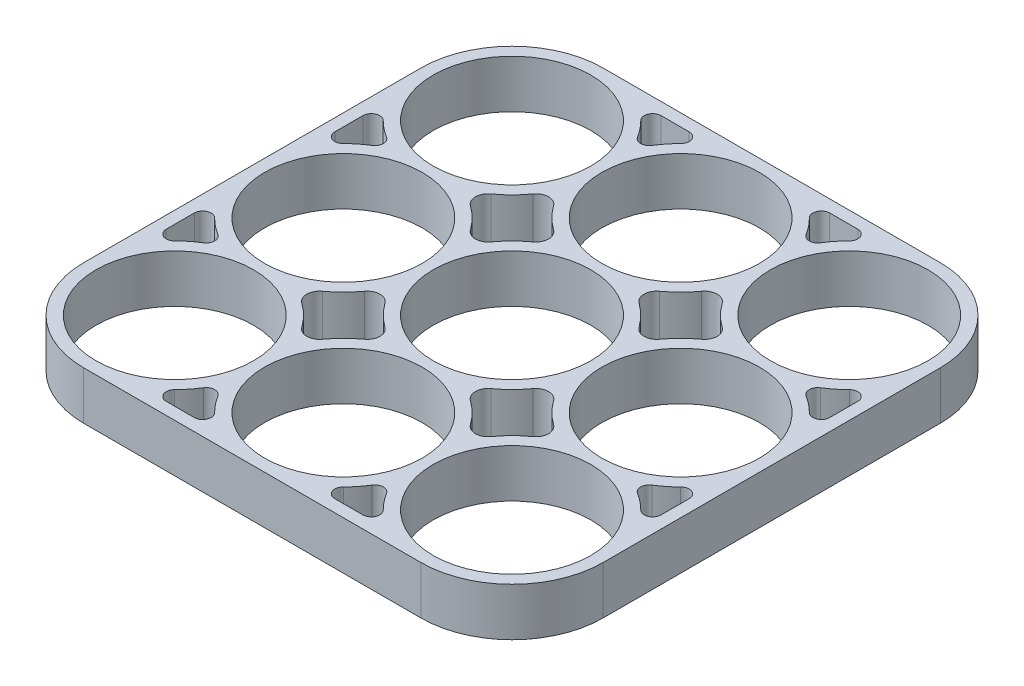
ISO-10303-21;
HEADER;
FILE_DESCRIPTION(('STEP AP214'),'2;1');
FILE_NAME('part.step','',(''),(''),'','','');
FILE_SCHEMA(('AUTOMOTIVE_DESIGN { 1 0 10303 214 1 1 1 1 }'));
ENDSEC;
DATA;
#1=APPLICATION_CONTEXT('core data for automotive mechanical design processes');
#2=APPLICATION_PROTOCOL_DEFINITION('international standard','automotive_design',2000,#1);
#3=PRODUCT_CONTEXT('',#1,'mechanical');
#4=PRODUCT('Part','Part','',(#3));
#5=PRODUCT_RELATED_PRODUCT_CATEGORY('part','',(#4));
#6=PRODUCT_DEFINITION_FORMATION('','',#4);
#7=PRODUCT_DEFINITION_CONTEXT('part definition',#1,'design');
#8=PRODUCT_DEFINITION('design','',#6,#7);
#9=PRODUCT_DEFINITION_SHAPE('','',#8);
#10=(LENGTH_UNIT() NAMED_UNIT(*) SI_UNIT(.MILLI.,.METRE.));
#11=(NAMED_UNIT(*) PLANE_ANGLE_UNIT() SI_UNIT($,.RADIAN.));
#12=(NAMED_UNIT(*) SI_UNIT($,.STERADIAN.) SOLID_ANGLE_UNIT());
#13=UNCERTAINTY_MEASURE_WITH_UNIT(LENGTH_MEASURE(1.E-05),#10,'distance_accuracy_value','');
#14=(GEOMETRIC_REPRESENTATION_CONTEXT(3) GLOBAL_UNCERTAINTY_ASSIGNED_CONTEXT((#13)) GLOBAL_UNIT_ASSIGNED_CONTEXT((#10,
#11,#12)) REPRESENTATION_CONTEXT('',''));
#15=CARTESIAN_POINT('',(0.,0.,0.));
#16=DIRECTION('',(0.,0.,1.));
#17=DIRECTION('',(1.,0.,0.));
#18=AXIS2_PLACEMENT_3D('',#15,#16,#17);
#19=CARTESIAN_POINT('',(-29.35,5.7,0.));
#20=DIRECTION('',(1.,0.,0.));
#21=DIRECTION('',(0.,0.,-1.));
#22=AXIS2_PLACEMENT_3D('',#19,#20,#21);
#23=PLANE('',#22);
#24=DIRECTION('',(0.,0.,1.));
#25=VECTOR('',#24,1.);
#26=CARTESIAN_POINT('',(-29.35,0.,0.));
#27=LINE('',#26,#25);
#28=CARTESIAN_POINT('',(-29.35,0.,-11.662284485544));
#29=VERTEX_POINT('',#28);
#30=CARTESIAN_POINT('',(-29.35,0.,-8.33771551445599));
#31=VERTEX_POINT('',#30);
#32=EDGE_CURVE('E897',#29,#31,#27,.T.);
#33=ORIENTED_EDGE('',*,*,#32,.F.);
#34=DIRECTION('',(0.,-1.,0.));
#35=VECTOR('',#34,1.);
#36=CARTESIAN_POINT('',(-29.35,5.7,-11.662284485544));
#37=LINE('',#36,#35);
#38=CARTESIAN_POINT('',(-29.35,5.7,-11.662284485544));
#39=VERTEX_POINT('',#38);
#40=EDGE_CURVE('E11',#39,#29,#37,.T.);
#41=ORIENTED_EDGE('',*,*,#40,.F.);
#42=DIRECTION('',(0.,0.,1.));
#43=VECTOR('',#42,1.);
#44=CARTESIAN_POINT('',(-29.35,5.7,0.));
#45=LINE('',#44,#43);
#46=CARTESIAN_POINT('',(-29.35,5.7,-8.33771551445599));
#47=VERTEX_POINT('',#46);
#48=EDGE_CURVE('E1377',#39,#47,#45,.T.);
#49=ORIENTED_EDGE('',*,*,#48,.T.);
#50=DIRECTION('',(0.,-1.,0.));
#51=VECTOR('',#50,1.);
#52=CARTESIAN_POINT('',(-29.35,5.7,-8.33771551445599));
#53=LINE('',#52,#51);
#54=EDGE_CURVE('E336',#47,#31,#53,.T.);
#55=ORIENTED_EDGE('',*,*,#54,.T.);
#56=EDGE_LOOP('',(#33,#41,#49,#55));
#57=FACE_BOUND('',#56,.T.);
#58=ADVANCED_FACE('F42',(#57),#23,.T.);
#59=CARTESIAN_POINT('',(-28.35,5.7,-11.662284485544));
#60=DIRECTION('',(0.,-1.,0.));
#61=DIRECTION('',(0.,0.,-1.));
#62=AXIS2_PLACEMENT_3D('',#59,#60,#61);
#63=CYLINDRICAL_SURFACE('',#62,1.);
#64=CARTESIAN_POINT('',(-28.35,0.,-11.662284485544));
#65=DIRECTION('',(0.,1.,0.));
#66=DIRECTION('',(0.,0.,1.));
#67=AXIS2_PLACEMENT_3D('',#64,#65,#66);
#68=CIRCLE('',#67,1.);
#69=CARTESIAN_POINT('',(-27.6423728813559,0.,-12.3688705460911));
#70=VERTEX_POINT('',#69);
#71=EDGE_CURVE('E899',#29,#70,#68,.F.);
#72=ORIENTED_EDGE('',*,*,#71,.T.);
#73=DIRECTION('',(0.,-1.,0.));
#74=VECTOR('',#73,1.);
#75=CARTESIAN_POINT('',(-27.6423728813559,5.7,-12.3688705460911));
#76=LINE('',#75,#74);
#77=CARTESIAN_POINT('',(-27.6423728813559,5.7,-12.3688705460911));
#78=VERTEX_POINT('',#77);
#79=EDGE_CURVE('E52',#78,#70,#76,.T.);
#80=ORIENTED_EDGE('',*,*,#79,.F.);
#81=CARTESIAN_POINT('',(-28.35,5.7,-11.662284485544));
#82=DIRECTION('',(0.,1.,0.));
#83=DIRECTION('',(0.,0.,1.));
#84=AXIS2_PLACEMENT_3D('',#81,#82,#83);
#85=CIRCLE('',#84,1.);
#86=EDGE_CURVE('E620',#39,#78,#85,.F.);
#87=ORIENTED_EDGE('',*,*,#86,.F.);
#88=ORIENTED_EDGE('',*,*,#40,.T.);
#89=EDGE_LOOP('',(#72,#80,#87,#88));
#90=FACE_BOUND('',#89,.T.);
#91=ADVANCED_FACE('F1381',(#90),#63,.F.);
#92=CARTESIAN_POINT('',(-20.,5.7,-20.));
#93=DIRECTION('',(0.,-1.,0.));
#94=DIRECTION('',(0.,0.,-1.));
#95=AXIS2_PLACEMENT_3D('',#92,#93,#94);
#96=CYLINDRICAL_SURFACE('',#95,10.8);
#97=CARTESIAN_POINT('',(-20.,0.,-20.));
#98=DIRECTION('',(0.,1.,0.));
#99=DIRECTION('',(0.,0.,1.));
#100=AXIS2_PLACEMENT_3D('',#97,#98,#99);
#101=CIRCLE('',#100,10.8);
#102=CARTESIAN_POINT('',(-25.7333208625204,0.,-10.8474576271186));
#103=VERTEX_POINT('',#102);
#104=EDGE_CURVE('E902',#70,#103,#101,.T.);
#105=ORIENTED_EDGE('',*,*,#104,.T.);
#106=DIRECTION('',(0.,-1.,0.));
#107=VECTOR('',#106,1.);
#108=CARTESIAN_POINT('',(-25.7333208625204,5.7,-10.8474576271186));
#109=LINE('',#108,#107);
#110=CARTESIAN_POINT('',(-25.7333208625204,5.7,-10.8474576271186));
#111=VERTEX_POINT('',#110);
#112=EDGE_CURVE('E608',#111,#103,#109,.T.);
#113=ORIENTED_EDGE('',*,*,#112,.F.);
#114=CARTESIAN_POINT('',(-20.,5.7,-20.));
#115=DIRECTION('',(0.,1.,0.));
#116=DIRECTION('',(0.,0.,1.));
#117=AXIS2_PLACEMENT_3D('',#114,#115,#116);
#118=CIRCLE('',#117,10.8);
#119=EDGE_CURVE('E617',#78,#111,#118,.T.);
#120=ORIENTED_EDGE('',*,*,#119,.F.);
#121=ORIENTED_EDGE('',*,*,#79,.T.);
#122=EDGE_LOOP('',(#105,#113,#120,#121));
#123=FACE_BOUND('',#122,.T.);
#124=ADVANCED_FACE('F1384',(#123),#96,.T.);
#125=CARTESIAN_POINT('',(-26.2641839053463,5.7,-9.99999999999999));
#126=DIRECTION('',(0.,-1.,0.));
#127=DIRECTION('',(0.,0.,-1.));
#128=AXIS2_PLACEMENT_3D('',#125,#126,#127);
#129=CYLINDRICAL_SURFACE('',#128,1.);
#130=CARTESIAN_POINT('',(-26.2641839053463,0.,-9.99999999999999));
#131=DIRECTION('',(0.,1.,0.));
#132=DIRECTION('',(0.,0.,1.));
#133=AXIS2_PLACEMENT_3D('',#130,#131,#132);
#134=CIRCLE('',#133,1.);
#135=CARTESIAN_POINT('',(-25.7333208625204,0.,-9.15254237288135));
#136=VERTEX_POINT('',#135);
#137=EDGE_CURVE('E605',#136,#103,#134,.T.);
#138=ORIENTED_EDGE('',*,*,#137,.F.);
#139=DIRECTION('',(0.,-1.,0.));
#140=VECTOR('',#139,1.);
#141=CARTESIAN_POINT('',(-25.7333208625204,5.7,-9.15254237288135));
#142=LINE('',#141,#140);
#143=CARTESIAN_POINT('',(-25.7333208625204,5.7,-9.15254237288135));
#144=VERTEX_POINT('',#143);
#145=EDGE_CURVE('E599',#144,#136,#142,.T.);
#146=ORIENTED_EDGE('',*,*,#145,.F.);
#147=CARTESIAN_POINT('',(-26.2641839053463,5.7,-9.99999999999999));
#148=DIRECTION('',(0.,1.,0.));
#149=DIRECTION('',(0.,0.,1.));
#150=AXIS2_PLACEMENT_3D('',#147,#148,#149);
#151=CIRCLE('',#150,1.);
#152=EDGE_CURVE('E603',#144,#111,#151,.T.);
#153=ORIENTED_EDGE('',*,*,#152,.T.);
#154=ORIENTED_EDGE('',*,*,#112,.T.);
#155=EDGE_LOOP('',(#138,#146,#153,#154));
#156=FACE_BOUND('',#155,.T.);
#157=ADVANCED_FACE('F601',(#156),#129,.F.);
#158=CARTESIAN_POINT('',(-20.,5.7,0.));
#159=DIRECTION('',(0.,-1.,0.));
#160=DIRECTION('',(0.,0.,-1.));
#161=AXIS2_PLACEMENT_3D('',#158,#159,#160);
#162=CYLINDRICAL_SURFACE('',#161,10.8);
#163=CARTESIAN_POINT('',(-20.,0.,0.));
#164=DIRECTION('',(0.,1.,0.));
#165=DIRECTION('',(0.,0.,1.));
#166=AXIS2_PLACEMENT_3D('',#163,#164,#165);
#167=CIRCLE('',#166,10.8);
#168=CARTESIAN_POINT('',(-27.6423728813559,0.,-7.63112945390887));
#169=VERTEX_POINT('',#168);
#170=EDGE_CURVE('E906',#136,#169,#167,.T.);
#171=ORIENTED_EDGE('',*,*,#170,.T.);
#172=DIRECTION('',(0.,-1.,0.));
#173=VECTOR('',#172,1.);
#174=CARTESIAN_POINT('',(-27.6423728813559,5.7,-7.63112945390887));
#175=LINE('',#174,#173);
#176=CARTESIAN_POINT('',(-27.6423728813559,5.7,-7.63112945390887));
#177=VERTEX_POINT('',#176);
#178=EDGE_CURVE('E609',#177,#169,#175,.T.);
#179=ORIENTED_EDGE('',*,*,#178,.F.);
#180=CARTESIAN_POINT('',(-20.,5.7,0.));
#181=DIRECTION('',(0.,1.,0.));
#182=DIRECTION('',(0.,0.,1.));
#183=AXIS2_PLACEMENT_3D('',#180,#181,#182);
#184=CIRCLE('',#183,10.8);
#185=EDGE_CURVE('E612',#144,#177,#184,.T.);
#186=ORIENTED_EDGE('',*,*,#185,.F.);
#187=ORIENTED_EDGE('',*,*,#145,.T.);
#188=EDGE_LOOP('',(#171,#179,#186,#187));
#189=FACE_BOUND('',#188,.T.);
#190=ADVANCED_FACE('F613',(#189),#162,.T.);
#191=CARTESIAN_POINT('',(20.,5.7,20.));
#192=DIRECTION('',(0.,-1.,0.));
#193=DIRECTION('',(0.,0.,-1.));
#194=AXIS2_PLACEMENT_3D('',#191,#192,#193);
#195=CYLINDRICAL_SURFACE('',#194,10.8);
#196=CARTESIAN_POINT('',(20.,0.,20.));
#197=DIRECTION('',(0.,1.,0.));
#198=DIRECTION('',(0.,0.,1.));
#199=AXIS2_PLACEMENT_3D('',#196,#197,#198);
#200=CIRCLE('',#199,10.8);
#201=CARTESIAN_POINT('',(27.6423728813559,0.,12.3688705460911));
#202=VERTEX_POINT('',#201);
#203=CARTESIAN_POINT('',(25.7333208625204,0.,10.8474576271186));
#204=VERTEX_POINT('',#203);
#205=EDGE_CURVE('E880',#202,#204,#200,.T.);
#206=ORIENTED_EDGE('',*,*,#205,.T.);
#207=DIRECTION('',(0.,-1.,0.));
#208=VECTOR('',#207,1.);
#209=CARTESIAN_POINT('',(25.7333208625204,5.7,10.8474576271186));
#210=LINE('',#209,#208);
#211=CARTESIAN_POINT('',(25.7333208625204,5.7,10.8474576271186));
#212=VERTEX_POINT('',#211);
#213=EDGE_CURVE('E911',#212,#204,#210,.T.);
#214=ORIENTED_EDGE('',*,*,#213,.F.);
#215=CARTESIAN_POINT('',(20.,5.7,20.));
#216=DIRECTION('',(0.,1.,0.));
#217=DIRECTION('',(0.,0.,1.));
#218=AXIS2_PLACEMENT_3D('',#215,#216,#217);
#219=CIRCLE('',#218,10.8);
#220=CARTESIAN_POINT('',(27.6423728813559,5.7,12.3688705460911));
#221=VERTEX_POINT('',#220);
#222=EDGE_CURVE('E1361',#221,#212,#219,.T.);
#223=ORIENTED_EDGE('',*,*,#222,.F.);
#224=DIRECTION('',(0.,-1.,0.));
#225=VECTOR('',#224,1.);
#226=CARTESIAN_POINT('',(27.6423728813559,5.7,12.3688705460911));
#227=LINE('',#226,#225);
#228=EDGE_CURVE('E916',#221,#202,#227,.T.);
#229=ORIENTED_EDGE('',*,*,#228,.T.);
#230=EDGE_LOOP('',(#206,#214,#223,#229));
#231=FACE_BOUND('',#230,.T.);
#232=ADVANCED_FACE('F1424',(#231),#195,.T.);
#233=CARTESIAN_POINT('',(26.2641839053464,5.7,10.));
#234=DIRECTION('',(0.,-1.,0.));
#235=DIRECTION('',(0.,0.,-1.));
#236=AXIS2_PLACEMENT_3D('',#233,#234,#235);
#237=CYLINDRICAL_SURFACE('',#236,1.);
#238=CARTESIAN_POINT('',(26.2641839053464,0.,10.));
#239=DIRECTION('',(0.,1.,0.));
#240=DIRECTION('',(0.,0.,1.));
#241=AXIS2_PLACEMENT_3D('',#238,#239,#240);
#242=CIRCLE('',#241,1.);
#243=CARTESIAN_POINT('',(25.7333208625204,0.,9.15254237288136));
#244=VERTEX_POINT('',#243);
#245=EDGE_CURVE('E883',#204,#244,#242,.F.);
#246=ORIENTED_EDGE('',*,*,#245,.T.);
#247=DIRECTION('',(0.,-1.,0.));
#248=VECTOR('',#247,1.);
#249=CARTESIAN_POINT('',(25.7333208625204,5.7,9.15254237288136));
#250=LINE('',#249,#248);
#251=CARTESIAN_POINT('',(25.7333208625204,5.7,9.15254237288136));
#252=VERTEX_POINT('',#251);
#253=EDGE_CURVE('E925',#252,#244,#250,.T.);
#254=ORIENTED_EDGE('',*,*,#253,.F.);
#255=CARTESIAN_POINT('',(26.2641839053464,5.7,10.));
#256=DIRECTION('',(0.,1.,0.));
#257=DIRECTION('',(0.,0.,1.));
#258=AXIS2_PLACEMENT_3D('',#255,#256,#257);
#259=CIRCLE('',#258,1.);
#260=EDGE_CURVE('E1364',#212,#252,#259,.F.);
#261=ORIENTED_EDGE('',*,*,#260,.F.);
#262=ORIENTED_EDGE('',*,*,#213,.T.);
#263=EDGE_LOOP('',(#246,#254,#261,#262));
#264=FACE_BOUND('',#263,.T.);
#265=ADVANCED_FACE('F1420',(#264),#237,.F.);
#266=CARTESIAN_POINT('',(20.,5.7,0.));
#267=DIRECTION('',(0.,-1.,0.));
#268=DIRECTION('',(0.,0.,-1.));
#269=AXIS2_PLACEMENT_3D('',#266,#267,#268);
#270=CYLINDRICAL_SURFACE('',#269,10.8);
#271=CARTESIAN_POINT('',(20.,0.,0.));
#272=DIRECTION('',(0.,1.,0.));
#273=DIRECTION('',(0.,0.,1.));
#274=AXIS2_PLACEMENT_3D('',#271,#272,#273);
#275=CIRCLE('',#274,10.8);
#276=CARTESIAN_POINT('',(27.6423728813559,0.,7.63112945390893));
#277=VERTEX_POINT('',#276);
#278=EDGE_CURVE('E885',#244,#277,#275,.T.);
#279=ORIENTED_EDGE('',*,*,#278,.T.);
#280=DIRECTION('',(0.,-1.,0.));
#281=VECTOR('',#280,1.);
#282=CARTESIAN_POINT('',(27.6423728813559,5.7,7.63112945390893));
#283=LINE('',#282,#281);
#284=CARTESIAN_POINT('',(27.6423728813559,5.7,7.63112945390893));
#285=VERTEX_POINT('',#284);
#286=EDGE_CURVE('E923',#285,#277,#283,.T.);
#287=ORIENTED_EDGE('',*,*,#286,.F.);
#288=CARTESIAN_POINT('',(20.,5.7,0.));
#289=DIRECTION('',(0.,1.,0.));
#290=DIRECTION('',(0.,0.,1.));
#291=AXIS2_PLACEMENT_3D('',#288,#289,#290);
#292=CIRCLE('',#291,10.8);
#293=EDGE_CURVE('E1366',#252,#285,#292,.T.);
#294=ORIENTED_EDGE('',*,*,#293,.F.);
#295=ORIENTED_EDGE('',*,*,#253,.T.);
#296=EDGE_LOOP('',(#279,#287,#294,#295));
#297=FACE_BOUND('',#296,.T.);
#298=ADVANCED_FACE('F1416',(#297),#270,.T.);
#299=CARTESIAN_POINT('',(28.35,5.7,8.33771551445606));
#300=DIRECTION('',(0.,-1.,0.));
#301=DIRECTION('',(0.,0.,-1.));
#302=AXIS2_PLACEMENT_3D('',#299,#300,#301);
#303=CYLINDRICAL_SURFACE('',#302,1.);
#304=CARTESIAN_POINT('',(28.35,0.,8.33771551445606));
#305=DIRECTION('',(0.,1.,0.));
#306=DIRECTION('',(0.,0.,1.));
#307=AXIS2_PLACEMENT_3D('',#304,#305,#306);
#308=CIRCLE('',#307,1.);
#309=CARTESIAN_POINT('',(29.35,0.,8.33771551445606));
#310=VERTEX_POINT('',#309);
#311=EDGE_CURVE('E888',#310,#277,#308,.T.);
#312=ORIENTED_EDGE('',*,*,#311,.F.);
#313=DIRECTION('',(0.,-1.,0.));
#314=VECTOR('',#313,1.);
#315=CARTESIAN_POINT('',(29.35,5.7,8.33771551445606));
#316=LINE('',#315,#314);
#317=CARTESIAN_POINT('',(29.35,5.7,8.33771551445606));
#318=VERTEX_POINT('',#317);
#319=EDGE_CURVE('E921',#318,#310,#316,.T.);
#320=ORIENTED_EDGE('',*,*,#319,.F.);
#321=CARTESIAN_POINT('',(28.35,5.7,8.33771551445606));
#322=DIRECTION('',(0.,1.,0.));
#323=DIRECTION('',(0.,0.,1.));
#324=AXIS2_PLACEMENT_3D('',#321,#322,#323);
#325=CIRCLE('',#324,1.);
#326=EDGE_CURVE('E1368',#318,#285,#325,.T.);
#327=ORIENTED_EDGE('',*,*,#326,.T.);
#328=ORIENTED_EDGE('',*,*,#286,.T.);
#329=EDGE_LOOP('',(#312,#320,#327,#328));
#330=FACE_BOUND('',#329,.T.);
#331=ADVANCED_FACE('F1412',(#330),#303,.F.);
#332=CARTESIAN_POINT('',(29.35,5.7,0.));
#333=DIRECTION('',(-1.,0.,0.));
#334=DIRECTION('',(0.,0.,1.));
#335=AXIS2_PLACEMENT_3D('',#332,#333,#334);
#336=PLANE('',#335);
#337=DIRECTION('',(0.,0.,-1.));
#338=VECTOR('',#337,1.);
#339=CARTESIAN_POINT('',(29.35,0.,0.));
#340=LINE('',#339,#338);
#341=CARTESIAN_POINT('',(29.35,0.,11.6622844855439));
#342=VERTEX_POINT('',#341);
#343=EDGE_CURVE('E891',#342,#310,#340,.T.);
#344=ORIENTED_EDGE('',*,*,#343,.F.);
#345=DIRECTION('',(0.,-1.,0.));
#346=VECTOR('',#345,1.);
#347=CARTESIAN_POINT('',(29.35,5.7,11.6622844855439));
#348=LINE('',#347,#346);
#349=CARTESIAN_POINT('',(29.35,5.7,11.6622844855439));
#350=VERTEX_POINT('',#349);
#351=EDGE_CURVE('E918',#350,#342,#348,.T.);
#352=ORIENTED_EDGE('',*,*,#351,.F.);
#353=DIRECTION('',(0.,0.,-1.));
#354=VECTOR('',#353,1.);
#355=CARTESIAN_POINT('',(29.35,5.7,0.));
#356=LINE('',#355,#354);
#357=EDGE_CURVE('E1371',#350,#318,#356,.T.);
#358=ORIENTED_EDGE('',*,*,#357,.T.);
#359=ORIENTED_EDGE('',*,*,#319,.T.);
#360=EDGE_LOOP('',(#344,#352,#358,#359));
#361=FACE_BOUND('',#360,.T.);
#362=ADVANCED_FACE('F1408',(#361),#336,.T.);
#363=CARTESIAN_POINT('',(0.,5.7,-20.));
#364=DIRECTION('',(0.,-1.,0.));
#365=DIRECTION('',(0.,0.,-1.));
#366=AXIS2_PLACEMENT_3D('',#363,#364,#365);
#367=CYLINDRICAL_SURFACE('',#366,10.8);
#368=CARTESIAN_POINT('',(0.,0.,-20.));
#369=DIRECTION('',(0.,1.,0.));
#370=DIRECTION('',(0.,0.,1.));
#371=AXIS2_PLACEMENT_3D('',#368,#369,#370);
#372=CIRCLE('',#371,10.8);
#373=CARTESIAN_POINT('',(-7.63112945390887,0.,-27.6423728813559));
#374=VERTEX_POINT('',#373);
#375=CARTESIAN_POINT('',(-9.15254237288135,0.,-25.7333208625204));
#376=VERTEX_POINT('',#375);
#377=EDGE_CURVE('E863',#374,#376,#372,.T.);
#378=ORIENTED_EDGE('',*,*,#377,.T.);
#379=DIRECTION('',(0.,-1.,0.));
#380=VECTOR('',#379,1.);
#381=CARTESIAN_POINT('',(-9.15254237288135,5.7,-25.7333208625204));
#382=LINE('',#381,#380);
#383=CARTESIAN_POINT('',(-9.15254237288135,5.7,-25.7333208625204));
#384=VERTEX_POINT('',#383);
#385=EDGE_CURVE('E919',#384,#376,#382,.T.);
#386=ORIENTED_EDGE('',*,*,#385,.F.);
#387=CARTESIAN_POINT('',(0.,5.7,-20.));
#388=DIRECTION('',(0.,1.,0.));
#389=DIRECTION('',(0.,0.,1.));
#390=AXIS2_PLACEMENT_3D('',#387,#388,#389);
#391=CIRCLE('',#390,10.8);
#392=CARTESIAN_POINT('',(-7.63112945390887,5.7,-27.6423728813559));
#393=VERTEX_POINT('',#392);
#394=EDGE_CURVE('E1346',#393,#384,#391,.T.);
#395=ORIENTED_EDGE('',*,*,#394,.F.);
#396=DIRECTION('',(0.,-1.,0.));
#397=VECTOR('',#396,1.);
#398=CARTESIAN_POINT('',(-7.63112945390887,5.7,-27.6423728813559));
#399=LINE('',#398,#397);
#400=EDGE_CURVE('E930',#393,#374,#399,.T.);
#401=ORIENTED_EDGE('',*,*,#400,.T.);
#402=EDGE_LOOP('',(#378,#386,#395,#401));
#403=FACE_BOUND('',#402,.T.);
#404=ADVANCED_FACE('F1411',(#403),#367,.T.);
#405=CARTESIAN_POINT('',(-10.,5.7,-26.2641839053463));
#406=DIRECTION('',(0.,-1.,0.));
#407=DIRECTION('',(0.,0.,-1.));
#408=AXIS2_PLACEMENT_3D('',#405,#406,#407);
#409=CYLINDRICAL_SURFACE('',#408,1.);
#410=CARTESIAN_POINT('',(-10.,0.,-26.2641839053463));
#411=DIRECTION('',(0.,1.,0.));
#412=DIRECTION('',(0.,0.,1.));
#413=AXIS2_PLACEMENT_3D('',#410,#411,#412);
#414=CIRCLE('',#413,1.);
#415=CARTESIAN_POINT('',(-10.8474576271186,0.,-25.7333208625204));
#416=VERTEX_POINT('',#415);
#417=EDGE_CURVE('E866',#376,#416,#414,.F.);
#418=ORIENTED_EDGE('',*,*,#417,.T.);
#419=DIRECTION('',(0.,-1.,0.));
#420=VECTOR('',#419,1.);
#421=CARTESIAN_POINT('',(-10.8474576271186,5.7,-25.7333208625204));
#422=LINE('',#421,#420);
#423=CARTESIAN_POINT('',(-10.8474576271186,5.7,-25.7333208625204));
#424=VERTEX_POINT('',#423);
#425=EDGE_CURVE('E939',#424,#416,#422,.T.);
#426=ORIENTED_EDGE('',*,*,#425,.F.);
#427=CARTESIAN_POINT('',(-10.,5.7,-26.2641839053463));
#428=DIRECTION('',(0.,1.,0.));
#429=DIRECTION('',(0.,0.,1.));
#430=AXIS2_PLACEMENT_3D('',#427,#428,#429);
#431=CIRCLE('',#430,1.);
#432=EDGE_CURVE('E1349',#384,#424,#431,.F.);
#433=ORIENTED_EDGE('',*,*,#432,.F.);
#434=ORIENTED_EDGE('',*,*,#385,.T.);
#435=EDGE_LOOP('',(#418,#426,#433,#434));
#436=FACE_BOUND('',#435,.T.);
#437=ADVANCED_FACE('F1445',(#436),#409,.F.);
#438=CARTESIAN_POINT('',(-20.,5.7,-20.));
#439=DIRECTION('',(0.,-1.,0.));
#440=DIRECTION('',(0.,0.,-1.));
#441=AXIS2_PLACEMENT_3D('',#438,#439,#440);
#442=CYLINDRICAL_SURFACE('',#441,10.8);
#443=CARTESIAN_POINT('',(-20.,0.,-20.));
#444=DIRECTION('',(0.,1.,0.));
#445=DIRECTION('',(0.,0.,1.));
#446=AXIS2_PLACEMENT_3D('',#443,#444,#445);
#447=CIRCLE('',#446,10.8);
#448=CARTESIAN_POINT('',(-12.3688705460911,0.,-27.6423728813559));
#449=VERTEX_POINT('',#448);
#450=EDGE_CURVE('E868',#416,#449,#447,.T.);
#451=ORIENTED_EDGE('',*,*,#450,.T.);
#452=DIRECTION('',(0.,-1.,0.));
#453=VECTOR('',#452,1.);
#454=CARTESIAN_POINT('',(-12.3688705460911,5.7,-27.6423728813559));
#455=LINE('',#454,#453);
#456=CARTESIAN_POINT('',(-12.3688705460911,5.7,-27.6423728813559));
#457=VERTEX_POINT('',#456);
#458=EDGE_CURVE('E937',#457,#449,#455,.T.);
#459=ORIENTED_EDGE('',*,*,#458,.F.);
#460=CARTESIAN_POINT('',(-20.,5.7,-20.));
#461=DIRECTION('',(0.,1.,0.));
#462=DIRECTION('',(0.,0.,1.));
#463=AXIS2_PLACEMENT_3D('',#460,#461,#462);
#464=CIRCLE('',#463,10.8);
#465=EDGE_CURVE('E1351',#424,#457,#464,.T.);
#466=ORIENTED_EDGE('',*,*,#465,.F.);
#467=ORIENTED_EDGE('',*,*,#425,.T.);
#468=EDGE_LOOP('',(#451,#459,#466,#467));
#469=FACE_BOUND('',#468,.T.);
#470=ADVANCED_FACE('F1441',(#469),#442,.T.);
#471=CARTESIAN_POINT('',(-11.662284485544,5.7,-28.35));
#472=DIRECTION('',(0.,-1.,0.));
#473=DIRECTION('',(0.,0.,-1.));
#474=AXIS2_PLACEMENT_3D('',#471,#472,#473);
#475=CYLINDRICAL_SURFACE('',#474,0.999999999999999);
#476=CARTESIAN_POINT('',(-11.662284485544,0.,-28.35));
#477=DIRECTION('',(0.,1.,0.));
#478=DIRECTION('',(0.,0.,1.));
#479=AXIS2_PLACEMENT_3D('',#476,#477,#478);
#480=CIRCLE('',#479,0.999999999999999);
#481=CARTESIAN_POINT('',(-11.662284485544,0.,-29.35));
#482=VERTEX_POINT('',#481);
#483=EDGE_CURVE('E871',#482,#449,#480,.T.);
#484=ORIENTED_EDGE('',*,*,#483,.F.);
#485=DIRECTION('',(0.,-1.,0.));
#486=VECTOR('',#485,1.);
#487=CARTESIAN_POINT('',(-11.662284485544,5.7,-29.35));
#488=LINE('',#487,#486);
#489=CARTESIAN_POINT('',(-11.662284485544,5.7,-29.35));
#490=VERTEX_POINT('',#489);
#491=EDGE_CURVE('E935',#490,#482,#488,.T.);
#492=ORIENTED_EDGE('',*,*,#491,.F.);
#493=CARTESIAN_POINT('',(-11.662284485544,5.7,-28.35));
#494=DIRECTION('',(0.,1.,0.));
#495=DIRECTION('',(0.,0.,1.));
#496=AXIS2_PLACEMENT_3D('',#493,#494,#495);
#497=CIRCLE('',#496,0.999999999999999);
#498=EDGE_CURVE('E1353',#490,#457,#497,.T.);
#499=ORIENTED_EDGE('',*,*,#498,.T.);
#500=ORIENTED_EDGE('',*,*,#458,.T.);
#501=EDGE_LOOP('',(#484,#492,#499,#500));
#502=FACE_BOUND('',#501,.T.);
#503=ADVANCED_FACE('F1437',(#502),#475,.F.);
#504=CARTESIAN_POINT('',(0.,5.7,-29.35));
#505=DIRECTION('',(0.,0.,-1.));
#506=DIRECTION('',(-1.,0.,0.));
#507=AXIS2_PLACEMENT_3D('',#504,#505,#506);
#508=PLANE('',#507);
#509=DIRECTION('',(1.,0.,0.));
#510=VECTOR('',#509,1.);
#511=CARTESIAN_POINT('',(0.,0.,-29.35));
#512=LINE('',#511,#510);
#513=CARTESIAN_POINT('',(-8.33771551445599,0.,-29.35));
#514=VERTEX_POINT('',#513);
#515=EDGE_CURVE('E874',#482,#514,#512,.T.);
#516=ORIENTED_EDGE('',*,*,#515,.T.);
#517=DIRECTION('',(0.,-1.,0.));
#518=VECTOR('',#517,1.);
#519=CARTESIAN_POINT('',(-8.33771551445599,5.7,-29.35));
#520=LINE('',#519,#518);
#521=CARTESIAN_POINT('',(-8.33771551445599,5.7,-29.35));
#522=VERTEX_POINT('',#521);
#523=EDGE_CURVE('E932',#522,#514,#520,.T.);
#524=ORIENTED_EDGE('',*,*,#523,.F.);
#525=DIRECTION('',(1.,0.,0.));
#526=VECTOR('',#525,1.);
#527=CARTESIAN_POINT('',(0.,5.7,-29.35));
#528=LINE('',#527,#526);
#529=EDGE_CURVE('E1356',#490,#522,#528,.T.);
#530=ORIENTED_EDGE('',*,*,#529,.F.);
#531=ORIENTED_EDGE('',*,*,#491,.T.);
#532=EDGE_LOOP('',(#516,#524,#530,#531));
#533=FACE_BOUND('',#532,.T.);
#534=ADVANCED_FACE('F1433',(#533),#508,.F.);
#535=CARTESIAN_POINT('',(30.8,5.7,0.));
#536=DIRECTION('',(1.,0.,0.));
#537=DIRECTION('',(0.,0.,-1.));
#538=AXIS2_PLACEMENT_3D('',#535,#536,#537);
#539=PLANE('',#538);
#540=DIRECTION('',(0.,0.,1.));
#541=VECTOR('',#540,1.);
#542=CARTESIAN_POINT('',(30.8,0.,0.));
#543=LINE('',#542,#541);
#544=CARTESIAN_POINT('',(30.8,0.,-20.));
#545=VERTEX_POINT('',#544);
#546=CARTESIAN_POINT('',(30.8,0.,20.));
#547=VERTEX_POINT('',#546);
#548=EDGE_CURVE('E839',#545,#547,#543,.T.);
#549=ORIENTED_EDGE('',*,*,#548,.F.);
#550=DIRECTION('',(0.,-1.,0.));
#551=VECTOR('',#550,1.);
#552=CARTESIAN_POINT('',(30.8,5.7,-20.));
#553=LINE('',#552,#551);
#554=CARTESIAN_POINT('',(30.8,5.7,-20.));
#555=VERTEX_POINT('',#554);
#556=EDGE_CURVE('E933',#555,#545,#553,.T.);
#557=ORIENTED_EDGE('',*,*,#556,.F.);
#558=DIRECTION('',(0.,0.,1.));
#559=VECTOR('',#558,1.);
#560=CARTESIAN_POINT('',(30.8,5.7,0.));
#561=LINE('',#560,#559);
#562=CARTESIAN_POINT('',(30.8,5.7,20.));
#563=VERTEX_POINT('',#562);
#564=EDGE_CURVE('E1324',#555,#563,#561,.T.);
#565=ORIENTED_EDGE('',*,*,#564,.T.);
#566=DIRECTION('',(0.,-1.,0.));
#567=VECTOR('',#566,1.);
#568=CARTESIAN_POINT('',(30.8,5.7,20.));
#569=LINE('',#568,#567);
#570=EDGE_CURVE('E944',#563,#547,#569,.T.);
#571=ORIENTED_EDGE('',*,*,#570,.T.);
#572=EDGE_LOOP('',(#549,#557,#565,#571));
#573=FACE_BOUND('',#572,.T.);
#574=ADVANCED_FACE('F1436',(#573),#539,.T.);
#575=CARTESIAN_POINT('',(20.,5.7,-20.));
#576=DIRECTION('',(0.,-1.,0.));
#577=DIRECTION('',(0.,0.,-1.));
#578=AXIS2_PLACEMENT_3D('',#575,#576,#577);
#579=CYLINDRICAL_SURFACE('',#578,10.8);
#580=CARTESIAN_POINT('',(20.,0.,-20.));
#581=DIRECTION('',(0.,1.,0.));
#582=DIRECTION('',(0.,0.,1.));
#583=AXIS2_PLACEMENT_3D('',#580,#581,#582);
#584=CIRCLE('',#583,10.8);
#585=CARTESIAN_POINT('',(20.,0.,-30.8));
#586=VERTEX_POINT('',#585);
#587=EDGE_CURVE('E842',#545,#586,#584,.T.);
#588=ORIENTED_EDGE('',*,*,#587,.T.);
#589=DIRECTION('',(0.,-1.,0.));
#590=VECTOR('',#589,1.);
#591=CARTESIAN_POINT('',(20.,5.7,-30.8));
#592=LINE('',#591,#590);
#593=CARTESIAN_POINT('',(20.,5.7,-30.8));
#594=VERTEX_POINT('',#593);
#595=EDGE_CURVE('E961',#594,#586,#592,.T.);
#596=ORIENTED_EDGE('',*,*,#595,.F.);
#597=CARTESIAN_POINT('',(20.,5.7,-20.));
#598=DIRECTION('',(0.,1.,0.));
#599=DIRECTION('',(0.,0.,1.));
#600=AXIS2_PLACEMENT_3D('',#597,#598,#599);
#601=CIRCLE('',#600,10.8);
#602=EDGE_CURVE('E1327',#555,#594,#601,.T.);
#603=ORIENTED_EDGE('',*,*,#602,.F.);
#604=ORIENTED_EDGE('',*,*,#556,.T.);
#605=EDGE_LOOP('',(#588,#596,#603,#604));
#606=FACE_BOUND('',#605,.T.);
#607=ADVANCED_FACE('F1477',(#606),#579,.T.);
#608=CARTESIAN_POINT('',(0.,5.7,-30.8));
#609=DIRECTION('',(0.,0.,-1.));
#610=DIRECTION('',(-1.,0.,0.));
#611=AXIS2_PLACEMENT_3D('',#608,#609,#610);
#612=PLANE('',#611);
#613=DIRECTION('',(1.,0.,0.));
#614=VECTOR('',#613,1.);
#615=CARTESIAN_POINT('',(0.,0.,-30.8));
#616=LINE('',#615,#614);
#617=CARTESIAN_POINT('',(-20.,0.,-30.8));
#618=VERTEX_POINT('',#617);
#619=EDGE_CURVE('E845',#618,#586,#616,.T.);
#620=ORIENTED_EDGE('',*,*,#619,.F.);
#621=DIRECTION('',(0.,-1.,0.));
#622=VECTOR('',#621,1.);
#623=CARTESIAN_POINT('',(-20.,5.7,-30.8));
#624=LINE('',#623,#622);
#625=CARTESIAN_POINT('',(-20.,5.7,-30.8));
#626=VERTEX_POINT('',#625);
#627=EDGE_CURVE('E959',#626,#618,#624,.T.);
#628=ORIENTED_EDGE('',*,*,#627,.F.);
#629=DIRECTION('',(1.,0.,0.));
#630=VECTOR('',#629,1.);
#631=CARTESIAN_POINT('',(0.,5.7,-30.8));
#632=LINE('',#631,#630);
#633=EDGE_CURVE('E1329',#626,#594,#632,.T.);
#634=ORIENTED_EDGE('',*,*,#633,.T.);
#635=ORIENTED_EDGE('',*,*,#595,.T.);
#636=EDGE_LOOP('',(#620,#628,#634,#635));
#637=FACE_BOUND('',#636,.T.);
#638=ADVANCED_FACE('F1473',(#637),#612,.T.);
#639=CARTESIAN_POINT('',(-20.,5.7,-20.));
#640=DIRECTION('',(0.,-1.,0.));
#641=DIRECTION('',(0.,0.,-1.));
#642=AXIS2_PLACEMENT_3D('',#639,#640,#641);
#643=CYLINDRICAL_SURFACE('',#642,10.8);
#644=CARTESIAN_POINT('',(-20.,0.,-20.));
#645=DIRECTION('',(0.,1.,0.));
#646=DIRECTION('',(0.,0.,1.));
#647=AXIS2_PLACEMENT_3D('',#644,#645,#646);
#648=CIRCLE('',#647,10.8);
#649=CARTESIAN_POINT('',(-30.8,0.,-19.9999999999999));
#650=VERTEX_POINT('',#649);
#651=EDGE_CURVE('E848',#618,#650,#648,.T.);
#652=ORIENTED_EDGE('',*,*,#651,.T.);
#653=DIRECTION('',(0.,-1.,0.));
#654=VECTOR('',#653,1.);
#655=CARTESIAN_POINT('',(-30.8,5.7,-19.9999999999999));
#656=LINE('',#655,#654);
#657=CARTESIAN_POINT('',(-30.8,5.7,-19.9999999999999));
#658=VERTEX_POINT('',#657);
#659=EDGE_CURVE('E956',#658,#650,#656,.T.);
#660=ORIENTED_EDGE('',*,*,#659,.F.);
#661=CARTESIAN_POINT('',(-20.,5.7,-20.));
#662=DIRECTION('',(0.,1.,0.));
#663=DIRECTION('',(0.,0.,1.));
#664=AXIS2_PLACEMENT_3D('',#661,#662,#663);
#665=CIRCLE('',#664,10.8);
#666=EDGE_CURVE('E1332',#626,#658,#665,.T.);
#667=ORIENTED_EDGE('',*,*,#666,.F.);
#668=ORIENTED_EDGE('',*,*,#627,.T.);
#669=EDGE_LOOP('',(#652,#660,#667,#668));
#670=FACE_BOUND('',#669,.T.);
#671=ADVANCED_FACE('F1469',(#670),#643,.T.);
#672=CARTESIAN_POINT('',(-30.8,5.7,0.));
#673=DIRECTION('',(1.,0.,0.));
#674=DIRECTION('',(0.,0.,-1.));
#675=AXIS2_PLACEMENT_3D('',#672,#673,#674);
#676=PLANE('',#675);
#677=DIRECTION('',(0.,0.,1.));
#678=VECTOR('',#677,1.);
#679=CARTESIAN_POINT('',(-30.8,0.,0.));
#680=LINE('',#679,#678);
#681=CARTESIAN_POINT('',(-30.8,0.,20.0000000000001));
#682=VERTEX_POINT('',#681);
#683=EDGE_CURVE('E851',#650,#682,#680,.T.);
#684=ORIENTED_EDGE('',*,*,#683,.T.);
#685=DIRECTION('',(0.,-1.,0.));
#686=VECTOR('',#685,1.);
#687=CARTESIAN_POINT('',(-30.8,5.7,20.0000000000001));
#688=LINE('',#687,#686);
#689=CARTESIAN_POINT('',(-30.8,5.7,20.0000000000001));
#690=VERTEX_POINT('',#689);
#691=EDGE_CURVE('E953',#690,#682,#688,.T.);
#692=ORIENTED_EDGE('',*,*,#691,.F.);
#693=DIRECTION('',(0.,0.,1.));
#694=VECTOR('',#693,1.);
#695=CARTESIAN_POINT('',(-30.8,5.7,0.));
#696=LINE('',#695,#694);
#697=EDGE_CURVE('E1335',#658,#690,#696,.T.);
#698=ORIENTED_EDGE('',*,*,#697,.F.);
#699=ORIENTED_EDGE('',*,*,#659,.T.);
#700=EDGE_LOOP('',(#684,#692,#698,#699));
#701=FACE_BOUND('',#700,.T.);
#702=ADVANCED_FACE('F1465',(#701),#676,.F.);
#703=CARTESIAN_POINT('',(-20.,5.7,20.));
#704=DIRECTION('',(0.,-1.,0.));
#705=DIRECTION('',(0.,0.,-1.));
#706=AXIS2_PLACEMENT_3D('',#703,#704,#705);
#707=CYLINDRICAL_SURFACE('',#706,10.8);
#708=CARTESIAN_POINT('',(-20.,0.,20.));
#709=DIRECTION('',(0.,1.,0.));
#710=DIRECTION('',(0.,0.,1.));
#711=AXIS2_PLACEMENT_3D('',#708,#709,#710);
#712=CIRCLE('',#711,10.8);
#713=CARTESIAN_POINT('',(-19.9999999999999,0.,30.8));
#714=VERTEX_POINT('',#713);
#715=EDGE_CURVE('E854',#682,#714,#712,.T.);
#716=ORIENTED_EDGE('',*,*,#715,.T.);
#717=DIRECTION('',(0.,-1.,0.));
#718=VECTOR('',#717,1.);
#719=CARTESIAN_POINT('',(-19.9999999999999,5.7,30.8));
#720=LINE('',#719,#718);
#721=CARTESIAN_POINT('',(-19.9999999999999,5.7,30.8));
#722=VERTEX_POINT('',#721);
#723=EDGE_CURVE('E950',#722,#714,#720,.T.);
#724=ORIENTED_EDGE('',*,*,#723,.F.);
#725=CARTESIAN_POINT('',(-20.,5.7,20.));
#726=DIRECTION('',(0.,1.,0.));
#727=DIRECTION('',(0.,0.,1.));
#728=AXIS2_PLACEMENT_3D('',#725,#726,#727);
#729=CIRCLE('',#728,10.8);
#730=EDGE_CURVE('E1338',#690,#722,#729,.T.);
#731=ORIENTED_EDGE('',*,*,#730,.F.);
#732=ORIENTED_EDGE('',*,*,#691,.T.);
#733=EDGE_LOOP('',(#716,#724,#731,#732));
#734=FACE_BOUND('',#733,.T.);
#735=ADVANCED_FACE('F1461',(#734),#707,.T.);
#736=CARTESIAN_POINT('',(0.,5.7,30.8));
#737=DIRECTION('',(0.,0.,-1.));
#738=DIRECTION('',(-1.,0.,0.));
#739=AXIS2_PLACEMENT_3D('',#736,#737,#738);
#740=PLANE('',#739);
#741=DIRECTION('',(1.,0.,0.));
#742=VECTOR('',#741,1.);
#743=CARTESIAN_POINT('',(0.,0.,30.8));
#744=LINE('',#743,#742);
#745=CARTESIAN_POINT('',(20.0000000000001,0.,30.8));
#746=VERTEX_POINT('',#745);
#747=EDGE_CURVE('E857',#714,#746,#744,.T.);
#748=ORIENTED_EDGE('',*,*,#747,.T.);
#749=DIRECTION('',(0.,-1.,0.));
#750=VECTOR('',#749,1.);
#751=CARTESIAN_POINT('',(20.0000000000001,5.7,30.8));
#752=LINE('',#751,#750);
#753=CARTESIAN_POINT('',(20.0000000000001,5.7,30.8));
#754=VERTEX_POINT('',#753);
#755=EDGE_CURVE('E946',#754,#746,#752,.T.);
#756=ORIENTED_EDGE('',*,*,#755,.F.);
#757=DIRECTION('',(1.,0.,0.));
#758=VECTOR('',#757,1.);
#759=CARTESIAN_POINT('',(0.,5.7,30.8));
#760=LINE('',#759,#758);
#761=EDGE_CURVE('E1341',#722,#754,#760,.T.);
#762=ORIENTED_EDGE('',*,*,#761,.F.);
#763=ORIENTED_EDGE('',*,*,#723,.T.);
#764=EDGE_LOOP('',(#748,#756,#762,#763));
#765=FACE_BOUND('',#764,.T.);
#766=ADVANCED_FACE('F1457',(#765),#740,.F.);
#767=CARTESIAN_POINT('',(8.33771551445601,5.7,-28.35));
#768=DIRECTION('',(0.,-1.,0.));
#769=DIRECTION('',(0.,0.,-1.));
#770=AXIS2_PLACEMENT_3D('',#767,#768,#769);
#771=CYLINDRICAL_SURFACE('',#770,1.);
#772=CARTESIAN_POINT('',(8.33771551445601,0.,-28.35));
#773=DIRECTION('',(0.,1.,0.));
#774=DIRECTION('',(0.,0.,1.));
#775=AXIS2_PLACEMENT_3D('',#772,#773,#774);
#776=CIRCLE('',#775,1.);
#777=CARTESIAN_POINT('',(8.33771551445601,0.,-29.35));
#778=VERTEX_POINT('',#777);
#779=CARTESIAN_POINT('',(7.63112945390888,0.,-27.6423728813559));
#780=VERTEX_POINT('',#779);
#781=EDGE_CURVE('E797',#778,#780,#776,.T.);
#782=ORIENTED_EDGE('',*,*,#781,.F.);
#783=DIRECTION('',(0.,-1.,0.));
#784=VECTOR('',#783,1.);
#785=CARTESIAN_POINT('',(8.33771551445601,5.7,-29.35));
#786=LINE('',#785,#784);
#787=CARTESIAN_POINT('',(8.33771551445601,5.7,-29.35));
#788=VERTEX_POINT('',#787);
#789=EDGE_CURVE('E947',#788,#778,#786,.T.);
#790=ORIENTED_EDGE('',*,*,#789,.F.);
#791=CARTESIAN_POINT('',(8.33771551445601,5.7,-28.35));
#792=DIRECTION('',(0.,1.,0.));
#793=DIRECTION('',(0.,0.,1.));
#794=AXIS2_PLACEMENT_3D('',#791,#792,#793);
#795=CIRCLE('',#794,1.);
#796=CARTESIAN_POINT('',(7.63112945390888,5.7,-27.6423728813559));
#797=VERTEX_POINT('',#796);
#798=EDGE_CURVE('E1285',#788,#797,#795,.T.);
#799=ORIENTED_EDGE('',*,*,#798,.T.);
#800=DIRECTION('',(0.,-1.,0.));
#801=VECTOR('',#800,1.);
#802=CARTESIAN_POINT('',(7.63112945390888,5.7,-27.6423728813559));
#803=LINE('',#802,#801);
#804=EDGE_CURVE('E964',#797,#780,#803,.T.);
#805=ORIENTED_EDGE('',*,*,#804,.T.);
#806=EDGE_LOOP('',(#782,#790,#799,#805));
#807=FACE_BOUND('',#806,.T.);
#808=ADVANCED_FACE('F1460',(#807),#771,.F.);
#809=CARTESIAN_POINT('',(0.,5.7,-29.35));
#810=DIRECTION('',(0.,0.,-1.));
#811=DIRECTION('',(-1.,0.,0.));
#812=AXIS2_PLACEMENT_3D('',#809,#810,#811);
#813=PLANE('',#812);
#814=DIRECTION('',(1.,0.,0.));
#815=VECTOR('',#814,1.);
#816=CARTESIAN_POINT('',(0.,0.,-29.35));
#817=LINE('',#816,#815);
#818=CARTESIAN_POINT('',(11.6622844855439,0.,-29.35));
#819=VERTEX_POINT('',#818);
#820=EDGE_CURVE('E800',#778,#819,#817,.T.);
#821=ORIENTED_EDGE('',*,*,#820,.T.);
#822=DIRECTION('',(0.,-1.,0.));
#823=VECTOR('',#822,1.);
#824=CARTESIAN_POINT('',(11.6622844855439,5.7,-29.35));
#825=LINE('',#824,#823);
#826=CARTESIAN_POINT('',(11.6622844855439,5.7,-29.35));
#827=VERTEX_POINT('',#826);
#828=EDGE_CURVE('E973',#827,#819,#825,.T.);
#829=ORIENTED_EDGE('',*,*,#828,.F.);
#830=DIRECTION('',(1.,0.,0.));
#831=VECTOR('',#830,1.);
#832=CARTESIAN_POINT('',(0.,5.7,-29.35));
#833=LINE('',#832,#831);
#834=EDGE_CURVE('E1288',#788,#827,#833,.T.);
#835=ORIENTED_EDGE('',*,*,#834,.F.);
#836=ORIENTED_EDGE('',*,*,#789,.T.);
#837=EDGE_LOOP('',(#821,#829,#835,#836));
#838=FACE_BOUND('',#837,.T.);
#839=ADVANCED_FACE('F1533',(#838),#813,.F.);
#840=CARTESIAN_POINT('',(11.6622844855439,5.7,-28.35));
#841=DIRECTION('',(0.,-1.,0.));
#842=DIRECTION('',(0.,0.,-1.));
#843=AXIS2_PLACEMENT_3D('',#840,#841,#842);
#844=CYLINDRICAL_SURFACE('',#843,0.999999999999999);
#845=CARTESIAN_POINT('',(11.6622844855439,0.,-28.35));
#846=DIRECTION('',(0.,1.,0.));
#847=DIRECTION('',(0.,0.,1.));
#848=AXIS2_PLACEMENT_3D('',#845,#846,#847);
#849=CIRCLE('',#848,0.999999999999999);
#850=CARTESIAN_POINT('',(12.3688705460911,0.,-27.6423728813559));
#851=VERTEX_POINT('',#850);
#852=EDGE_CURVE('E803',#851,#819,#849,.T.);
#853=ORIENTED_EDGE('',*,*,#852,.F.);
#854=DIRECTION('',(0.,-1.,0.));
#855=VECTOR('',#854,1.);
#856=CARTESIAN_POINT('',(12.3688705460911,5.7,-27.6423728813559));
#857=LINE('',#856,#855);
#858=CARTESIAN_POINT('',(12.3688705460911,5.7,-27.6423728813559));
#859=VERTEX_POINT('',#858);
#860=EDGE_CURVE('E971',#859,#851,#857,.T.);
#861=ORIENTED_EDGE('',*,*,#860,.F.);
#862=CARTESIAN_POINT('',(11.6622844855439,5.7,-28.35));
#863=DIRECTION('',(0.,1.,0.));
#864=DIRECTION('',(0.,0.,1.));
#865=AXIS2_PLACEMENT_3D('',#862,#863,#864);
#866=CIRCLE('',#865,0.999999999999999);
#867=EDGE_CURVE('E1290',#859,#827,#866,.T.);
#868=ORIENTED_EDGE('',*,*,#867,.T.);
#869=ORIENTED_EDGE('',*,*,#828,.T.);
#870=EDGE_LOOP('',(#853,#861,#868,#869));
#871=FACE_BOUND('',#870,.T.);
#872=ADVANCED_FACE('F1529',(#871),#844,.F.);
#873=CARTESIAN_POINT('',(20.,5.7,-20.));
#874=DIRECTION('',(0.,-1.,0.));
#875=DIRECTION('',(0.,0.,-1.));
#876=AXIS2_PLACEMENT_3D('',#873,#874,#875);
#877=CYLINDRICAL_SURFACE('',#876,10.8);
#878=CARTESIAN_POINT('',(20.,0.,-20.));
#879=DIRECTION('',(0.,1.,0.));
#880=DIRECTION('',(0.,0.,1.));
#881=AXIS2_PLACEMENT_3D('',#878,#879,#880);
#882=CIRCLE('',#881,10.8);
#883=CARTESIAN_POINT('',(10.8474576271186,0.,-25.7333208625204));
#884=VERTEX_POINT('',#883);
#885=EDGE_CURVE('E806',#851,#884,#882,.T.);
#886=ORIENTED_EDGE('',*,*,#885,.T.);
#887=DIRECTION('',(0.,-1.,0.));
#888=VECTOR('',#887,1.);
#889=CARTESIAN_POINT('',(10.8474576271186,5.7,-25.7333208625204));
#890=LINE('',#889,#888);
#891=CARTESIAN_POINT('',(10.8474576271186,5.7,-25.7333208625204));
#892=VERTEX_POINT('',#891);
#893=EDGE_CURVE('E969',#892,#884,#890,.T.);
#894=ORIENTED_EDGE('',*,*,#893,.F.);
#895=CARTESIAN_POINT('',(20.,5.7,-20.));
#896=DIRECTION('',(0.,1.,0.));
#897=DIRECTION('',(0.,0.,1.));
#898=AXIS2_PLACEMENT_3D('',#895,#896,#897);
#899=CIRCLE('',#898,10.8);
#900=EDGE_CURVE('E1293',#859,#892,#899,.T.);
#901=ORIENTED_EDGE('',*,*,#900,.F.);
#902=ORIENTED_EDGE('',*,*,#860,.T.);
#903=EDGE_LOOP('',(#886,#894,#901,#902));
#904=FACE_BOUND('',#903,.T.);
#905=ADVANCED_FACE('F1525',(#904),#877,.T.);
#906=CARTESIAN_POINT('',(9.99999999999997,5.7,-26.2641839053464));
#907=DIRECTION('',(0.,-1.,0.));
#908=DIRECTION('',(0.,0.,-1.));
#909=AXIS2_PLACEMENT_3D('',#906,#907,#908);
#910=CYLINDRICAL_SURFACE('',#909,1.);
#911=CARTESIAN_POINT('',(9.99999999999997,0.,-26.2641839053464));
#912=DIRECTION('',(0.,1.,0.));
#913=DIRECTION('',(0.,0.,1.));
#914=AXIS2_PLACEMENT_3D('',#911,#912,#913);
#915=CIRCLE('',#914,1.);
#916=CARTESIAN_POINT('',(9.15254237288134,0.,-25.7333208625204));
#917=VERTEX_POINT('',#916);
#918=EDGE_CURVE('E809',#917,#884,#915,.T.);
#919=ORIENTED_EDGE('',*,*,#918,.F.);
#920=DIRECTION('',(0.,-1.,0.));
#921=VECTOR('',#920,1.);
#922=CARTESIAN_POINT('',(9.15254237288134,5.7,-25.7333208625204));
#923=LINE('',#922,#921);
#924=CARTESIAN_POINT('',(9.15254237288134,5.7,-25.7333208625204));
#925=VERTEX_POINT('',#924);
#926=EDGE_CURVE('E966',#925,#917,#923,.T.);
#927=ORIENTED_EDGE('',*,*,#926,.F.);
#928=CARTESIAN_POINT('',(9.99999999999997,5.7,-26.2641839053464));
#929=DIRECTION('',(0.,1.,0.));
#930=DIRECTION('',(0.,0.,1.));
#931=AXIS2_PLACEMENT_3D('',#928,#929,#930);
#932=CIRCLE('',#931,1.);
#933=EDGE_CURVE('E1295',#925,#892,#932,.T.);
#934=ORIENTED_EDGE('',*,*,#933,.T.);
#935=ORIENTED_EDGE('',*,*,#893,.T.);
#936=EDGE_LOOP('',(#919,#927,#934,#935));
#937=FACE_BOUND('',#936,.T.);
#938=ADVANCED_FACE('F1521',(#937),#910,.F.);
#939=CARTESIAN_POINT('',(26.2641839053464,5.7,-10.));
#940=DIRECTION('',(0.,-1.,0.));
#941=DIRECTION('',(0.,0.,-1.));
#942=AXIS2_PLACEMENT_3D('',#939,#940,#941);
#943=CYLINDRICAL_SURFACE('',#942,1.);
#944=CARTESIAN_POINT('',(26.2641839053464,0.,-10.));
#945=DIRECTION('',(0.,1.,0.));
#946=DIRECTION('',(0.,0.,1.));
#947=AXIS2_PLACEMENT_3D('',#944,#945,#946);
#948=CIRCLE('',#947,1.);
#949=CARTESIAN_POINT('',(25.7333208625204,0.,-10.8474576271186));
#950=VERTEX_POINT('',#949);
#951=CARTESIAN_POINT('',(25.7333208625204,0.,-9.15254237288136));
#952=VERTEX_POINT('',#951);
#953=EDGE_CURVE('E779',#950,#952,#948,.T.);
#954=ORIENTED_EDGE('',*,*,#953,.F.);
#955=DIRECTION('',(0.,-1.,0.));
#956=VECTOR('',#955,1.);
#957=CARTESIAN_POINT('',(25.7333208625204,5.7,-10.8474576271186));
#958=LINE('',#957,#956);
#959=CARTESIAN_POINT('',(25.7333208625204,5.7,-10.8474576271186));
#960=VERTEX_POINT('',#959);
#961=EDGE_CURVE('E967',#960,#950,#958,.T.);
#962=ORIENTED_EDGE('',*,*,#961,.F.);
#963=CARTESIAN_POINT('',(26.2641839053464,5.7,-10.));
#964=DIRECTION('',(0.,1.,0.));
#965=DIRECTION('',(0.,0.,1.));
#966=AXIS2_PLACEMENT_3D('',#963,#964,#965);
#967=CIRCLE('',#966,1.);
#968=CARTESIAN_POINT('',(25.7333208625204,5.7,-9.15254237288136));
#969=VERTEX_POINT('',#968);
#970=EDGE_CURVE('E1269',#960,#969,#967,.T.);
#971=ORIENTED_EDGE('',*,*,#970,.T.);
#972=DIRECTION('',(0.,-1.,0.));
#973=VECTOR('',#972,1.);
#974=CARTESIAN_POINT('',(25.7333208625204,5.7,-9.15254237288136));
#975=LINE('',#974,#973);
#976=EDGE_CURVE('E976',#969,#952,#975,.T.);
#977=ORIENTED_EDGE('',*,*,#976,.T.);
#978=EDGE_LOOP('',(#954,#962,#971,#977));
#979=FACE_BOUND('',#978,.T.);
#980=ADVANCED_FACE('F1524',(#979),#943,.F.);
#981=CARTESIAN_POINT('',(20.,5.7,-20.));
#982=DIRECTION('',(0.,-1.,0.));
#983=DIRECTION('',(0.,0.,-1.));
#984=AXIS2_PLACEMENT_3D('',#981,#982,#983);
#985=CYLINDRICAL_SURFACE('',#984,10.8);
#986=CARTESIAN_POINT('',(20.,0.,-20.));
#987=DIRECTION('',(0.,1.,0.));
#988=DIRECTION('',(0.,0.,1.));
#989=AXIS2_PLACEMENT_3D('',#986,#987,#988);
#990=CIRCLE('',#989,10.8);
#991=CARTESIAN_POINT('',(27.6423728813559,0.,-12.3688705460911));
#992=VERTEX_POINT('',#991);
#993=EDGE_CURVE('E782',#950,#992,#990,.T.);
#994=ORIENTED_EDGE('',*,*,#993,.T.);
#995=DIRECTION('',(0.,-1.,0.));
#996=VECTOR('',#995,1.);
#997=CARTESIAN_POINT('',(27.6423728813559,5.7,-12.3688705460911));
#998=LINE('',#997,#996);
#999=CARTESIAN_POINT('',(27.6423728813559,5.7,-12.3688705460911));
#1000=VERTEX_POINT('',#999);
#1001=EDGE_CURVE('E985',#1000,#992,#998,.T.);
#1002=ORIENTED_EDGE('',*,*,#1001,.F.);
#1003=CARTESIAN_POINT('',(20.,5.7,-20.));
#1004=DIRECTION('',(0.,1.,0.));
#1005=DIRECTION('',(0.,0.,1.));
#1006=AXIS2_PLACEMENT_3D('',#1003,#1004,#1005);
#1007=CIRCLE('',#1006,10.8);
#1008=EDGE_CURVE('E1272',#960,#1000,#1007,.T.);
#1009=ORIENTED_EDGE('',*,*,#1008,.F.);
#1010=ORIENTED_EDGE('',*,*,#961,.T.);
#1011=EDGE_LOOP('',(#994,#1002,#1009,#1010));
#1012=FACE_BOUND('',#1011,.T.);
#1013=ADVANCED_FACE('F1557',(#1012),#985,.T.);
#1014=CARTESIAN_POINT('',(28.35,5.7,-11.6622844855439));
#1015=DIRECTION('',(0.,-1.,0.));
#1016=DIRECTION('',(0.,0.,-1.));
#1017=AXIS2_PLACEMENT_3D('',#1014,#1015,#1016);
#1018=CYLINDRICAL_SURFACE('',#1017,1.);
#1019=CARTESIAN_POINT('',(28.35,0.,-11.6622844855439));
#1020=DIRECTION('',(0.,1.,0.));
#1021=DIRECTION('',(0.,0.,1.));
#1022=AXIS2_PLACEMENT_3D('',#1019,#1020,#1021);
#1023=CIRCLE('',#1022,1.);
#1024=CARTESIAN_POINT('',(29.35,0.,-11.6622844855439));
#1025=VERTEX_POINT('',#1024);
#1026=EDGE_CURVE('E785',#1025,#992,#1023,.T.);
#1027=ORIENTED_EDGE('',*,*,#1026,.F.);
#1028=DIRECTION('',(0.,-1.,0.));
#1029=VECTOR('',#1028,1.);
#1030=CARTESIAN_POINT('',(29.35,5.7,-11.6622844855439));
#1031=LINE('',#1030,#1029);
#1032=CARTESIAN_POINT('',(29.35,5.7,-11.6622844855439));
#1033=VERTEX_POINT('',#1032);
#1034=EDGE_CURVE('E983',#1033,#1025,#1031,.T.);
#1035=ORIENTED_EDGE('',*,*,#1034,.F.);
#1036=CARTESIAN_POINT('',(28.35,5.7,-11.6622844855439));
#1037=DIRECTION('',(0.,1.,0.));
#1038=DIRECTION('',(0.,0.,1.));
#1039=AXIS2_PLACEMENT_3D('',#1036,#1037,#1038);
#1040=CIRCLE('',#1039,1.);
#1041=EDGE_CURVE('E1274',#1033,#1000,#1040,.T.);
#1042=ORIENTED_EDGE('',*,*,#1041,.T.);
#1043=ORIENTED_EDGE('',*,*,#1001,.T.);
#1044=EDGE_LOOP('',(#1027,#1035,#1042,#1043));
#1045=FACE_BOUND('',#1044,.T.);
#1046=ADVANCED_FACE('F1553',(#1045),#1018,.F.);
#1047=CARTESIAN_POINT('',(29.35,5.7,0.));
#1048=DIRECTION('',(-1.,0.,0.));
#1049=DIRECTION('',(0.,0.,1.));
#1050=AXIS2_PLACEMENT_3D('',#1047,#1048,#1049);
#1051=PLANE('',#1050);
#1052=DIRECTION('',(0.,0.,-1.));
#1053=VECTOR('',#1052,1.);
#1054=CARTESIAN_POINT('',(29.35,0.,0.));
#1055=LINE('',#1054,#1053);
#1056=CARTESIAN_POINT('',(29.35,0.,-8.33771551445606));
#1057=VERTEX_POINT('',#1056);
#1058=EDGE_CURVE('E788',#1057,#1025,#1055,.T.);
#1059=ORIENTED_EDGE('',*,*,#1058,.F.);
#1060=DIRECTION('',(0.,-1.,0.));
#1061=VECTOR('',#1060,1.);
#1062=CARTESIAN_POINT('',(29.35,5.7,-8.33771551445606));
#1063=LINE('',#1062,#1061);
#1064=CARTESIAN_POINT('',(29.35,5.7,-8.33771551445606));
#1065=VERTEX_POINT('',#1064);
#1066=EDGE_CURVE('E981',#1065,#1057,#1063,.T.);
#1067=ORIENTED_EDGE('',*,*,#1066,.F.);
#1068=DIRECTION('',(0.,0.,-1.));
#1069=VECTOR('',#1068,1.);
#1070=CARTESIAN_POINT('',(29.35,5.7,0.));
#1071=LINE('',#1070,#1069);
#1072=EDGE_CURVE('E1277',#1065,#1033,#1071,.T.);
#1073=ORIENTED_EDGE('',*,*,#1072,.T.);
#1074=ORIENTED_EDGE('',*,*,#1034,.T.);
#1075=EDGE_LOOP('',(#1059,#1067,#1073,#1074));
#1076=FACE_BOUND('',#1075,.T.);
#1077=ADVANCED_FACE('F1549',(#1076),#1051,.T.);
#1078=CARTESIAN_POINT('',(28.35,5.7,-8.33771551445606));
#1079=DIRECTION('',(0.,-1.,0.));
#1080=DIRECTION('',(0.,0.,-1.));
#1081=AXIS2_PLACEMENT_3D('',#1078,#1079,#1080);
#1082=CYLINDRICAL_SURFACE('',#1081,1.);
#1083=CARTESIAN_POINT('',(28.35,0.,-8.33771551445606));
#1084=DIRECTION('',(0.,1.,0.));
#1085=DIRECTION('',(0.,0.,1.));
#1086=AXIS2_PLACEMENT_3D('',#1083,#1084,#1085);
#1087=CIRCLE('',#1086,1.);
#1088=CARTESIAN_POINT('',(27.6423728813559,0.,-7.63112945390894));
#1089=VERTEX_POINT('',#1088);
#1090=EDGE_CURVE('E791',#1089,#1057,#1087,.T.);
#1091=ORIENTED_EDGE('',*,*,#1090,.F.);
#1092=DIRECTION('',(0.,-1.,0.));
#1093=VECTOR('',#1092,1.);
#1094=CARTESIAN_POINT('',(27.6423728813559,5.7,-7.63112945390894));
#1095=LINE('',#1094,#1093);
#1096=CARTESIAN_POINT('',(27.6423728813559,5.7,-7.63112945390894));
#1097=VERTEX_POINT('',#1096);
#1098=EDGE_CURVE('E978',#1097,#1089,#1095,.T.);
#1099=ORIENTED_EDGE('',*,*,#1098,.F.);
#1100=CARTESIAN_POINT('',(28.35,5.7,-8.33771551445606));
#1101=DIRECTION('',(0.,1.,0.));
#1102=DIRECTION('',(0.,0.,1.));
#1103=AXIS2_PLACEMENT_3D('',#1100,#1101,#1102);
#1104=CIRCLE('',#1103,1.);
#1105=EDGE_CURVE('E1280',#1097,#1065,#1104,.T.);
#1106=ORIENTED_EDGE('',*,*,#1105,.T.);
#1107=ORIENTED_EDGE('',*,*,#1066,.T.);
#1108=EDGE_LOOP('',(#1091,#1099,#1106,#1107));
#1109=FACE_BOUND('',#1108,.T.);
#1110=ADVANCED_FACE('F1545',(#1109),#1082,.F.);
#1111=CARTESIAN_POINT('',(9.99999999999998,5.7,26.2641839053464));
#1112=DIRECTION('',(0.,-1.,0.));
#1113=DIRECTION('',(0.,0.,-1.));
#1114=AXIS2_PLACEMENT_3D('',#1111,#1112,#1113);
#1115=CYLINDRICAL_SURFACE('',#1114,1.);
#1116=CARTESIAN_POINT('',(9.99999999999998,0.,26.2641839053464));
#1117=DIRECTION('',(0.,1.,0.));
#1118=DIRECTION('',(0.,0.,1.));
#1119=AXIS2_PLACEMENT_3D('',#1116,#1117,#1118);
#1120=CIRCLE('',#1119,1.);
#1121=CARTESIAN_POINT('',(10.8474576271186,0.,25.7333208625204));
#1122=VERTEX_POINT('',#1121);
#1123=CARTESIAN_POINT('',(9.15254237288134,0.,25.7333208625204));
#1124=VERTEX_POINT('',#1123);
#1125=EDGE_CURVE('E761',#1122,#1124,#1120,.T.);
#1126=ORIENTED_EDGE('',*,*,#1125,.F.);
#1127=DIRECTION('',(0.,-1.,0.));
#1128=VECTOR('',#1127,1.);
#1129=CARTESIAN_POINT('',(10.8474576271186,5.7,25.7333208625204));
#1130=LINE('',#1129,#1128);
#1131=CARTESIAN_POINT('',(10.8474576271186,5.7,25.7333208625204));
#1132=VERTEX_POINT('',#1131);
#1133=EDGE_CURVE('E979',#1132,#1122,#1130,.T.);
#1134=ORIENTED_EDGE('',*,*,#1133,.F.);
#1135=CARTESIAN_POINT('',(9.99999999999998,5.7,26.2641839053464));
#1136=DIRECTION('',(0.,1.,0.));
#1137=DIRECTION('',(0.,0.,1.));
#1138=AXIS2_PLACEMENT_3D('',#1135,#1136,#1137);
#1139=CIRCLE('',#1138,1.);
#1140=CARTESIAN_POINT('',(9.15254237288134,5.7,25.7333208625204));
#1141=VERTEX_POINT('',#1140);
#1142=EDGE_CURVE('E1253',#1132,#1141,#1139,.T.);
#1143=ORIENTED_EDGE('',*,*,#1142,.T.);
#1144=DIRECTION('',(0.,-1.,0.));
#1145=VECTOR('',#1144,1.);
#1146=CARTESIAN_POINT('',(9.15254237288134,5.7,25.7333208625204));
#1147=LINE('',#1146,#1145);
#1148=EDGE_CURVE('E988',#1141,#1124,#1147,.T.);
#1149=ORIENTED_EDGE('',*,*,#1148,.T.);
#1150=EDGE_LOOP('',(#1126,#1134,#1143,#1149));
#1151=FACE_BOUND('',#1150,.T.);
#1152=ADVANCED_FACE('F1548',(#1151),#1115,.F.);
#1153=CARTESIAN_POINT('',(20.,5.7,20.));
#1154=DIRECTION('',(0.,-1.,0.));
#1155=DIRECTION('',(0.,0.,-1.));
#1156=AXIS2_PLACEMENT_3D('',#1153,#1154,#1155);
#1157=CYLINDRICAL_SURFACE('',#1156,10.8);
#1158=CARTESIAN_POINT('',(20.,0.,20.));
#1159=DIRECTION('',(0.,1.,0.));
#1160=DIRECTION('',(0.,0.,1.));
#1161=AXIS2_PLACEMENT_3D('',#1158,#1159,#1160);
#1162=CIRCLE('',#1161,10.8);
#1163=CARTESIAN_POINT('',(12.3688705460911,0.,27.6423728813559));
#1164=VERTEX_POINT('',#1163);
#1165=EDGE_CURVE('E764',#1122,#1164,#1162,.T.);
#1166=ORIENTED_EDGE('',*,*,#1165,.T.);
#1167=DIRECTION('',(0.,-1.,0.));
#1168=VECTOR('',#1167,1.);
#1169=CARTESIAN_POINT('',(12.3688705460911,5.7,27.6423728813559));
#1170=LINE('',#1169,#1168);
#1171=CARTESIAN_POINT('',(12.3688705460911,5.7,27.6423728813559));
#1172=VERTEX_POINT('',#1171);
#1173=EDGE_CURVE('E998',#1172,#1164,#1170,.T.);
#1174=ORIENTED_EDGE('',*,*,#1173,.F.);
#1175=CARTESIAN_POINT('',(20.,5.7,20.));
#1176=DIRECTION('',(0.,1.,0.));
#1177=DIRECTION('',(0.,0.,1.));
#1178=AXIS2_PLACEMENT_3D('',#1175,#1176,#1177);
#1179=CIRCLE('',#1178,10.8);
#1180=EDGE_CURVE('E1256',#1132,#1172,#1179,.T.);
#1181=ORIENTED_EDGE('',*,*,#1180,.F.);
#1182=ORIENTED_EDGE('',*,*,#1133,.T.);
#1183=EDGE_LOOP('',(#1166,#1174,#1181,#1182));
#1184=FACE_BOUND('',#1183,.T.);
#1185=ADVANCED_FACE('F1581',(#1184),#1157,.T.);
#1186=CARTESIAN_POINT('',(11.6622844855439,5.7,28.35));
#1187=DIRECTION('',(0.,-1.,0.));
#1188=DIRECTION('',(0.,0.,-1.));
#1189=AXIS2_PLACEMENT_3D('',#1186,#1187,#1188);
#1190=CYLINDRICAL_SURFACE('',#1189,1.);
#1191=CARTESIAN_POINT('',(11.6622844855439,0.,28.35));
#1192=DIRECTION('',(0.,1.,0.));
#1193=DIRECTION('',(0.,0.,1.));
#1194=AXIS2_PLACEMENT_3D('',#1191,#1192,#1193);
#1195=CIRCLE('',#1194,1.);
#1196=CARTESIAN_POINT('',(11.6622844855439,0.,29.35));
#1197=VERTEX_POINT('',#1196);
#1198=EDGE_CURVE('E767',#1197,#1164,#1195,.T.);
#1199=ORIENTED_EDGE('',*,*,#1198,.F.);
#1200=DIRECTION('',(0.,-1.,0.));
#1201=VECTOR('',#1200,1.);
#1202=CARTESIAN_POINT('',(11.6622844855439,5.7,29.35));
#1203=LINE('',#1202,#1201);
#1204=CARTESIAN_POINT('',(11.6622844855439,5.7,29.35));
#1205=VERTEX_POINT('',#1204);
#1206=EDGE_CURVE('E996',#1205,#1197,#1203,.T.);
#1207=ORIENTED_EDGE('',*,*,#1206,.F.);
#1208=CARTESIAN_POINT('',(11.6622844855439,5.7,28.35));
#1209=DIRECTION('',(0.,1.,0.));
#1210=DIRECTION('',(0.,0.,1.));
#1211=AXIS2_PLACEMENT_3D('',#1208,#1209,#1210);
#1212=CIRCLE('',#1211,1.);
#1213=EDGE_CURVE('E1258',#1205,#1172,#1212,.T.);
#1214=ORIENTED_EDGE('',*,*,#1213,.T.);
#1215=ORIENTED_EDGE('',*,*,#1173,.T.);
#1216=EDGE_LOOP('',(#1199,#1207,#1214,#1215));
#1217=FACE_BOUND('',#1216,.T.);
#1218=ADVANCED_FACE('F1577',(#1217),#1190,.F.);
#1219=CARTESIAN_POINT('',(0.,5.7,29.35));
#1220=DIRECTION('',(0.,0.,-1.));
#1221=DIRECTION('',(-1.,0.,0.));
#1222=AXIS2_PLACEMENT_3D('',#1219,#1220,#1221);
#1223=PLANE('',#1222);
#1224=DIRECTION('',(1.,0.,0.));
#1225=VECTOR('',#1224,1.);
#1226=CARTESIAN_POINT('',(0.,0.,29.35));
#1227=LINE('',#1226,#1225);
#1228=CARTESIAN_POINT('',(8.33771551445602,0.,29.35));
#1229=VERTEX_POINT('',#1228);
#1230=EDGE_CURVE('E770',#1229,#1197,#1227,.T.);
#1231=ORIENTED_EDGE('',*,*,#1230,.F.);
#1232=DIRECTION('',(0.,-1.,0.));
#1233=VECTOR('',#1232,1.);
#1234=CARTESIAN_POINT('',(8.33771551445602,5.7,29.35));
#1235=LINE('',#1234,#1233);
#1236=CARTESIAN_POINT('',(8.33771551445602,5.7,29.35));
#1237=VERTEX_POINT('',#1236);
#1238=EDGE_CURVE('E994',#1237,#1229,#1235,.T.);
#1239=ORIENTED_EDGE('',*,*,#1238,.F.);
#1240=DIRECTION('',(1.,0.,0.));
#1241=VECTOR('',#1240,1.);
#1242=CARTESIAN_POINT('',(0.,5.7,29.35));
#1243=LINE('',#1242,#1241);
#1244=EDGE_CURVE('E1261',#1237,#1205,#1243,.T.);
#1245=ORIENTED_EDGE('',*,*,#1244,.T.);
#1246=ORIENTED_EDGE('',*,*,#1206,.T.);
#1247=EDGE_LOOP('',(#1231,#1239,#1245,#1246));
#1248=FACE_BOUND('',#1247,.T.);
#1249=ADVANCED_FACE('F1573',(#1248),#1223,.T.);
#1250=CARTESIAN_POINT('',(8.33771551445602,5.7,28.35));
#1251=DIRECTION('',(0.,-1.,0.));
#1252=DIRECTION('',(0.,0.,-1.));
#1253=AXIS2_PLACEMENT_3D('',#1250,#1251,#1252);
#1254=CYLINDRICAL_SURFACE('',#1253,1.);
#1255=CARTESIAN_POINT('',(8.33771551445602,0.,28.35));
#1256=DIRECTION('',(0.,1.,0.));
#1257=DIRECTION('',(0.,0.,1.));
#1258=AXIS2_PLACEMENT_3D('',#1255,#1256,#1257);
#1259=CIRCLE('',#1258,1.);
#1260=CARTESIAN_POINT('',(7.63112945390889,0.,27.6423728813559));
#1261=VERTEX_POINT('',#1260);
#1262=EDGE_CURVE('E773',#1229,#1261,#1259,.F.);
#1263=ORIENTED_EDGE('',*,*,#1262,.T.);
#1264=DIRECTION('',(0.,-1.,0.));
#1265=VECTOR('',#1264,1.);
#1266=CARTESIAN_POINT('',(7.63112945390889,5.7,27.6423728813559));
#1267=LINE('',#1266,#1265);
#1268=CARTESIAN_POINT('',(7.63112945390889,5.7,27.6423728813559));
#1269=VERTEX_POINT('',#1268);
#1270=EDGE_CURVE('E990',#1269,#1261,#1267,.T.);
#1271=ORIENTED_EDGE('',*,*,#1270,.F.);
#1272=CARTESIAN_POINT('',(8.33771551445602,5.7,28.35));
#1273=DIRECTION('',(0.,1.,0.));
#1274=DIRECTION('',(0.,0.,1.));
#1275=AXIS2_PLACEMENT_3D('',#1272,#1273,#1274);
#1276=CIRCLE('',#1275,1.);
#1277=EDGE_CURVE('E1264',#1237,#1269,#1276,.F.);
#1278=ORIENTED_EDGE('',*,*,#1277,.F.);
#1279=ORIENTED_EDGE('',*,*,#1238,.T.);
#1280=EDGE_LOOP('',(#1263,#1271,#1278,#1279));
#1281=FACE_BOUND('',#1280,.T.);
#1282=ADVANCED_FACE('F1569',(#1281),#1254,.F.);
#1283=CARTESIAN_POINT('',(-10.,5.7,26.2641839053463));
#1284=DIRECTION('',(0.,-1.,0.));
#1285=DIRECTION('',(0.,0.,-1.));
#1286=AXIS2_PLACEMENT_3D('',#1283,#1284,#1285);
#1287=CYLINDRICAL_SURFACE('',#1286,1.);
#1288=CARTESIAN_POINT('',(-10.,0.,26.2641839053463));
#1289=DIRECTION('',(0.,1.,0.));
#1290=DIRECTION('',(0.,0.,1.));
#1291=AXIS2_PLACEMENT_3D('',#1288,#1289,#1290);
#1292=CIRCLE('',#1291,1.);
#1293=CARTESIAN_POINT('',(-9.15254237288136,0.,25.7333208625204));
#1294=VERTEX_POINT('',#1293);
#1295=CARTESIAN_POINT('',(-10.8474576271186,0.,25.7333208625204));
#1296=VERTEX_POINT('',#1295);
#1297=EDGE_CURVE('E743',#1294,#1296,#1292,.T.);
#1298=ORIENTED_EDGE('',*,*,#1297,.F.);
#1299=DIRECTION('',(0.,-1.,0.));
#1300=VECTOR('',#1299,1.);
#1301=CARTESIAN_POINT('',(-9.15254237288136,5.7,25.7333208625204));
#1302=LINE('',#1301,#1300);
#1303=CARTESIAN_POINT('',(-9.15254237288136,5.7,25.7333208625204));
#1304=VERTEX_POINT('',#1303);
#1305=EDGE_CURVE('E991',#1304,#1294,#1302,.T.);
#1306=ORIENTED_EDGE('',*,*,#1305,.F.);
#1307=CARTESIAN_POINT('',(-10.,5.7,26.2641839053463));
#1308=DIRECTION('',(0.,1.,0.));
#1309=DIRECTION('',(0.,0.,1.));
#1310=AXIS2_PLACEMENT_3D('',#1307,#1308,#1309);
#1311=CIRCLE('',#1310,1.);
#1312=CARTESIAN_POINT('',(-10.8474576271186,5.7,25.7333208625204));
#1313=VERTEX_POINT('',#1312);
#1314=EDGE_CURVE('E1237',#1304,#1313,#1311,.T.);
#1315=ORIENTED_EDGE('',*,*,#1314,.T.);
#1316=DIRECTION('',(0.,-1.,0.));
#1317=VECTOR('',#1316,1.);
#1318=CARTESIAN_POINT('',(-10.8474576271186,5.7,25.7333208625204));
#1319=LINE('',#1318,#1317);
#1320=EDGE_CURVE('E1001',#1313,#1296,#1319,.T.);
#1321=ORIENTED_EDGE('',*,*,#1320,.T.);
#1322=EDGE_LOOP('',(#1298,#1306,#1315,#1321));
#1323=FACE_BOUND('',#1322,.T.);
#1324=ADVANCED_FACE('F1572',(#1323),#1287,.F.);
#1325=CARTESIAN_POINT('',(0.,5.7,20.));
#1326=DIRECTION('',(0.,-1.,0.));
#1327=DIRECTION('',(0.,0.,-1.));
#1328=AXIS2_PLACEMENT_3D('',#1325,#1326,#1327);
#1329=CYLINDRICAL_SURFACE('',#1328,10.8);
#1330=CARTESIAN_POINT('',(0.,0.,20.));
#1331=DIRECTION('',(0.,1.,0.));
#1332=DIRECTION('',(0.,0.,1.));
#1333=AXIS2_PLACEMENT_3D('',#1330,#1331,#1332);
#1334=CIRCLE('',#1333,10.8);
#1335=CARTESIAN_POINT('',(-7.63112945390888,0.,27.6423728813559));
#1336=VERTEX_POINT('',#1335);
#1337=EDGE_CURVE('E746',#1294,#1336,#1334,.T.);
#1338=ORIENTED_EDGE('',*,*,#1337,.T.);
#1339=DIRECTION('',(0.,-1.,0.));
#1340=VECTOR('',#1339,1.);
#1341=CARTESIAN_POINT('',(-7.63112945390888,5.7,27.6423728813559));
#1342=LINE('',#1341,#1340);
#1343=CARTESIAN_POINT('',(-7.63112945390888,5.7,27.6423728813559));
#1344=VERTEX_POINT('',#1343);
#1345=EDGE_CURVE('E1011',#1344,#1336,#1342,.T.);
#1346=ORIENTED_EDGE('',*,*,#1345,.F.);
#1347=CARTESIAN_POINT('',(0.,5.7,20.));
#1348=DIRECTION('',(0.,1.,0.));
#1349=DIRECTION('',(0.,0.,1.));
#1350=AXIS2_PLACEMENT_3D('',#1347,#1348,#1349);
#1351=CIRCLE('',#1350,10.8);
#1352=EDGE_CURVE('E1240',#1304,#1344,#1351,.T.);
#1353=ORIENTED_EDGE('',*,*,#1352,.F.);
#1354=ORIENTED_EDGE('',*,*,#1305,.T.);
#1355=EDGE_LOOP('',(#1338,#1346,#1353,#1354));
#1356=FACE_BOUND('',#1355,.T.);
#1357=ADVANCED_FACE('F1605',(#1356),#1329,.T.);
#1358=CARTESIAN_POINT('',(-8.337715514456,5.7,28.35));
#1359=DIRECTION('',(0.,-1.,0.));
#1360=DIRECTION('',(0.,0.,-1.));
#1361=AXIS2_PLACEMENT_3D('',#1358,#1359,#1360);
#1362=CYLINDRICAL_SURFACE('',#1361,0.999999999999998);
#1363=CARTESIAN_POINT('',(-8.337715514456,0.,28.35));
#1364=DIRECTION('',(0.,1.,0.));
#1365=DIRECTION('',(0.,0.,1.));
#1366=AXIS2_PLACEMENT_3D('',#1363,#1364,#1365);
#1367=CIRCLE('',#1366,0.999999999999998);
#1368=CARTESIAN_POINT('',(-8.337715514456,0.,29.35));
#1369=VERTEX_POINT('',#1368);
#1370=EDGE_CURVE('E749',#1369,#1336,#1367,.T.);
#1371=ORIENTED_EDGE('',*,*,#1370,.F.);
#1372=DIRECTION('',(0.,-1.,0.));
#1373=VECTOR('',#1372,1.);
#1374=CARTESIAN_POINT('',(-8.337715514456,5.7,29.35));
#1375=LINE('',#1374,#1373);
#1376=CARTESIAN_POINT('',(-8.337715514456,5.7,29.35));
#1377=VERTEX_POINT('',#1376);
#1378=EDGE_CURVE('E1009',#1377,#1369,#1375,.T.);
#1379=ORIENTED_EDGE('',*,*,#1378,.F.);
#1380=CARTESIAN_POINT('',(-8.337715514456,5.7,28.35));
#1381=DIRECTION('',(0.,1.,0.));
#1382=DIRECTION('',(0.,0.,1.));
#1383=AXIS2_PLACEMENT_3D('',#1380,#1381,#1382);
#1384=CIRCLE('',#1383,0.999999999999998);
#1385=EDGE_CURVE('E1242',#1377,#1344,#1384,.T.);
#1386=ORIENTED_EDGE('',*,*,#1385,.T.);
#1387=ORIENTED_EDGE('',*,*,#1345,.T.);
#1388=EDGE_LOOP('',(#1371,#1379,#1386,#1387));
#1389=FACE_BOUND('',#1388,.T.);
#1390=ADVANCED_FACE('F1601',(#1389),#1362,.F.);
#1391=CARTESIAN_POINT('',(0.,5.7,29.35));
#1392=DIRECTION('',(0.,0.,-1.));
#1393=DIRECTION('',(-1.,0.,0.));
#1394=AXIS2_PLACEMENT_3D('',#1391,#1392,#1393);
#1395=PLANE('',#1394);
#1396=DIRECTION('',(1.,0.,0.));
#1397=VECTOR('',#1396,1.);
#1398=CARTESIAN_POINT('',(0.,0.,29.35));
#1399=LINE('',#1398,#1397);
#1400=CARTESIAN_POINT('',(-11.662284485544,0.,29.35));
#1401=VERTEX_POINT('',#1400);
#1402=EDGE_CURVE('E752',#1401,#1369,#1399,.T.);
#1403=ORIENTED_EDGE('',*,*,#1402,.F.);
#1404=DIRECTION('',(0.,-1.,0.));
#1405=VECTOR('',#1404,1.);
#1406=CARTESIAN_POINT('',(-11.662284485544,5.7,29.35));
#1407=LINE('',#1406,#1405);
#1408=CARTESIAN_POINT('',(-11.662284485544,5.7,29.35));
#1409=VERTEX_POINT('',#1408);
#1410=EDGE_CURVE('E1007',#1409,#1401,#1407,.T.);
#1411=ORIENTED_EDGE('',*,*,#1410,.F.);
#1412=DIRECTION('',(1.,0.,0.));
#1413=VECTOR('',#1412,1.);
#1414=CARTESIAN_POINT('',(0.,5.7,29.35));
#1415=LINE('',#1414,#1413);
#1416=EDGE_CURVE('E1245',#1409,#1377,#1415,.T.);
#1417=ORIENTED_EDGE('',*,*,#1416,.T.);
#1418=ORIENTED_EDGE('',*,*,#1378,.T.);
#1419=EDGE_LOOP('',(#1403,#1411,#1417,#1418));
#1420=FACE_BOUND('',#1419,.T.);
#1421=ADVANCED_FACE('F1597',(#1420),#1395,.T.);
#1422=CARTESIAN_POINT('',(-11.662284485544,5.7,28.35));
#1423=DIRECTION('',(0.,-1.,0.));
#1424=DIRECTION('',(0.,0.,-1.));
#1425=AXIS2_PLACEMENT_3D('',#1422,#1423,#1424);
#1426=CYLINDRICAL_SURFACE('',#1425,1.);
#1427=CARTESIAN_POINT('',(-11.662284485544,0.,28.35));
#1428=DIRECTION('',(0.,1.,0.));
#1429=DIRECTION('',(0.,0.,1.));
#1430=AXIS2_PLACEMENT_3D('',#1427,#1428,#1429);
#1431=CIRCLE('',#1430,1.);
#1432=CARTESIAN_POINT('',(-12.3688705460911,0.,27.6423728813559));
#1433=VERTEX_POINT('',#1432);
#1434=EDGE_CURVE('E755',#1401,#1433,#1431,.F.);
#1435=ORIENTED_EDGE('',*,*,#1434,.T.);
#1436=DIRECTION('',(0.,-1.,0.));
#1437=VECTOR('',#1436,1.);
#1438=CARTESIAN_POINT('',(-12.3688705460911,5.7,27.6423728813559));
#1439=LINE('',#1438,#1437);
#1440=CARTESIAN_POINT('',(-12.3688705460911,5.7,27.6423728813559));
#1441=VERTEX_POINT('',#1440);
#1442=EDGE_CURVE('E1003',#1441,#1433,#1439,.T.);
#1443=ORIENTED_EDGE('',*,*,#1442,.F.);
#1444=CARTESIAN_POINT('',(-11.662284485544,5.7,28.35));
#1445=DIRECTION('',(0.,1.,0.));
#1446=DIRECTION('',(0.,0.,1.));
#1447=AXIS2_PLACEMENT_3D('',#1444,#1445,#1446);
#1448=CIRCLE('',#1447,1.);
#1449=EDGE_CURVE('E1248',#1409,#1441,#1448,.F.);
#1450=ORIENTED_EDGE('',*,*,#1449,.F.);
#1451=ORIENTED_EDGE('',*,*,#1410,.T.);
#1452=EDGE_LOOP('',(#1435,#1443,#1450,#1451));
#1453=FACE_BOUND('',#1452,.T.);
#1454=ADVANCED_FACE('F1593',(#1453),#1426,.F.);
#1455=CARTESIAN_POINT('',(-28.35,5.7,8.33771551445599));
#1456=DIRECTION('',(0.,-1.,0.));
#1457=DIRECTION('',(0.,0.,-1.));
#1458=AXIS2_PLACEMENT_3D('',#1455,#1456,#1457);
#1459=CYLINDRICAL_SURFACE('',#1458,1.);
#1460=CARTESIAN_POINT('',(-28.35,0.,8.33771551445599));
#1461=DIRECTION('',(0.,1.,0.));
#1462=DIRECTION('',(0.,0.,1.));
#1463=AXIS2_PLACEMENT_3D('',#1460,#1461,#1462);
#1464=CIRCLE('',#1463,1.);
#1465=CARTESIAN_POINT('',(-27.6423728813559,0.,7.63112945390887));
#1466=VERTEX_POINT('',#1465);
#1467=CARTESIAN_POINT('',(-29.35,0.,8.33771551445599));
#1468=VERTEX_POINT('',#1467);
#1469=EDGE_CURVE('E725',#1466,#1468,#1464,.T.);
#1470=ORIENTED_EDGE('',*,*,#1469,.F.);
#1471=DIRECTION('',(0.,-1.,0.));
#1472=VECTOR('',#1471,1.);
#1473=CARTESIAN_POINT('',(-27.6423728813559,5.7,7.63112945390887));
#1474=LINE('',#1473,#1472);
#1475=CARTESIAN_POINT('',(-27.6423728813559,5.7,7.63112945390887));
#1476=VERTEX_POINT('',#1475);
#1477=EDGE_CURVE('E1004',#1476,#1466,#1474,.T.);
#1478=ORIENTED_EDGE('',*,*,#1477,.F.);
#1479=CARTESIAN_POINT('',(-28.35,5.7,8.33771551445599));
#1480=DIRECTION('',(0.,1.,0.));
#1481=DIRECTION('',(0.,0.,1.));
#1482=AXIS2_PLACEMENT_3D('',#1479,#1480,#1481);
#1483=CIRCLE('',#1482,1.);
#1484=CARTESIAN_POINT('',(-29.35,5.7,8.33771551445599));
#1485=VERTEX_POINT('',#1484);
#1486=EDGE_CURVE('E1221',#1476,#1485,#1483,.T.);
#1487=ORIENTED_EDGE('',*,*,#1486,.T.);
#1488=DIRECTION('',(0.,-1.,0.));
#1489=VECTOR('',#1488,1.);
#1490=CARTESIAN_POINT('',(-29.35,5.7,8.33771551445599));
#1491=LINE('',#1490,#1489);
#1492=EDGE_CURVE('E1014',#1485,#1468,#1491,.T.);
#1493=ORIENTED_EDGE('',*,*,#1492,.T.);
#1494=EDGE_LOOP('',(#1470,#1478,#1487,#1493));
#1495=FACE_BOUND('',#1494,.T.);
#1496=ADVANCED_FACE('F1596',(#1495),#1459,.F.);
#1497=CARTESIAN_POINT('',(-20.,5.7,0.));
#1498=DIRECTION('',(0.,-1.,0.));
#1499=DIRECTION('',(0.,0.,-1.));
#1500=AXIS2_PLACEMENT_3D('',#1497,#1498,#1499);
#1501=CYLINDRICAL_SURFACE('',#1500,10.8);
#1502=CARTESIAN_POINT('',(-20.,0.,0.));
#1503=DIRECTION('',(0.,1.,0.));
#1504=DIRECTION('',(0.,0.,1.));
#1505=AXIS2_PLACEMENT_3D('',#1502,#1503,#1504);
#1506=CIRCLE('',#1505,10.8);
#1507=CARTESIAN_POINT('',(-25.7333208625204,0.,9.15254237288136));
#1508=VERTEX_POINT('',#1507);
#1509=EDGE_CURVE('E728',#1466,#1508,#1506,.T.);
#1510=ORIENTED_EDGE('',*,*,#1509,.T.);
#1511=DIRECTION('',(0.,-1.,0.));
#1512=VECTOR('',#1511,1.);
#1513=CARTESIAN_POINT('',(-25.7333208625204,5.7,9.15254237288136));
#1514=LINE('',#1513,#1512);
#1515=CARTESIAN_POINT('',(-25.7333208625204,5.7,9.15254237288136));
#1516=VERTEX_POINT('',#1515);
#1517=EDGE_CURVE('E1024',#1516,#1508,#1514,.T.);
#1518=ORIENTED_EDGE('',*,*,#1517,.F.);
#1519=CARTESIAN_POINT('',(-20.,5.7,0.));
#1520=DIRECTION('',(0.,1.,0.));
#1521=DIRECTION('',(0.,0.,1.));
#1522=AXIS2_PLACEMENT_3D('',#1519,#1520,#1521);
#1523=CIRCLE('',#1522,10.8);
#1524=EDGE_CURVE('E1224',#1476,#1516,#1523,.T.);
#1525=ORIENTED_EDGE('',*,*,#1524,.F.);
#1526=ORIENTED_EDGE('',*,*,#1477,.T.);
#1527=EDGE_LOOP('',(#1510,#1518,#1525,#1526));
#1528=FACE_BOUND('',#1527,.T.);
#1529=ADVANCED_FACE('F1629',(#1528),#1501,.T.);
#1530=CARTESIAN_POINT('',(-26.2641839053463,5.7,10.));
#1531=DIRECTION('',(0.,-1.,0.));
#1532=DIRECTION('',(0.,0.,-1.));
#1533=AXIS2_PLACEMENT_3D('',#1530,#1531,#1532);
#1534=CYLINDRICAL_SURFACE('',#1533,1.);
#1535=CARTESIAN_POINT('',(-26.2641839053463,0.,10.));
#1536=DIRECTION('',(0.,1.,0.));
#1537=DIRECTION('',(0.,0.,1.));
#1538=AXIS2_PLACEMENT_3D('',#1535,#1536,#1537);
#1539=CIRCLE('',#1538,1.);
#1540=CARTESIAN_POINT('',(-25.7333208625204,0.,10.8474576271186));
#1541=VERTEX_POINT('',#1540);
#1542=EDGE_CURVE('E731',#1541,#1508,#1539,.T.);
#1543=ORIENTED_EDGE('',*,*,#1542,.F.);
#1544=DIRECTION('',(0.,-1.,0.));
#1545=VECTOR('',#1544,1.);
#1546=CARTESIAN_POINT('',(-25.7333208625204,5.7,10.8474576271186));
#1547=LINE('',#1546,#1545);
#1548=CARTESIAN_POINT('',(-25.7333208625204,5.7,10.8474576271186));
#1549=VERTEX_POINT('',#1548);
#1550=EDGE_CURVE('E1022',#1549,#1541,#1547,.T.);
#1551=ORIENTED_EDGE('',*,*,#1550,.F.);
#1552=CARTESIAN_POINT('',(-26.2641839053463,5.7,10.));
#1553=DIRECTION('',(0.,1.,0.));
#1554=DIRECTION('',(0.,0.,1.));
#1555=AXIS2_PLACEMENT_3D('',#1552,#1553,#1554);
#1556=CIRCLE('',#1555,1.);
#1557=EDGE_CURVE('E1226',#1549,#1516,#1556,.T.);
#1558=ORIENTED_EDGE('',*,*,#1557,.T.);
#1559=ORIENTED_EDGE('',*,*,#1517,.T.);
#1560=EDGE_LOOP('',(#1543,#1551,#1558,#1559));
#1561=FACE_BOUND('',#1560,.T.);
#1562=ADVANCED_FACE('F1625',(#1561),#1534,.F.);
#1563=CARTESIAN_POINT('',(-20.,5.7,20.));
#1564=DIRECTION('',(0.,-1.,0.));
#1565=DIRECTION('',(0.,0.,-1.));
#1566=AXIS2_PLACEMENT_3D('',#1563,#1564,#1565);
#1567=CYLINDRICAL_SURFACE('',#1566,10.8);
#1568=CARTESIAN_POINT('',(-20.,0.,20.));
#1569=DIRECTION('',(0.,1.,0.));
#1570=DIRECTION('',(0.,0.,1.));
#1571=AXIS2_PLACEMENT_3D('',#1568,#1569,#1570);
#1572=CIRCLE('',#1571,10.8);
#1573=CARTESIAN_POINT('',(-27.6423728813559,0.,12.3688705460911));
#1574=VERTEX_POINT('',#1573);
#1575=EDGE_CURVE('E734',#1541,#1574,#1572,.T.);
#1576=ORIENTED_EDGE('',*,*,#1575,.T.);
#1577=DIRECTION('',(0.,-1.,0.));
#1578=VECTOR('',#1577,1.);
#1579=CARTESIAN_POINT('',(-27.6423728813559,5.7,12.3688705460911));
#1580=LINE('',#1579,#1578);
#1581=CARTESIAN_POINT('',(-27.6423728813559,5.7,12.3688705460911));
#1582=VERTEX_POINT('',#1581);
#1583=EDGE_CURVE('E1019',#1582,#1574,#1580,.T.);
#1584=ORIENTED_EDGE('',*,*,#1583,.F.);
#1585=CARTESIAN_POINT('',(-20.,5.7,20.));
#1586=DIRECTION('',(0.,1.,0.));
#1587=DIRECTION('',(0.,0.,1.));
#1588=AXIS2_PLACEMENT_3D('',#1585,#1586,#1587);
#1589=CIRCLE('',#1588,10.8);
#1590=EDGE_CURVE('E1229',#1549,#1582,#1589,.T.);
#1591=ORIENTED_EDGE('',*,*,#1590,.F.);
#1592=ORIENTED_EDGE('',*,*,#1550,.T.);
#1593=EDGE_LOOP('',(#1576,#1584,#1591,#1592));
#1594=FACE_BOUND('',#1593,.T.);
#1595=ADVANCED_FACE('F1621',(#1594),#1567,.T.);
#1596=CARTESIAN_POINT('',(-28.35,5.7,11.662284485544));
#1597=DIRECTION('',(0.,-1.,0.));
#1598=DIRECTION('',(0.,0.,-1.));
#1599=AXIS2_PLACEMENT_3D('',#1596,#1597,#1598);
#1600=CYLINDRICAL_SURFACE('',#1599,1.);
#1601=CARTESIAN_POINT('',(-28.35,0.,11.662284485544));
#1602=DIRECTION('',(0.,1.,0.));
#1603=DIRECTION('',(0.,0.,1.));
#1604=AXIS2_PLACEMENT_3D('',#1601,#1602,#1603);
#1605=CIRCLE('',#1604,1.);
#1606=CARTESIAN_POINT('',(-29.35,0.,11.662284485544));
#1607=VERTEX_POINT('',#1606);
#1608=EDGE_CURVE('E737',#1574,#1607,#1605,.F.);
#1609=ORIENTED_EDGE('',*,*,#1608,.T.);
#1610=DIRECTION('',(0.,-1.,0.));
#1611=VECTOR('',#1610,1.);
#1612=CARTESIAN_POINT('',(-29.35,5.7,11.662284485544));
#1613=LINE('',#1612,#1611);
#1614=CARTESIAN_POINT('',(-29.35,5.7,11.662284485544));
#1615=VERTEX_POINT('',#1614);
#1616=EDGE_CURVE('E1016',#1615,#1607,#1613,.T.);
#1617=ORIENTED_EDGE('',*,*,#1616,.F.);
#1618=CARTESIAN_POINT('',(-28.35,5.7,11.662284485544));
#1619=DIRECTION('',(0.,1.,0.));
#1620=DIRECTION('',(0.,0.,1.));
#1621=AXIS2_PLACEMENT_3D('',#1618,#1619,#1620);
#1622=CIRCLE('',#1621,1.);
#1623=EDGE_CURVE('E1232',#1582,#1615,#1622,.F.);
#1624=ORIENTED_EDGE('',*,*,#1623,.F.);
#1625=ORIENTED_EDGE('',*,*,#1583,.T.);
#1626=EDGE_LOOP('',(#1609,#1617,#1624,#1625));
#1627=FACE_BOUND('',#1626,.T.);
#1628=ADVANCED_FACE('F1617',(#1627),#1600,.F.);
#1629=CARTESIAN_POINT('',(9.99999999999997,5.7,-12.8382962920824));
#1630=DIRECTION('',(0.,-1.,0.));
#1631=DIRECTION('',(0.,0.,-1.));
#1632=AXIS2_PLACEMENT_3D('',#1629,#1630,#1631);
#1633=CYLINDRICAL_SURFACE('',#1632,1.5);
#1634=CARTESIAN_POINT('',(9.99999999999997,0.,-12.8382962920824));
#1635=DIRECTION('',(0.,1.,0.));
#1636=DIRECTION('',(0.,0.,1.));
#1637=AXIS2_PLACEMENT_3D('',#1634,#1635,#1636);
#1638=CIRCLE('',#1637,1.5);
#1639=CARTESIAN_POINT('',(11.2195121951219,0.,-13.711674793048));
#1640=VERTEX_POINT('',#1639);
#1641=CARTESIAN_POINT('',(8.78048780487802,0.,-13.711674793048));
#1642=VERTEX_POINT('',#1641);
#1643=EDGE_CURVE('E701',#1640,#1642,#1638,.T.);
#1644=ORIENTED_EDGE('',*,*,#1643,.F.);
#1645=DIRECTION('',(0.,-1.,0.));
#1646=VECTOR('',#1645,1.);
#1647=CARTESIAN_POINT('',(11.2195121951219,5.7,-13.711674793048));
#1648=LINE('',#1647,#1646);
#1649=CARTESIAN_POINT('',(11.2195121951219,5.7,-13.711674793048));
#1650=VERTEX_POINT('',#1649);
#1651=EDGE_CURVE('E1017',#1650,#1640,#1648,.T.);
#1652=ORIENTED_EDGE('',*,*,#1651,.F.);
#1653=CARTESIAN_POINT('',(9.99999999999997,5.7,-12.8382962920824));
#1654=DIRECTION('',(0.,1.,0.));
#1655=DIRECTION('',(0.,0.,1.));
#1656=AXIS2_PLACEMENT_3D('',#1653,#1654,#1655);
#1657=CIRCLE('',#1656,1.5);
#1658=CARTESIAN_POINT('',(8.78048780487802,5.7,-13.711674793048));
#1659=VERTEX_POINT('',#1658);
#1660=EDGE_CURVE('E1199',#1650,#1659,#1657,.T.);
#1661=ORIENTED_EDGE('',*,*,#1660,.T.);
#1662=DIRECTION('',(0.,-1.,0.));
#1663=VECTOR('',#1662,1.);
#1664=CARTESIAN_POINT('',(8.78048780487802,5.7,-13.711674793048));
#1665=LINE('',#1664,#1663);
#1666=EDGE_CURVE('E1027',#1659,#1642,#1665,.T.);
#1667=ORIENTED_EDGE('',*,*,#1666,.T.);
#1668=EDGE_LOOP('',(#1644,#1652,#1661,#1667));
#1669=FACE_BOUND('',#1668,.T.);
#1670=ADVANCED_FACE('F1620',(#1669),#1633,.F.);
#1671=CARTESIAN_POINT('',(20.,5.7,-20.));
#1672=DIRECTION('',(0.,-1.,0.));
#1673=DIRECTION('',(0.,0.,-1.));
#1674=AXIS2_PLACEMENT_3D('',#1671,#1672,#1673);
#1675=CYLINDRICAL_SURFACE('',#1674,10.8);
#1676=CARTESIAN_POINT('',(20.,0.,-20.));
#1677=DIRECTION('',(0.,1.,0.));
#1678=DIRECTION('',(0.,0.,1.));
#1679=AXIS2_PLACEMENT_3D('',#1676,#1677,#1678);
#1680=CIRCLE('',#1679,10.8);
#1681=CARTESIAN_POINT('',(13.7116747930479,0.,-11.2195121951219));
#1682=VERTEX_POINT('',#1681);
#1683=EDGE_CURVE('E704',#1640,#1682,#1680,.T.);
#1684=ORIENTED_EDGE('',*,*,#1683,.T.);
#1685=DIRECTION('',(0.,-1.,0.));
#1686=VECTOR('',#1685,1.);
#1687=CARTESIAN_POINT('',(13.7116747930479,5.7,-11.2195121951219));
#1688=LINE('',#1687,#1686);
#1689=CARTESIAN_POINT('',(13.7116747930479,5.7,-11.2195121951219));
#1690=VERTEX_POINT('',#1689);
#1691=EDGE_CURVE('E1044',#1690,#1682,#1688,.T.);
#1692=ORIENTED_EDGE('',*,*,#1691,.F.);
#1693=CARTESIAN_POINT('',(20.,5.7,-20.));
#1694=DIRECTION('',(0.,1.,0.));
#1695=DIRECTION('',(0.,0.,1.));
#1696=AXIS2_PLACEMENT_3D('',#1693,#1694,#1695);
#1697=CIRCLE('',#1696,10.8);
#1698=EDGE_CURVE('E1202',#1650,#1690,#1697,.T.);
#1699=ORIENTED_EDGE('',*,*,#1698,.F.);
#1700=ORIENTED_EDGE('',*,*,#1651,.T.);
#1701=EDGE_LOOP('',(#1684,#1692,#1699,#1700));
#1702=FACE_BOUND('',#1701,.T.);
#1703=ADVANCED_FACE('F1661',(#1702),#1675,.T.);
#1704=CARTESIAN_POINT('',(12.8382962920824,5.7,-10.));
#1705=DIRECTION('',(0.,-1.,0.));
#1706=DIRECTION('',(0.,0.,-1.));
#1707=AXIS2_PLACEMENT_3D('',#1704,#1705,#1706);
#1708=CYLINDRICAL_SURFACE('',#1707,1.5);
#1709=CARTESIAN_POINT('',(12.8382962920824,0.,-10.));
#1710=DIRECTION('',(0.,1.,0.));
#1711=DIRECTION('',(0.,0.,1.));
#1712=AXIS2_PLACEMENT_3D('',#1709,#1710,#1711);
#1713=CIRCLE('',#1712,1.5);
#1714=CARTESIAN_POINT('',(13.7116747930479,0.,-8.78048780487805));
#1715=VERTEX_POINT('',#1714);
#1716=EDGE_CURVE('E707',#1715,#1682,#1713,.T.);
#1717=ORIENTED_EDGE('',*,*,#1716,.F.);
#1718=DIRECTION('',(0.,-1.,0.));
#1719=VECTOR('',#1718,1.);
#1720=CARTESIAN_POINT('',(13.7116747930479,5.7,-8.78048780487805));
#1721=LINE('',#1720,#1719);
#1722=CARTESIAN_POINT('',(13.7116747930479,5.7,-8.78048780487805));
#1723=VERTEX_POINT('',#1722);
#1724=EDGE_CURVE('E1042',#1723,#1715,#1721,.T.);
#1725=ORIENTED_EDGE('',*,*,#1724,.F.);
#1726=CARTESIAN_POINT('',(12.8382962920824,5.7,-10.));
#1727=DIRECTION('',(0.,1.,0.));
#1728=DIRECTION('',(0.,0.,1.));
#1729=AXIS2_PLACEMENT_3D('',#1726,#1727,#1728);
#1730=CIRCLE('',#1729,1.5);
#1731=EDGE_CURVE('E1204',#1723,#1690,#1730,.T.);
#1732=ORIENTED_EDGE('',*,*,#1731,.T.);
#1733=ORIENTED_EDGE('',*,*,#1691,.T.);
#1734=EDGE_LOOP('',(#1717,#1725,#1732,#1733));
#1735=FACE_BOUND('',#1734,.T.);
#1736=ADVANCED_FACE('F1657',(#1735),#1708,.F.);
#1737=CARTESIAN_POINT('',(20.,5.7,0.));
#1738=DIRECTION('',(0.,-1.,0.));
#1739=DIRECTION('',(0.,0.,-1.));
#1740=AXIS2_PLACEMENT_3D('',#1737,#1738,#1739);
#1741=CYLINDRICAL_SURFACE('',#1740,10.8);
#1742=CARTESIAN_POINT('',(20.,0.,0.));
#1743=DIRECTION('',(0.,1.,0.));
#1744=DIRECTION('',(0.,0.,1.));
#1745=AXIS2_PLACEMENT_3D('',#1742,#1743,#1744);
#1746=CIRCLE('',#1745,10.8);
#1747=CARTESIAN_POINT('',(11.2195121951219,0.,-6.28832520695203));
#1748=VERTEX_POINT('',#1747);
#1749=EDGE_CURVE('E710',#1715,#1748,#1746,.T.);
#1750=ORIENTED_EDGE('',*,*,#1749,.T.);
#1751=DIRECTION('',(0.,-1.,0.));
#1752=VECTOR('',#1751,1.);
#1753=CARTESIAN_POINT('',(11.2195121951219,5.7,-6.28832520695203));
#1754=LINE('',#1753,#1752);
#1755=CARTESIAN_POINT('',(11.2195121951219,5.7,-6.28832520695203));
#1756=VERTEX_POINT('',#1755);
#1757=EDGE_CURVE('E1039',#1756,#1748,#1754,.T.);
#1758=ORIENTED_EDGE('',*,*,#1757,.F.);
#1759=CARTESIAN_POINT('',(20.,5.7,0.));
#1760=DIRECTION('',(0.,1.,0.));
#1761=DIRECTION('',(0.,0.,1.));
#1762=AXIS2_PLACEMENT_3D('',#1759,#1760,#1761);
#1763=CIRCLE('',#1762,10.8);
#1764=EDGE_CURVE('E1207',#1723,#1756,#1763,.T.);
#1765=ORIENTED_EDGE('',*,*,#1764,.F.);
#1766=ORIENTED_EDGE('',*,*,#1724,.T.);
#1767=EDGE_LOOP('',(#1750,#1758,#1765,#1766));
#1768=FACE_BOUND('',#1767,.T.);
#1769=ADVANCED_FACE('F1653',(#1768),#1741,.T.);
#1770=CARTESIAN_POINT('',(9.99999999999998,5.7,-7.16170370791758));
#1771=DIRECTION('',(0.,-1.,0.));
#1772=DIRECTION('',(0.,0.,-1.));
#1773=AXIS2_PLACEMENT_3D('',#1770,#1771,#1772);
#1774=CYLINDRICAL_SURFACE('',#1773,1.5);
#1775=CARTESIAN_POINT('',(9.99999999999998,0.,-7.16170370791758));
#1776=DIRECTION('',(0.,1.,0.));
#1777=DIRECTION('',(0.,0.,1.));
#1778=AXIS2_PLACEMENT_3D('',#1775,#1776,#1777);
#1779=CIRCLE('',#1778,1.5);
#1780=CARTESIAN_POINT('',(8.78048780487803,0.,-6.28832520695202));
#1781=VERTEX_POINT('',#1780);
#1782=EDGE_CURVE('E713',#1748,#1781,#1779,.F.);
#1783=ORIENTED_EDGE('',*,*,#1782,.T.);
#1784=DIRECTION('',(0.,-1.,0.));
#1785=VECTOR('',#1784,1.);
#1786=CARTESIAN_POINT('',(8.78048780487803,5.7,-6.28832520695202));
#1787=LINE('',#1786,#1785);
#1788=CARTESIAN_POINT('',(8.78048780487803,5.7,-6.28832520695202));
#1789=VERTEX_POINT('',#1788);
#1790=EDGE_CURVE('E1036',#1789,#1781,#1787,.T.);
#1791=ORIENTED_EDGE('',*,*,#1790,.F.);
#1792=CARTESIAN_POINT('',(9.99999999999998,5.7,-7.16170370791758));
#1793=DIRECTION('',(0.,1.,0.));
#1794=DIRECTION('',(0.,0.,1.));
#1795=AXIS2_PLACEMENT_3D('',#1792,#1793,#1794);
#1796=CIRCLE('',#1795,1.5);
#1797=EDGE_CURVE('E1210',#1756,#1789,#1796,.F.);
#1798=ORIENTED_EDGE('',*,*,#1797,.F.);
#1799=ORIENTED_EDGE('',*,*,#1757,.T.);
#1800=EDGE_LOOP('',(#1783,#1791,#1798,#1799));
#1801=FACE_BOUND('',#1800,.T.);
#1802=ADVANCED_FACE('F1649',(#1801),#1774,.F.);
#1803=CARTESIAN_POINT('',(0.,5.7,0.));
#1804=DIRECTION('',(0.,-1.,0.));
#1805=DIRECTION('',(0.,0.,-1.));
#1806=AXIS2_PLACEMENT_3D('',#1803,#1804,#1805);
#1807=CYLINDRICAL_SURFACE('',#1806,10.8);
#1808=CARTESIAN_POINT('',(0.,0.,0.));
#1809=DIRECTION('',(0.,1.,0.));
#1810=DIRECTION('',(0.,0.,1.));
#1811=AXIS2_PLACEMENT_3D('',#1808,#1809,#1810);
#1812=CIRCLE('',#1811,10.8);
#1813=CARTESIAN_POINT('',(6.288325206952,0.,-8.78048780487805));
#1814=VERTEX_POINT('',#1813);
#1815=EDGE_CURVE('E716',#1781,#1814,#1812,.T.);
#1816=ORIENTED_EDGE('',*,*,#1815,.T.);
#1817=DIRECTION('',(0.,-1.,0.));
#1818=VECTOR('',#1817,1.);
#1819=CARTESIAN_POINT('',(6.288325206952,5.7,-8.78048780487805));
#1820=LINE('',#1819,#1818);
#1821=CARTESIAN_POINT('',(6.288325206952,5.7,-8.78048780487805));
#1822=VERTEX_POINT('',#1821);
#1823=EDGE_CURVE('E1033',#1822,#1814,#1820,.T.);
#1824=ORIENTED_EDGE('',*,*,#1823,.F.);
#1825=CARTESIAN_POINT('',(0.,5.7,0.));
#1826=DIRECTION('',(0.,1.,0.));
#1827=DIRECTION('',(0.,0.,1.));
#1828=AXIS2_PLACEMENT_3D('',#1825,#1826,#1827);
#1829=CIRCLE('',#1828,10.8);
#1830=EDGE_CURVE('E1213',#1789,#1822,#1829,.T.);
#1831=ORIENTED_EDGE('',*,*,#1830,.F.);
#1832=ORIENTED_EDGE('',*,*,#1790,.T.);
#1833=EDGE_LOOP('',(#1816,#1824,#1831,#1832));
#1834=FACE_BOUND('',#1833,.T.);
#1835=ADVANCED_FACE('F1645',(#1834),#1807,.T.);
#1836=CARTESIAN_POINT('',(7.16170370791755,5.7,-10.));
#1837=DIRECTION('',(0.,-1.,0.));
#1838=DIRECTION('',(0.,0.,-1.));
#1839=AXIS2_PLACEMENT_3D('',#1836,#1837,#1838);
#1840=CYLINDRICAL_SURFACE('',#1839,1.5);
#1841=CARTESIAN_POINT('',(7.16170370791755,0.,-10.));
#1842=DIRECTION('',(0.,1.,0.));
#1843=DIRECTION('',(0.,0.,1.));
#1844=AXIS2_PLACEMENT_3D('',#1841,#1842,#1843);
#1845=CIRCLE('',#1844,1.5);
#1846=CARTESIAN_POINT('',(6.288325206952,0.,-11.219512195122));
#1847=VERTEX_POINT('',#1846);
#1848=EDGE_CURVE('E719',#1814,#1847,#1845,.F.);
#1849=ORIENTED_EDGE('',*,*,#1848,.T.);
#1850=DIRECTION('',(0.,-1.,0.));
#1851=VECTOR('',#1850,1.);
#1852=CARTESIAN_POINT('',(6.288325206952,5.7,-11.219512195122));
#1853=LINE('',#1852,#1851);
#1854=CARTESIAN_POINT('',(6.288325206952,5.7,-11.219512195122));
#1855=VERTEX_POINT('',#1854);
#1856=EDGE_CURVE('E1029',#1855,#1847,#1853,.T.);
#1857=ORIENTED_EDGE('',*,*,#1856,.F.);
#1858=CARTESIAN_POINT('',(7.16170370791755,5.7,-10.));
#1859=DIRECTION('',(0.,1.,0.));
#1860=DIRECTION('',(0.,0.,1.));
#1861=AXIS2_PLACEMENT_3D('',#1858,#1859,#1860);
#1862=CIRCLE('',#1861,1.5);
#1863=EDGE_CURVE('E1216',#1822,#1855,#1862,.F.);
#1864=ORIENTED_EDGE('',*,*,#1863,.F.);
#1865=ORIENTED_EDGE('',*,*,#1823,.T.);
#1866=EDGE_LOOP('',(#1849,#1857,#1864,#1865));
#1867=FACE_BOUND('',#1866,.T.);
#1868=ADVANCED_FACE('F1641',(#1867),#1840,.F.);
#1869=CARTESIAN_POINT('',(9.99999999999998,5.7,7.16170370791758));
#1870=DIRECTION('',(0.,-1.,0.));
#1871=DIRECTION('',(0.,0.,-1.));
#1872=AXIS2_PLACEMENT_3D('',#1869,#1870,#1871);
#1873=CYLINDRICAL_SURFACE('',#1872,1.5);
#1874=CARTESIAN_POINT('',(9.99999999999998,0.,7.16170370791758));
#1875=DIRECTION('',(0.,1.,0.));
#1876=DIRECTION('',(0.,0.,1.));
#1877=AXIS2_PLACEMENT_3D('',#1874,#1875,#1876);
#1878=CIRCLE('',#1877,1.5);
#1879=CARTESIAN_POINT('',(11.2195121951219,0.,6.28832520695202));
#1880=VERTEX_POINT('',#1879);
#1881=CARTESIAN_POINT('',(8.78048780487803,0.,6.28832520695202));
#1882=VERTEX_POINT('',#1881);
#1883=EDGE_CURVE('E677',#1880,#1882,#1878,.T.);
#1884=ORIENTED_EDGE('',*,*,#1883,.F.);
#1885=DIRECTION('',(0.,-1.,0.));
#1886=VECTOR('',#1885,1.);
#1887=CARTESIAN_POINT('',(11.2195121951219,5.7,6.28832520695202));
#1888=LINE('',#1887,#1886);
#1889=CARTESIAN_POINT('',(11.2195121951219,5.7,6.28832520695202));
#1890=VERTEX_POINT('',#1889);
#1891=EDGE_CURVE('E1030',#1890,#1880,#1888,.T.);
#1892=ORIENTED_EDGE('',*,*,#1891,.F.);
#1893=CARTESIAN_POINT('',(9.99999999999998,5.7,7.16170370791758));
#1894=DIRECTION('',(0.,1.,0.));
#1895=DIRECTION('',(0.,0.,1.));
#1896=AXIS2_PLACEMENT_3D('',#1893,#1894,#1895);
#1897=CIRCLE('',#1896,1.5);
#1898=CARTESIAN_POINT('',(8.78048780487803,5.7,6.28832520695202));
#1899=VERTEX_POINT('',#1898);
#1900=EDGE_CURVE('E1177',#1890,#1899,#1897,.T.);
#1901=ORIENTED_EDGE('',*,*,#1900,.T.);
#1902=DIRECTION('',(0.,-1.,0.));
#1903=VECTOR('',#1902,1.);
#1904=CARTESIAN_POINT('',(8.78048780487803,5.7,6.28832520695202));
#1905=LINE('',#1904,#1903);
#1906=EDGE_CURVE('E1047',#1899,#1882,#1905,.T.);
#1907=ORIENTED_EDGE('',*,*,#1906,.T.);
#1908=EDGE_LOOP('',(#1884,#1892,#1901,#1907));
#1909=FACE_BOUND('',#1908,.T.);
#1910=ADVANCED_FACE('F1644',(#1909),#1873,.F.);
#1911=CARTESIAN_POINT('',(20.,5.7,0.));
#1912=DIRECTION('',(0.,-1.,0.));
#1913=DIRECTION('',(0.,0.,-1.));
#1914=AXIS2_PLACEMENT_3D('',#1911,#1912,#1913);
#1915=CYLINDRICAL_SURFACE('',#1914,10.8);
#1916=CARTESIAN_POINT('',(20.,0.,0.));
#1917=DIRECTION('',(0.,1.,0.));
#1918=DIRECTION('',(0.,0.,1.));
#1919=AXIS2_PLACEMENT_3D('',#1916,#1917,#1918);
#1920=CIRCLE('',#1919,10.8);
#1921=CARTESIAN_POINT('',(13.7116747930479,0.,8.78048780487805));
#1922=VERTEX_POINT('',#1921);
#1923=EDGE_CURVE('E680',#1880,#1922,#1920,.T.);
#1924=ORIENTED_EDGE('',*,*,#1923,.T.);
#1925=DIRECTION('',(0.,-1.,0.));
#1926=VECTOR('',#1925,1.);
#1927=CARTESIAN_POINT('',(13.7116747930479,5.7,8.78048780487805));
#1928=LINE('',#1927,#1926);
#1929=CARTESIAN_POINT('',(13.7116747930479,5.7,8.78048780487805));
#1930=VERTEX_POINT('',#1929);
#1931=EDGE_CURVE('E1064',#1930,#1922,#1928,.T.);
#1932=ORIENTED_EDGE('',*,*,#1931,.F.);
#1933=CARTESIAN_POINT('',(20.,5.7,0.));
#1934=DIRECTION('',(0.,1.,0.));
#1935=DIRECTION('',(0.,0.,1.));
#1936=AXIS2_PLACEMENT_3D('',#1933,#1934,#1935);
#1937=CIRCLE('',#1936,10.8);
#1938=EDGE_CURVE('E1180',#1890,#1930,#1937,.T.);
#1939=ORIENTED_EDGE('',*,*,#1938,.F.);
#1940=ORIENTED_EDGE('',*,*,#1891,.T.);
#1941=EDGE_LOOP('',(#1924,#1932,#1939,#1940));
#1942=FACE_BOUND('',#1941,.T.);
#1943=ADVANCED_FACE('F1693',(#1942),#1915,.T.);
#1944=CARTESIAN_POINT('',(12.8382962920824,5.7,10.));
#1945=DIRECTION('',(0.,-1.,0.));
#1946=DIRECTION('',(0.,0.,-1.));
#1947=AXIS2_PLACEMENT_3D('',#1944,#1945,#1946);
#1948=CYLINDRICAL_SURFACE('',#1947,1.5);
#1949=CARTESIAN_POINT('',(12.8382962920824,0.,10.));
#1950=DIRECTION('',(0.,1.,0.));
#1951=DIRECTION('',(0.,0.,1.));
#1952=AXIS2_PLACEMENT_3D('',#1949,#1950,#1951);
#1953=CIRCLE('',#1952,1.5);
#1954=CARTESIAN_POINT('',(13.711674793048,0.,11.2195121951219));
#1955=VERTEX_POINT('',#1954);
#1956=EDGE_CURVE('E683',#1955,#1922,#1953,.T.);
#1957=ORIENTED_EDGE('',*,*,#1956,.F.);
#1958=DIRECTION('',(0.,-1.,0.));
#1959=VECTOR('',#1958,1.);
#1960=CARTESIAN_POINT('',(13.711674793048,5.7,11.2195121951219));
#1961=LINE('',#1960,#1959);
#1962=CARTESIAN_POINT('',(13.711674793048,5.7,11.2195121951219));
#1963=VERTEX_POINT('',#1962);
#1964=EDGE_CURVE('E1062',#1963,#1955,#1961,.T.);
#1965=ORIENTED_EDGE('',*,*,#1964,.F.);
#1966=CARTESIAN_POINT('',(12.8382962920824,5.7,10.));
#1967=DIRECTION('',(0.,1.,0.));
#1968=DIRECTION('',(0.,0.,1.));
#1969=AXIS2_PLACEMENT_3D('',#1966,#1967,#1968);
#1970=CIRCLE('',#1969,1.5);
#1971=EDGE_CURVE('E1182',#1963,#1930,#1970,.T.);
#1972=ORIENTED_EDGE('',*,*,#1971,.T.);
#1973=ORIENTED_EDGE('',*,*,#1931,.T.);
#1974=EDGE_LOOP('',(#1957,#1965,#1972,#1973));
#1975=FACE_BOUND('',#1974,.T.);
#1976=ADVANCED_FACE('F1689',(#1975),#1948,.F.);
#1977=CARTESIAN_POINT('',(20.,5.7,20.));
#1978=DIRECTION('',(0.,-1.,0.));
#1979=DIRECTION('',(0.,0.,-1.));
#1980=AXIS2_PLACEMENT_3D('',#1977,#1978,#1979);
#1981=CYLINDRICAL_SURFACE('',#1980,10.8);
#1982=CARTESIAN_POINT('',(20.,0.,20.));
#1983=DIRECTION('',(0.,1.,0.));
#1984=DIRECTION('',(0.,0.,1.));
#1985=AXIS2_PLACEMENT_3D('',#1982,#1983,#1984);
#1986=CIRCLE('',#1985,10.8);
#1987=CARTESIAN_POINT('',(11.2195121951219,0.,13.711674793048));
#1988=VERTEX_POINT('',#1987);
#1989=EDGE_CURVE('E686',#1955,#1988,#1986,.T.);
#1990=ORIENTED_EDGE('',*,*,#1989,.T.);
#1991=DIRECTION('',(0.,-1.,0.));
#1992=VECTOR('',#1991,1.);
#1993=CARTESIAN_POINT('',(11.2195121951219,5.7,13.711674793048));
#1994=LINE('',#1993,#1992);
#1995=CARTESIAN_POINT('',(11.2195121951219,5.7,13.711674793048));
#1996=VERTEX_POINT('',#1995);
#1997=EDGE_CURVE('E1059',#1996,#1988,#1994,.T.);
#1998=ORIENTED_EDGE('',*,*,#1997,.F.);
#1999=CARTESIAN_POINT('',(20.,5.7,20.));
#2000=DIRECTION('',(0.,1.,0.));
#2001=DIRECTION('',(0.,0.,1.));
#2002=AXIS2_PLACEMENT_3D('',#1999,#2000,#2001);
#2003=CIRCLE('',#2002,10.8);
#2004=EDGE_CURVE('E1185',#1963,#1996,#2003,.T.);
#2005=ORIENTED_EDGE('',*,*,#2004,.F.);
#2006=ORIENTED_EDGE('',*,*,#1964,.T.);
#2007=EDGE_LOOP('',(#1990,#1998,#2005,#2006));
#2008=FACE_BOUND('',#2007,.T.);
#2009=ADVANCED_FACE('F1685',(#2008),#1981,.T.);
#2010=CARTESIAN_POINT('',(9.99999999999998,5.7,12.8382962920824));
#2011=DIRECTION('',(0.,-1.,0.));
#2012=DIRECTION('',(0.,0.,-1.));
#2013=AXIS2_PLACEMENT_3D('',#2010,#2011,#2012);
#2014=CYLINDRICAL_SURFACE('',#2013,1.5);
#2015=CARTESIAN_POINT('',(9.99999999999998,0.,12.8382962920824));
#2016=DIRECTION('',(0.,1.,0.));
#2017=DIRECTION('',(0.,0.,1.));
#2018=AXIS2_PLACEMENT_3D('',#2015,#2016,#2017);
#2019=CIRCLE('',#2018,1.5);
#2020=CARTESIAN_POINT('',(8.78048780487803,0.,13.711674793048));
#2021=VERTEX_POINT('',#2020);
#2022=EDGE_CURVE('E689',#1988,#2021,#2019,.F.);
#2023=ORIENTED_EDGE('',*,*,#2022,.T.);
#2024=DIRECTION('',(0.,-1.,0.));
#2025=VECTOR('',#2024,1.);
#2026=CARTESIAN_POINT('',(8.78048780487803,5.7,13.711674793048));
#2027=LINE('',#2026,#2025);
#2028=CARTESIAN_POINT('',(8.78048780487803,5.7,13.711674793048));
#2029=VERTEX_POINT('',#2028);
#2030=EDGE_CURVE('E1056',#2029,#2021,#2027,.T.);
#2031=ORIENTED_EDGE('',*,*,#2030,.F.);
#2032=CARTESIAN_POINT('',(9.99999999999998,5.7,12.8382962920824));
#2033=DIRECTION('',(0.,1.,0.));
#2034=DIRECTION('',(0.,0.,1.));
#2035=AXIS2_PLACEMENT_3D('',#2032,#2033,#2034);
#2036=CIRCLE('',#2035,1.5);
#2037=EDGE_CURVE('E1188',#1996,#2029,#2036,.F.);
#2038=ORIENTED_EDGE('',*,*,#2037,.F.);
#2039=ORIENTED_EDGE('',*,*,#1997,.T.);
#2040=EDGE_LOOP('',(#2023,#2031,#2038,#2039));
#2041=FACE_BOUND('',#2040,.T.);
#2042=ADVANCED_FACE('F1681',(#2041),#2014,.F.);
#2043=CARTESIAN_POINT('',(0.,5.7,20.));
#2044=DIRECTION('',(0.,-1.,0.));
#2045=DIRECTION('',(0.,0.,-1.));
#2046=AXIS2_PLACEMENT_3D('',#2043,#2044,#2045);
#2047=CYLINDRICAL_SURFACE('',#2046,10.8);
#2048=CARTESIAN_POINT('',(0.,0.,20.));
#2049=DIRECTION('',(0.,1.,0.));
#2050=DIRECTION('',(0.,0.,1.));
#2051=AXIS2_PLACEMENT_3D('',#2048,#2049,#2050);
#2052=CIRCLE('',#2051,10.8);
#2053=CARTESIAN_POINT('',(6.288325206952,0.,11.219512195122));
#2054=VERTEX_POINT('',#2053);
#2055=EDGE_CURVE('E692',#2021,#2054,#2052,.T.);
#2056=ORIENTED_EDGE('',*,*,#2055,.T.);
#2057=DIRECTION('',(0.,-1.,0.));
#2058=VECTOR('',#2057,1.);
#2059=CARTESIAN_POINT('',(6.288325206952,5.7,11.219512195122));
#2060=LINE('',#2059,#2058);
#2061=CARTESIAN_POINT('',(6.288325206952,5.7,11.219512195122));
#2062=VERTEX_POINT('',#2061);
#2063=EDGE_CURVE('E1053',#2062,#2054,#2060,.T.);
#2064=ORIENTED_EDGE('',*,*,#2063,.F.);
#2065=CARTESIAN_POINT('',(0.,5.7,20.));
#2066=DIRECTION('',(0.,1.,0.));
#2067=DIRECTION('',(0.,0.,1.));
#2068=AXIS2_PLACEMENT_3D('',#2065,#2066,#2067);
#2069=CIRCLE('',#2068,10.8);
#2070=EDGE_CURVE('E1191',#2029,#2062,#2069,.T.);
#2071=ORIENTED_EDGE('',*,*,#2070,.F.);
#2072=ORIENTED_EDGE('',*,*,#2030,.T.);
#2073=EDGE_LOOP('',(#2056,#2064,#2071,#2072));
#2074=FACE_BOUND('',#2073,.T.);
#2075=ADVANCED_FACE('F1677',(#2074),#2047,.T.);
#2076=CARTESIAN_POINT('',(7.16170370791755,5.7,10.));
#2077=DIRECTION('',(0.,-1.,0.));
#2078=DIRECTION('',(0.,0.,-1.));
#2079=AXIS2_PLACEMENT_3D('',#2076,#2077,#2078);
#2080=CYLINDRICAL_SURFACE('',#2079,1.5);
#2081=CARTESIAN_POINT('',(7.16170370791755,0.,10.));
#2082=DIRECTION('',(0.,1.,0.));
#2083=DIRECTION('',(0.,0.,1.));
#2084=AXIS2_PLACEMENT_3D('',#2081,#2082,#2083);
#2085=CIRCLE('',#2084,1.5);
#2086=CARTESIAN_POINT('',(6.28832520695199,0.,8.78048780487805));
#2087=VERTEX_POINT('',#2086);
#2088=EDGE_CURVE('E695',#2054,#2087,#2085,.F.);
#2089=ORIENTED_EDGE('',*,*,#2088,.T.);
#2090=DIRECTION('',(0.,-1.,0.));
#2091=VECTOR('',#2090,1.);
#2092=CARTESIAN_POINT('',(6.28832520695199,5.7,8.78048780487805));
#2093=LINE('',#2092,#2091);
#2094=CARTESIAN_POINT('',(6.28832520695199,5.7,8.78048780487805));
#2095=VERTEX_POINT('',#2094);
#2096=EDGE_CURVE('E1049',#2095,#2087,#2093,.T.);
#2097=ORIENTED_EDGE('',*,*,#2096,.F.);
#2098=CARTESIAN_POINT('',(7.16170370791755,5.7,10.));
#2099=DIRECTION('',(0.,1.,0.));
#2100=DIRECTION('',(0.,0.,1.));
#2101=AXIS2_PLACEMENT_3D('',#2098,#2099,#2100);
#2102=CIRCLE('',#2101,1.5);
#2103=EDGE_CURVE('E1194',#2062,#2095,#2102,.F.);
#2104=ORIENTED_EDGE('',*,*,#2103,.F.);
#2105=ORIENTED_EDGE('',*,*,#2063,.T.);
#2106=EDGE_LOOP('',(#2089,#2097,#2104,#2105));
#2107=FACE_BOUND('',#2106,.T.);
#2108=ADVANCED_FACE('F1673',(#2107),#2080,.F.);
#2109=CARTESIAN_POINT('',(-10.,5.7,7.16170370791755));
#2110=DIRECTION('',(0.,-1.,0.));
#2111=DIRECTION('',(0.,0.,-1.));
#2112=AXIS2_PLACEMENT_3D('',#2109,#2110,#2111);
#2113=CYLINDRICAL_SURFACE('',#2112,1.5);
#2114=CARTESIAN_POINT('',(-10.,0.,7.16170370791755));
#2115=DIRECTION('',(0.,1.,0.));
#2116=DIRECTION('',(0.,0.,1.));
#2117=AXIS2_PLACEMENT_3D('',#2114,#2115,#2116);
#2118=CIRCLE('',#2117,1.5);
#2119=CARTESIAN_POINT('',(-8.78048780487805,0.,6.28832520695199));
#2120=VERTEX_POINT('',#2119);
#2121=CARTESIAN_POINT('',(-11.219512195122,0.,6.28832520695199));
#2122=VERTEX_POINT('',#2121);
#2123=EDGE_CURVE('E653',#2120,#2122,#2118,.T.);
#2124=ORIENTED_EDGE('',*,*,#2123,.F.);
#2125=DIRECTION('',(0.,-1.,0.));
#2126=VECTOR('',#2125,1.);
#2127=CARTESIAN_POINT('',(-8.78048780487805,5.7,6.28832520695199));
#2128=LINE('',#2127,#2126);
#2129=CARTESIAN_POINT('',(-8.78048780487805,5.7,6.28832520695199));
#2130=VERTEX_POINT('',#2129);
#2131=EDGE_CURVE('E1050',#2130,#2120,#2128,.T.);
#2132=ORIENTED_EDGE('',*,*,#2131,.F.);
#2133=CARTESIAN_POINT('',(-10.,5.7,7.16170370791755));
#2134=DIRECTION('',(0.,1.,0.));
#2135=DIRECTION('',(0.,0.,1.));
#2136=AXIS2_PLACEMENT_3D('',#2133,#2134,#2135);
#2137=CIRCLE('',#2136,1.5);
#2138=CARTESIAN_POINT('',(-11.219512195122,5.7,6.28832520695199));
#2139=VERTEX_POINT('',#2138);
#2140=EDGE_CURVE('E1155',#2130,#2139,#2137,.T.);
#2141=ORIENTED_EDGE('',*,*,#2140,.T.);
#2142=DIRECTION('',(0.,-1.,0.));
#2143=VECTOR('',#2142,1.);
#2144=CARTESIAN_POINT('',(-11.219512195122,5.7,6.28832520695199));
#2145=LINE('',#2144,#2143);
#2146=EDGE_CURVE('E1067',#2139,#2122,#2145,.T.);
#2147=ORIENTED_EDGE('',*,*,#2146,.T.);
#2148=EDGE_LOOP('',(#2124,#2132,#2141,#2147));
#2149=FACE_BOUND('',#2148,.T.);
#2150=ADVANCED_FACE('F1676',(#2149),#2113,.F.);
#2151=CARTESIAN_POINT('',(0.,5.7,0.));
#2152=DIRECTION('',(0.,-1.,0.));
#2153=DIRECTION('',(0.,0.,-1.));
#2154=AXIS2_PLACEMENT_3D('',#2151,#2152,#2153);
#2155=CYLINDRICAL_SURFACE('',#2154,10.8);
#2156=CARTESIAN_POINT('',(0.,0.,0.));
#2157=DIRECTION('',(0.,1.,0.));
#2158=DIRECTION('',(0.,0.,1.));
#2159=AXIS2_PLACEMENT_3D('',#2156,#2157,#2158);
#2160=CIRCLE('',#2159,10.8);
#2161=CARTESIAN_POINT('',(-6.28832520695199,0.,8.78048780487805));
#2162=VERTEX_POINT('',#2161);
#2163=EDGE_CURVE('E656',#2120,#2162,#2160,.T.);
#2164=ORIENTED_EDGE('',*,*,#2163,.T.);
#2165=DIRECTION('',(0.,-1.,0.));
#2166=VECTOR('',#2165,1.);
#2167=CARTESIAN_POINT('',(-6.28832520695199,5.7,8.78048780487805));
#2168=LINE('',#2167,#2166);
#2169=CARTESIAN_POINT('',(-6.28832520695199,5.7,8.78048780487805));
#2170=VERTEX_POINT('',#2169);
#2171=EDGE_CURVE('E1083',#2170,#2162,#2168,.T.);
#2172=ORIENTED_EDGE('',*,*,#2171,.F.);
#2173=CARTESIAN_POINT('',(0.,5.7,0.));
#2174=DIRECTION('',(0.,1.,0.));
#2175=DIRECTION('',(0.,0.,1.));
#2176=AXIS2_PLACEMENT_3D('',#2173,#2174,#2175);
#2177=CIRCLE('',#2176,10.8);
#2178=EDGE_CURVE('E1158',#2130,#2170,#2177,.T.);
#2179=ORIENTED_EDGE('',*,*,#2178,.F.);
#2180=ORIENTED_EDGE('',*,*,#2131,.T.);
#2181=EDGE_LOOP('',(#2164,#2172,#2179,#2180));
#2182=FACE_BOUND('',#2181,.T.);
#2183=ADVANCED_FACE('F1723',(#2182),#2155,.T.);
#2184=CARTESIAN_POINT('',(-7.16170370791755,5.7,10.));
#2185=DIRECTION('',(0.,-1.,0.));
#2186=DIRECTION('',(0.,0.,-1.));
#2187=AXIS2_PLACEMENT_3D('',#2184,#2185,#2186);
#2188=CYLINDRICAL_SURFACE('',#2187,1.5);
#2189=CARTESIAN_POINT('',(-7.16170370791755,0.,10.));
#2190=DIRECTION('',(0.,1.,0.));
#2191=DIRECTION('',(0.,0.,1.));
#2192=AXIS2_PLACEMENT_3D('',#2189,#2190,#2191);
#2193=CIRCLE('',#2192,1.5);
#2194=CARTESIAN_POINT('',(-6.28832520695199,0.,11.219512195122));
#2195=VERTEX_POINT('',#2194);
#2196=EDGE_CURVE('E659',#2195,#2162,#2193,.T.);
#2197=ORIENTED_EDGE('',*,*,#2196,.F.);
#2198=DIRECTION('',(0.,-1.,0.));
#2199=VECTOR('',#2198,1.);
#2200=CARTESIAN_POINT('',(-6.28832520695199,5.7,11.219512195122));
#2201=LINE('',#2200,#2199);
#2202=CARTESIAN_POINT('',(-6.28832520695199,5.7,11.219512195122));
#2203=VERTEX_POINT('',#2202);
#2204=EDGE_CURVE('E1081',#2203,#2195,#2201,.T.);
#2205=ORIENTED_EDGE('',*,*,#2204,.F.);
#2206=CARTESIAN_POINT('',(-7.16170370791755,5.7,10.));
#2207=DIRECTION('',(0.,1.,0.));
#2208=DIRECTION('',(0.,0.,1.));
#2209=AXIS2_PLACEMENT_3D('',#2206,#2207,#2208);
#2210=CIRCLE('',#2209,1.5);
#2211=EDGE_CURVE('E1160',#2203,#2170,#2210,.T.);
#2212=ORIENTED_EDGE('',*,*,#2211,.T.);
#2213=ORIENTED_EDGE('',*,*,#2171,.T.);
#2214=EDGE_LOOP('',(#2197,#2205,#2212,#2213));
#2215=FACE_BOUND('',#2214,.T.);
#2216=ADVANCED_FACE('F1719',(#2215),#2188,.F.);
#2217=CARTESIAN_POINT('',(0.,5.7,20.));
#2218=DIRECTION('',(0.,-1.,0.));
#2219=DIRECTION('',(0.,0.,-1.));
#2220=AXIS2_PLACEMENT_3D('',#2217,#2218,#2219);
#2221=CYLINDRICAL_SURFACE('',#2220,10.8);
#2222=CARTESIAN_POINT('',(0.,0.,20.));
#2223=DIRECTION('',(0.,1.,0.));
#2224=DIRECTION('',(0.,0.,1.));
#2225=AXIS2_PLACEMENT_3D('',#2222,#2223,#2224);
#2226=CIRCLE('',#2225,10.8);
#2227=CARTESIAN_POINT('',(-8.78048780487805,0.,13.711674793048));
#2228=VERTEX_POINT('',#2227);
#2229=EDGE_CURVE('E662',#2195,#2228,#2226,.T.);
#2230=ORIENTED_EDGE('',*,*,#2229,.T.);
#2231=DIRECTION('',(0.,-1.,0.));
#2232=VECTOR('',#2231,1.);
#2233=CARTESIAN_POINT('',(-8.78048780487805,5.7,13.711674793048));
#2234=LINE('',#2233,#2232);
#2235=CARTESIAN_POINT('',(-8.78048780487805,5.7,13.711674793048));
#2236=VERTEX_POINT('',#2235);
#2237=EDGE_CURVE('E1078',#2236,#2228,#2234,.T.);
#2238=ORIENTED_EDGE('',*,*,#2237,.F.);
#2239=CARTESIAN_POINT('',(0.,5.7,20.));
#2240=DIRECTION('',(0.,1.,0.));
#2241=DIRECTION('',(0.,0.,1.));
#2242=AXIS2_PLACEMENT_3D('',#2239,#2240,#2241);
#2243=CIRCLE('',#2242,10.8);
#2244=EDGE_CURVE('E1163',#2203,#2236,#2243,.T.);
#2245=ORIENTED_EDGE('',*,*,#2244,.F.);
#2246=ORIENTED_EDGE('',*,*,#2204,.T.);
#2247=EDGE_LOOP('',(#2230,#2238,#2245,#2246));
#2248=FACE_BOUND('',#2247,.T.);
#2249=ADVANCED_FACE('F1715',(#2248),#2221,.T.);
#2250=CARTESIAN_POINT('',(-10.,5.7,12.8382962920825));
#2251=DIRECTION('',(0.,-1.,0.));
#2252=DIRECTION('',(0.,0.,-1.));
#2253=AXIS2_PLACEMENT_3D('',#2250,#2251,#2252);
#2254=CYLINDRICAL_SURFACE('',#2253,1.5);
#2255=CARTESIAN_POINT('',(-10.,0.,12.8382962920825));
#2256=DIRECTION('',(0.,1.,0.));
#2257=DIRECTION('',(0.,0.,1.));
#2258=AXIS2_PLACEMENT_3D('',#2255,#2256,#2257);
#2259=CIRCLE('',#2258,1.5);
#2260=CARTESIAN_POINT('',(-11.219512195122,0.,13.711674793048));
#2261=VERTEX_POINT('',#2260);
#2262=EDGE_CURVE('E665',#2228,#2261,#2259,.F.);
#2263=ORIENTED_EDGE('',*,*,#2262,.T.);
#2264=DIRECTION('',(0.,-1.,0.));
#2265=VECTOR('',#2264,1.);
#2266=CARTESIAN_POINT('',(-11.219512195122,5.7,13.711674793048));
#2267=LINE('',#2266,#2265);
#2268=CARTESIAN_POINT('',(-11.219512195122,5.7,13.711674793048));
#2269=VERTEX_POINT('',#2268);
#2270=EDGE_CURVE('E1075',#2269,#2261,#2267,.T.);
#2271=ORIENTED_EDGE('',*,*,#2270,.F.);
#2272=CARTESIAN_POINT('',(-10.,5.7,12.8382962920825));
#2273=DIRECTION('',(0.,1.,0.));
#2274=DIRECTION('',(0.,0.,1.));
#2275=AXIS2_PLACEMENT_3D('',#2272,#2273,#2274);
#2276=CIRCLE('',#2275,1.5);
#2277=EDGE_CURVE('E1166',#2236,#2269,#2276,.F.);
#2278=ORIENTED_EDGE('',*,*,#2277,.F.);
#2279=ORIENTED_EDGE('',*,*,#2237,.T.);
#2280=EDGE_LOOP('',(#2263,#2271,#2278,#2279));
#2281=FACE_BOUND('',#2280,.T.);
#2282=ADVANCED_FACE('F1711',(#2281),#2254,.F.);
#2283=CARTESIAN_POINT('',(-20.,5.7,20.));
#2284=DIRECTION('',(0.,-1.,0.));
#2285=DIRECTION('',(0.,0.,-1.));
#2286=AXIS2_PLACEMENT_3D('',#2283,#2284,#2285);
#2287=CYLINDRICAL_SURFACE('',#2286,10.8);
#2288=CARTESIAN_POINT('',(-20.,0.,20.));
#2289=DIRECTION('',(0.,1.,0.));
#2290=DIRECTION('',(0.,0.,1.));
#2291=AXIS2_PLACEMENT_3D('',#2288,#2289,#2290);
#2292=CIRCLE('',#2291,10.8);
#2293=CARTESIAN_POINT('',(-13.711674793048,0.,11.219512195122));
#2294=VERTEX_POINT('',#2293);
#2295=EDGE_CURVE('E668',#2261,#2294,#2292,.T.);
#2296=ORIENTED_EDGE('',*,*,#2295,.T.);
#2297=DIRECTION('',(0.,-1.,0.));
#2298=VECTOR('',#2297,1.);
#2299=CARTESIAN_POINT('',(-13.711674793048,5.7,11.219512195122));
#2300=LINE('',#2299,#2298);
#2301=CARTESIAN_POINT('',(-13.711674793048,5.7,11.219512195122));
#2302=VERTEX_POINT('',#2301);
#2303=EDGE_CURVE('E1072',#2302,#2294,#2300,.T.);
#2304=ORIENTED_EDGE('',*,*,#2303,.F.);
#2305=CARTESIAN_POINT('',(-20.,5.7,20.));
#2306=DIRECTION('',(0.,1.,0.));
#2307=DIRECTION('',(0.,0.,1.));
#2308=AXIS2_PLACEMENT_3D('',#2305,#2306,#2307);
#2309=CIRCLE('',#2308,10.8);
#2310=EDGE_CURVE('E1169',#2269,#2302,#2309,.T.);
#2311=ORIENTED_EDGE('',*,*,#2310,.F.);
#2312=ORIENTED_EDGE('',*,*,#2270,.T.);
#2313=EDGE_LOOP('',(#2296,#2304,#2311,#2312));
#2314=FACE_BOUND('',#2313,.T.);
#2315=ADVANCED_FACE('F1707',(#2314),#2287,.T.);
#2316=CARTESIAN_POINT('',(-12.8382962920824,5.7,10.));
#2317=DIRECTION('',(0.,-1.,0.));
#2318=DIRECTION('',(0.,0.,-1.));
#2319=AXIS2_PLACEMENT_3D('',#2316,#2317,#2318);
#2320=CYLINDRICAL_SURFACE('',#2319,1.5);
#2321=CARTESIAN_POINT('',(-12.8382962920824,0.,10.));
#2322=DIRECTION('',(0.,1.,0.));
#2323=DIRECTION('',(0.,0.,1.));
#2324=AXIS2_PLACEMENT_3D('',#2321,#2322,#2323);
#2325=CIRCLE('',#2324,1.5);
#2326=CARTESIAN_POINT('',(-13.711674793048,0.,8.78048780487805));
#2327=VERTEX_POINT('',#2326);
#2328=EDGE_CURVE('E671',#2294,#2327,#2325,.F.);
#2329=ORIENTED_EDGE('',*,*,#2328,.T.);
#2330=DIRECTION('',(0.,-1.,0.));
#2331=VECTOR('',#2330,1.);
#2332=CARTESIAN_POINT('',(-13.711674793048,5.7,8.78048780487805));
#2333=LINE('',#2332,#2331);
#2334=CARTESIAN_POINT('',(-13.711674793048,5.7,8.78048780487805));
#2335=VERTEX_POINT('',#2334);
#2336=EDGE_CURVE('E1069',#2335,#2327,#2333,.T.);
#2337=ORIENTED_EDGE('',*,*,#2336,.F.);
#2338=CARTESIAN_POINT('',(-12.8382962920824,5.7,10.));
#2339=DIRECTION('',(0.,1.,0.));
#2340=DIRECTION('',(0.,0.,1.));
#2341=AXIS2_PLACEMENT_3D('',#2338,#2339,#2340);
#2342=CIRCLE('',#2341,1.5);
#2343=EDGE_CURVE('E1172',#2302,#2335,#2342,.F.);
#2344=ORIENTED_EDGE('',*,*,#2343,.F.);
#2345=ORIENTED_EDGE('',*,*,#2303,.T.);
#2346=EDGE_LOOP('',(#2329,#2337,#2344,#2345));
#2347=FACE_BOUND('',#2346,.T.);
#2348=ADVANCED_FACE('F1704',(#2347),#2320,.F.);
#2349=CARTESIAN_POINT('',(-10.,5.7,-12.8382962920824));
#2350=DIRECTION('',(0.,-1.,0.));
#2351=DIRECTION('',(0.,0.,-1.));
#2352=AXIS2_PLACEMENT_3D('',#2349,#2350,#2351);
#2353=CYLINDRICAL_SURFACE('',#2352,1.5);
#2354=CARTESIAN_POINT('',(-10.,0.,-12.8382962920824));
#2355=DIRECTION('',(0.,1.,0.));
#2356=DIRECTION('',(0.,0.,1.));
#2357=AXIS2_PLACEMENT_3D('',#2354,#2355,#2356);
#2358=CIRCLE('',#2357,1.5);
#2359=CARTESIAN_POINT('',(-8.78048780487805,0.,-13.711674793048));
#2360=VERTEX_POINT('',#2359);
#2361=CARTESIAN_POINT('',(-11.219512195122,0.,-13.711674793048));
#2362=VERTEX_POINT('',#2361);
#2363=EDGE_CURVE('E629',#2360,#2362,#2358,.T.);
#2364=ORIENTED_EDGE('',*,*,#2363,.F.);
#2365=DIRECTION('',(0.,-1.,0.));
#2366=VECTOR('',#2365,1.);
#2367=CARTESIAN_POINT('',(-8.78048780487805,5.7,-13.711674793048));
#2368=LINE('',#2367,#2366);
#2369=CARTESIAN_POINT('',(-8.78048780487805,5.7,-13.711674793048));
#2370=VERTEX_POINT('',#2369);
#2371=EDGE_CURVE('E46',#2370,#2360,#2368,.T.);
#2372=ORIENTED_EDGE('',*,*,#2371,.F.);
#2373=CARTESIAN_POINT('',(-10.,5.7,-12.8382962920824));
#2374=DIRECTION('',(0.,1.,0.));
#2375=DIRECTION('',(0.,0.,1.));
#2376=AXIS2_PLACEMENT_3D('',#2373,#2374,#2375);
#2377=CIRCLE('',#2376,1.5);
#2378=CARTESIAN_POINT('',(-11.219512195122,5.7,-13.711674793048));
#2379=VERTEX_POINT('',#2378);
#2380=EDGE_CURVE('E1114',#2370,#2379,#2377,.T.);
#2381=ORIENTED_EDGE('',*,*,#2380,.T.);
#2382=DIRECTION('',(0.,-1.,0.));
#2383=VECTOR('',#2382,1.);
#2384=CARTESIAN_POINT('',(-11.219512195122,5.7,-13.711674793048));
#2385=LINE('',#2384,#2383);
#2386=EDGE_CURVE('E625',#2379,#2362,#2385,.T.);
#2387=ORIENTED_EDGE('',*,*,#2386,.T.);
#2388=EDGE_LOOP('',(#2364,#2372,#2381,#2387));
#2389=FACE_BOUND('',#2388,.T.);
#2390=ADVANCED_FACE('F1112',(#2389),#2353,.F.);
#2391=CARTESIAN_POINT('',(0.,5.7,-20.));
#2392=DIRECTION('',(0.,-1.,0.));
#2393=DIRECTION('',(0.,0.,-1.));
#2394=AXIS2_PLACEMENT_3D('',#2391,#2392,#2393);
#2395=CYLINDRICAL_SURFACE('',#2394,10.8);
#2396=CARTESIAN_POINT('',(0.,0.,-20.));
#2397=DIRECTION('',(0.,1.,0.));
#2398=DIRECTION('',(0.,0.,1.));
#2399=AXIS2_PLACEMENT_3D('',#2396,#2397,#2398);
#2400=CIRCLE('',#2399,10.8);
#2401=CARTESIAN_POINT('',(-6.288325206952,0.,-11.219512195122));
#2402=VERTEX_POINT('',#2401);
#2403=EDGE_CURVE('E632',#2360,#2402,#2400,.T.);
#2404=ORIENTED_EDGE('',*,*,#2403,.T.);
#2405=DIRECTION('',(0.,-1.,0.));
#2406=VECTOR('',#2405,1.);
#2407=CARTESIAN_POINT('',(-6.288325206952,5.7,-11.219512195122));
#2408=LINE('',#2407,#2406);
#2409=CARTESIAN_POINT('',(-6.288325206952,5.7,-11.219512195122));
#2410=VERTEX_POINT('',#2409);
#2411=EDGE_CURVE('E1098',#2410,#2402,#2408,.T.);
#2412=ORIENTED_EDGE('',*,*,#2411,.F.);
#2413=CARTESIAN_POINT('',(0.,5.7,-20.));
#2414=DIRECTION('',(0.,1.,0.));
#2415=DIRECTION('',(0.,0.,1.));
#2416=AXIS2_PLACEMENT_3D('',#2413,#2414,#2415);
#2417=CIRCLE('',#2416,10.8);
#2418=EDGE_CURVE('E1106',#2370,#2410,#2417,.T.);
#2419=ORIENTED_EDGE('',*,*,#2418,.F.);
#2420=ORIENTED_EDGE('',*,*,#2371,.T.);
#2421=EDGE_LOOP('',(#2404,#2412,#2419,#2420));
#2422=FACE_BOUND('',#2421,.T.);
#2423=ADVANCED_FACE('F1105',(#2422),#2395,.T.);
#2424=CARTESIAN_POINT('',(-7.16170370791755,5.7,-10.));
#2425=DIRECTION('',(0.,-1.,0.));
#2426=DIRECTION('',(0.,0.,-1.));
#2427=AXIS2_PLACEMENT_3D('',#2424,#2425,#2426);
#2428=CYLINDRICAL_SURFACE('',#2427,1.5);
#2429=CARTESIAN_POINT('',(-7.16170370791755,0.,-10.));
#2430=DIRECTION('',(0.,1.,0.));
#2431=DIRECTION('',(0.,0.,1.));
#2432=AXIS2_PLACEMENT_3D('',#2429,#2430,#2431);
#2433=CIRCLE('',#2432,1.5);
#2434=CARTESIAN_POINT('',(-6.28832520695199,0.,-8.78048780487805));
#2435=VERTEX_POINT('',#2434);
#2436=EDGE_CURVE('E635',#2435,#2402,#2433,.T.);
#2437=ORIENTED_EDGE('',*,*,#2436,.F.);
#2438=DIRECTION('',(0.,-1.,0.));
#2439=VECTOR('',#2438,1.);
#2440=CARTESIAN_POINT('',(-6.28832520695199,5.7,-8.78048780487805));
#2441=LINE('',#2440,#2439);
#2442=CARTESIAN_POINT('',(-6.28832520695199,5.7,-8.78048780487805));
#2443=VERTEX_POINT('',#2442);
#2444=EDGE_CURVE('E1097',#2443,#2435,#2441,.T.);
#2445=ORIENTED_EDGE('',*,*,#2444,.F.);
#2446=CARTESIAN_POINT('',(-7.16170370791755,5.7,-10.));
#2447=DIRECTION('',(0.,1.,0.));
#2448=DIRECTION('',(0.,0.,1.));
#2449=AXIS2_PLACEMENT_3D('',#2446,#2447,#2448);
#2450=CIRCLE('',#2449,1.5);
#2451=EDGE_CURVE('E1140',#2443,#2410,#2450,.T.);
#2452=ORIENTED_EDGE('',*,*,#2451,.T.);
#2453=ORIENTED_EDGE('',*,*,#2411,.T.);
#2454=EDGE_LOOP('',(#2437,#2445,#2452,#2453));
#2455=FACE_BOUND('',#2454,.T.);
#2456=ADVANCED_FACE('F1137',(#2455),#2428,.F.);
#2457=CARTESIAN_POINT('',(0.,5.7,0.));
#2458=DIRECTION('',(0.,-1.,0.));
#2459=DIRECTION('',(0.,0.,-1.));
#2460=AXIS2_PLACEMENT_3D('',#2457,#2458,#2459);
#2461=CYLINDRICAL_SURFACE('',#2460,10.8);
#2462=CARTESIAN_POINT('',(0.,0.,0.));
#2463=DIRECTION('',(0.,1.,0.));
#2464=DIRECTION('',(0.,0.,1.));
#2465=AXIS2_PLACEMENT_3D('',#2462,#2463,#2464);
#2466=CIRCLE('',#2465,10.8);
#2467=CARTESIAN_POINT('',(-8.78048780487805,0.,-6.288325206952));
#2468=VERTEX_POINT('',#2467);
#2469=EDGE_CURVE('E638',#2435,#2468,#2466,.T.);
#2470=ORIENTED_EDGE('',*,*,#2469,.T.);
#2471=DIRECTION('',(0.,-1.,0.));
#2472=VECTOR('',#2471,1.);
#2473=CARTESIAN_POINT('',(-8.78048780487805,5.7,-6.288325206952));
#2474=LINE('',#2473,#2472);
#2475=CARTESIAN_POINT('',(-8.78048780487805,5.7,-6.288325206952));
#2476=VERTEX_POINT('',#2475);
#2477=EDGE_CURVE('E1095',#2476,#2468,#2474,.T.);
#2478=ORIENTED_EDGE('',*,*,#2477,.F.);
#2479=CARTESIAN_POINT('',(0.,5.7,0.));
#2480=DIRECTION('',(0.,1.,0.));
#2481=DIRECTION('',(0.,0.,1.));
#2482=AXIS2_PLACEMENT_3D('',#2479,#2480,#2481);
#2483=CIRCLE('',#2482,10.8);
#2484=EDGE_CURVE('E1141',#2443,#2476,#2483,.T.);
#2485=ORIENTED_EDGE('',*,*,#2484,.F.);
#2486=ORIENTED_EDGE('',*,*,#2444,.T.);
#2487=EDGE_LOOP('',(#2470,#2478,#2485,#2486));
#2488=FACE_BOUND('',#2487,.T.);
#2489=ADVANCED_FACE('F1142',(#2488),#2461,.T.);
#2490=CARTESIAN_POINT('',(-10.,5.7,-7.16170370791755));
#2491=DIRECTION('',(0.,-1.,0.));
#2492=DIRECTION('',(0.,0.,-1.));
#2493=AXIS2_PLACEMENT_3D('',#2490,#2491,#2492);
#2494=CYLINDRICAL_SURFACE('',#2493,1.5);
#2495=CARTESIAN_POINT('',(-10.,0.,-7.16170370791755));
#2496=DIRECTION('',(0.,1.,0.));
#2497=DIRECTION('',(0.,0.,1.));
#2498=AXIS2_PLACEMENT_3D('',#2495,#2496,#2497);
#2499=CIRCLE('',#2498,1.5);
#2500=CARTESIAN_POINT('',(-11.219512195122,0.,-6.28832520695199));
#2501=VERTEX_POINT('',#2500);
#2502=EDGE_CURVE('E641',#2501,#2468,#2499,.T.);
#2503=ORIENTED_EDGE('',*,*,#2502,.F.);
#2504=DIRECTION('',(0.,-1.,0.));
#2505=VECTOR('',#2504,1.);
#2506=CARTESIAN_POINT('',(-11.219512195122,5.7,-6.28832520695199));
#2507=LINE('',#2506,#2505);
#2508=CARTESIAN_POINT('',(-11.219512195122,5.7,-6.28832520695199));
#2509=VERTEX_POINT('',#2508);
#2510=EDGE_CURVE('E1093',#2509,#2501,#2507,.T.);
#2511=ORIENTED_EDGE('',*,*,#2510,.F.);
#2512=CARTESIAN_POINT('',(-10.,5.7,-7.16170370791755));
#2513=DIRECTION('',(0.,1.,0.));
#2514=DIRECTION('',(0.,0.,1.));
#2515=AXIS2_PLACEMENT_3D('',#2512,#2513,#2514);
#2516=CIRCLE('',#2515,1.5);
#2517=EDGE_CURVE('E1134',#2509,#2476,#2516,.T.);
#2518=ORIENTED_EDGE('',*,*,#2517,.T.);
#2519=ORIENTED_EDGE('',*,*,#2477,.T.);
#2520=EDGE_LOOP('',(#2503,#2511,#2518,#2519));
#2521=FACE_BOUND('',#2520,.T.);
#2522=ADVANCED_FACE('F1133',(#2521),#2494,.F.);
#2523=CARTESIAN_POINT('',(-20.,5.7,0.));
#2524=DIRECTION('',(0.,-1.,0.));
#2525=DIRECTION('',(0.,0.,-1.));
#2526=AXIS2_PLACEMENT_3D('',#2523,#2524,#2525);
#2527=CYLINDRICAL_SURFACE('',#2526,10.8);
#2528=CARTESIAN_POINT('',(-20.,0.,0.));
#2529=DIRECTION('',(0.,1.,0.));
#2530=DIRECTION('',(0.,0.,1.));
#2531=AXIS2_PLACEMENT_3D('',#2528,#2529,#2530);
#2532=CIRCLE('',#2531,10.8);
#2533=CARTESIAN_POINT('',(-13.711674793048,0.,-8.78048780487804));
#2534=VERTEX_POINT('',#2533);
#2535=EDGE_CURVE('E644',#2501,#2534,#2532,.T.);
#2536=ORIENTED_EDGE('',*,*,#2535,.T.);
#2537=DIRECTION('',(0.,-1.,0.));
#2538=VECTOR('',#2537,1.);
#2539=CARTESIAN_POINT('',(-13.711674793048,5.7,-8.78048780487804));
#2540=LINE('',#2539,#2538);
#2541=CARTESIAN_POINT('',(-13.711674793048,5.7,-8.78048780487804));
#2542=VERTEX_POINT('',#2541);
#2543=EDGE_CURVE('E1090',#2542,#2534,#2540,.T.);
#2544=ORIENTED_EDGE('',*,*,#2543,.F.);
#2545=CARTESIAN_POINT('',(-20.,5.7,0.));
#2546=DIRECTION('',(0.,1.,0.));
#2547=DIRECTION('',(0.,0.,1.));
#2548=AXIS2_PLACEMENT_3D('',#2545,#2546,#2547);
#2549=CIRCLE('',#2548,10.8);
#2550=EDGE_CURVE('E1129',#2509,#2542,#2549,.T.);
#2551=ORIENTED_EDGE('',*,*,#2550,.F.);
#2552=ORIENTED_EDGE('',*,*,#2510,.T.);
#2553=EDGE_LOOP('',(#2536,#2544,#2551,#2552));
#2554=FACE_BOUND('',#2553,.T.);
#2555=ADVANCED_FACE('F1128',(#2554),#2527,.T.);
#2556=CARTESIAN_POINT('',(-12.8382962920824,5.7,-9.99999999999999));
#2557=DIRECTION('',(0.,-1.,0.));
#2558=DIRECTION('',(0.,0.,-1.));
#2559=AXIS2_PLACEMENT_3D('',#2556,#2557,#2558);
#2560=CYLINDRICAL_SURFACE('',#2559,1.5);
#2561=CARTESIAN_POINT('',(-12.8382962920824,0.,-9.99999999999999));
#2562=DIRECTION('',(0.,1.,0.));
#2563=DIRECTION('',(0.,0.,1.));
#2564=AXIS2_PLACEMENT_3D('',#2561,#2562,#2563);
#2565=CIRCLE('',#2564,1.5);
#2566=CARTESIAN_POINT('',(-13.711674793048,0.,-11.2195121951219));
#2567=VERTEX_POINT('',#2566);
#2568=EDGE_CURVE('E647',#2534,#2567,#2565,.F.);
#2569=ORIENTED_EDGE('',*,*,#2568,.T.);
#2570=DIRECTION('',(0.,-1.,0.));
#2571=VECTOR('',#2570,1.);
#2572=CARTESIAN_POINT('',(-13.711674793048,5.7,-11.2195121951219));
#2573=LINE('',#2572,#2571);
#2574=CARTESIAN_POINT('',(-13.711674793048,5.7,-11.2195121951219));
#2575=VERTEX_POINT('',#2574);
#2576=EDGE_CURVE('E1087',#2575,#2567,#2573,.T.);
#2577=ORIENTED_EDGE('',*,*,#2576,.F.);
#2578=CARTESIAN_POINT('',(-12.8382962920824,5.7,-9.99999999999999));
#2579=DIRECTION('',(0.,1.,0.));
#2580=DIRECTION('',(0.,0.,1.));
#2581=AXIS2_PLACEMENT_3D('',#2578,#2579,#2580);
#2582=CIRCLE('',#2581,1.5);
#2583=EDGE_CURVE('E1124',#2542,#2575,#2582,.F.);
#2584=ORIENTED_EDGE('',*,*,#2583,.F.);
#2585=ORIENTED_EDGE('',*,*,#2543,.T.);
#2586=EDGE_LOOP('',(#2569,#2577,#2584,#2585));
#2587=FACE_BOUND('',#2586,.T.);
#2588=ADVANCED_FACE('F1122',(#2587),#2560,.F.);
#2589=CARTESIAN_POINT('',(28.35,5.7,11.6622844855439));
#2590=DIRECTION('',(0.,-1.,0.));
#2591=DIRECTION('',(0.,0.,-1.));
#2592=AXIS2_PLACEMENT_3D('',#2589,#2590,#2591);
#2593=CYLINDRICAL_SURFACE('',#2592,0.999999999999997);
#2594=CARTESIAN_POINT('',(28.35,0.,11.6622844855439));
#2595=DIRECTION('',(0.,1.,0.));
#2596=DIRECTION('',(0.,0.,1.));
#2597=AXIS2_PLACEMENT_3D('',#2594,#2595,#2596);
#2598=CIRCLE('',#2597,0.999999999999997);
#2599=EDGE_CURVE('E894',#202,#342,#2598,.T.);
#2600=ORIENTED_EDGE('',*,*,#2599,.F.);
#2601=ORIENTED_EDGE('',*,*,#228,.F.);
#2602=CARTESIAN_POINT('',(28.35,5.7,11.6622844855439));
#2603=DIRECTION('',(0.,1.,0.));
#2604=DIRECTION('',(0.,0.,1.));
#2605=AXIS2_PLACEMENT_3D('',#2602,#2603,#2604);
#2606=CIRCLE('',#2605,0.999999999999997);
#2607=EDGE_CURVE('E1374',#221,#350,#2606,.T.);
#2608=ORIENTED_EDGE('',*,*,#2607,.T.);
#2609=ORIENTED_EDGE('',*,*,#351,.T.);
#2610=EDGE_LOOP('',(#2600,#2601,#2608,#2609));
#2611=FACE_BOUND('',#2610,.T.);
#2612=ADVANCED_FACE('F1403',(#2611),#2593,.F.);
#2613=CARTESIAN_POINT('',(-8.33771551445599,5.7,-28.35));
#2614=DIRECTION('',(0.,-1.,0.));
#2615=DIRECTION('',(0.,0.,-1.));
#2616=AXIS2_PLACEMENT_3D('',#2613,#2614,#2615);
#2617=CYLINDRICAL_SURFACE('',#2616,1.);
#2618=CARTESIAN_POINT('',(-8.33771551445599,0.,-28.35));
#2619=DIRECTION('',(0.,1.,0.));
#2620=DIRECTION('',(0.,0.,1.));
#2621=AXIS2_PLACEMENT_3D('',#2618,#2619,#2620);
#2622=CIRCLE('',#2621,1.);
#2623=EDGE_CURVE('E877',#374,#514,#2622,.T.);
#2624=ORIENTED_EDGE('',*,*,#2623,.F.);
#2625=ORIENTED_EDGE('',*,*,#400,.F.);
#2626=CARTESIAN_POINT('',(-8.33771551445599,5.7,-28.35));
#2627=DIRECTION('',(0.,1.,0.));
#2628=DIRECTION('',(0.,0.,1.));
#2629=AXIS2_PLACEMENT_3D('',#2626,#2627,#2628);
#2630=CIRCLE('',#2629,1.);
#2631=EDGE_CURVE('E1358',#393,#522,#2630,.T.);
#2632=ORIENTED_EDGE('',*,*,#2631,.T.);
#2633=ORIENTED_EDGE('',*,*,#523,.T.);
#2634=EDGE_LOOP('',(#2624,#2625,#2632,#2633));
#2635=FACE_BOUND('',#2634,.T.);
#2636=ADVANCED_FACE('F1406',(#2635),#2617,.F.);
#2637=CARTESIAN_POINT('',(20.,5.7,20.));
#2638=DIRECTION('',(0.,-1.,0.));
#2639=DIRECTION('',(0.,0.,-1.));
#2640=AXIS2_PLACEMENT_3D('',#2637,#2638,#2639);
#2641=CYLINDRICAL_SURFACE('',#2640,10.8);
#2642=CARTESIAN_POINT('',(20.,0.,20.));
#2643=DIRECTION('',(0.,1.,0.));
#2644=DIRECTION('',(0.,0.,1.));
#2645=AXIS2_PLACEMENT_3D('',#2642,#2643,#2644);
#2646=CIRCLE('',#2645,10.8);
#2647=EDGE_CURVE('E860',#746,#547,#2646,.T.);
#2648=ORIENTED_EDGE('',*,*,#2647,.T.);
#2649=ORIENTED_EDGE('',*,*,#570,.F.);
#2650=CARTESIAN_POINT('',(20.,5.7,20.));
#2651=DIRECTION('',(0.,1.,0.));
#2652=DIRECTION('',(0.,0.,1.));
#2653=AXIS2_PLACEMENT_3D('',#2650,#2651,#2652);
#2654=CIRCLE('',#2653,10.8);
#2655=EDGE_CURVE('E1344',#754,#563,#2654,.T.);
#2656=ORIENTED_EDGE('',*,*,#2655,.F.);
#2657=ORIENTED_EDGE('',*,*,#755,.T.);
#2658=EDGE_LOOP('',(#2648,#2649,#2656,#2657));
#2659=FACE_BOUND('',#2658,.T.);
#2660=ADVANCED_FACE('F1431',(#2659),#2641,.T.);
#2661=CARTESIAN_POINT('',(20.,5.7,20.));
#2662=DIRECTION('',(0.,-1.,0.));
#2663=DIRECTION('',(0.,0.,-1.));
#2664=AXIS2_PLACEMENT_3D('',#2661,#2662,#2663);
#2665=CYLINDRICAL_SURFACE('',#2664,9.34999999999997);
#2666=CARTESIAN_POINT('',(20.,5.7,20.));
#2667=DIRECTION('',(0.,1.,0.));
#2668=DIRECTION('',(0.,0.,1.));
#2669=AXIS2_PLACEMENT_3D('',#2666,#2667,#2668);
#2670=CIRCLE('',#2669,9.34999999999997);
#2671=CARTESIAN_POINT('',(20.,5.7,29.35));
#2672=VERTEX_POINT('',#2671);
#2673=EDGE_CURVE('E1321',#2672,#2672,#2670,.T.);
#2674=ORIENTED_EDGE('',*,*,#2673,.T.);
#2675=EDGE_LOOP('',(#2674));
#2676=FACE_BOUND('',#2675,.T.);
#2677=CARTESIAN_POINT('',(20.,0.,20.));
#2678=DIRECTION('',(0.,1.,0.));
#2679=DIRECTION('',(0.,0.,1.));
#2680=AXIS2_PLACEMENT_3D('',#2677,#2678,#2679);
#2681=CIRCLE('',#2680,9.34999999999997);
#2682=CARTESIAN_POINT('',(20.,0.,29.35));
#2683=VERTEX_POINT('',#2682);
#2684=EDGE_CURVE('E836',#2683,#2683,#2681,.T.);
#2685=ORIENTED_EDGE('',*,*,#2684,.F.);
#2686=EDGE_LOOP('',(#2685));
#2687=FACE_BOUND('',#2686,.T.);
#2688=ADVANCED_FACE('F1455',(#2676,#2687),#2665,.F.);
#2689=CARTESIAN_POINT('',(20.,5.7,0.));
#2690=DIRECTION('',(0.,-1.,0.));
#2691=DIRECTION('',(0.,0.,-1.));
#2692=AXIS2_PLACEMENT_3D('',#2689,#2690,#2691);
#2693=CYLINDRICAL_SURFACE('',#2692,9.34999999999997);
#2694=CARTESIAN_POINT('',(20.,5.7,0.));
#2695=DIRECTION('',(0.,1.,0.));
#2696=DIRECTION('',(0.,0.,1.));
#2697=AXIS2_PLACEMENT_3D('',#2694,#2695,#2696);
#2698=CIRCLE('',#2697,9.34999999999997);
#2699=CARTESIAN_POINT('',(20.,5.7,9.34999999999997));
#2700=VERTEX_POINT('',#2699);
#2701=EDGE_CURVE('E1318',#2700,#2700,#2698,.T.);
#2702=ORIENTED_EDGE('',*,*,#2701,.T.);
#2703=EDGE_LOOP('',(#2702));
#2704=FACE_BOUND('',#2703,.T.);
#2705=CARTESIAN_POINT('',(20.,0.,0.));
#2706=DIRECTION('',(0.,1.,0.));
#2707=DIRECTION('',(0.,0.,1.));
#2708=AXIS2_PLACEMENT_3D('',#2705,#2706,#2707);
#2709=CIRCLE('',#2708,9.34999999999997);
#2710=CARTESIAN_POINT('',(20.,0.,9.34999999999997));
#2711=VERTEX_POINT('',#2710);
#2712=EDGE_CURVE('E833',#2711,#2711,#2709,.T.);
#2713=ORIENTED_EDGE('',*,*,#2712,.F.);
#2714=EDGE_LOOP('',(#2713));
#2715=FACE_BOUND('',#2714,.T.);
#2716=ADVANCED_FACE('F1487',(#2704,#2715),#2693,.F.);
#2717=CARTESIAN_POINT('',(20.,5.7,-20.));
#2718=DIRECTION('',(0.,-1.,0.));
#2719=DIRECTION('',(0.,0.,-1.));
#2720=AXIS2_PLACEMENT_3D('',#2717,#2718,#2719);
#2721=CYLINDRICAL_SURFACE('',#2720,9.34999999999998);
#2722=CARTESIAN_POINT('',(20.,5.7,-20.));
#2723=DIRECTION('',(0.,1.,0.));
#2724=DIRECTION('',(0.,0.,1.));
#2725=AXIS2_PLACEMENT_3D('',#2722,#2723,#2724);
#2726=CIRCLE('',#2725,9.34999999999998);
#2727=CARTESIAN_POINT('',(20.,5.7,-10.65));
#2728=VERTEX_POINT('',#2727);
#2729=EDGE_CURVE('E1315',#2728,#2728,#2726,.T.);
#2730=ORIENTED_EDGE('',*,*,#2729,.T.);
#2731=EDGE_LOOP('',(#2730));
#2732=FACE_BOUND('',#2731,.T.);
#2733=CARTESIAN_POINT('',(20.,0.,-20.));
#2734=DIRECTION('',(0.,1.,0.));
#2735=DIRECTION('',(0.,0.,1.));
#2736=AXIS2_PLACEMENT_3D('',#2733,#2734,#2735);
#2737=CIRCLE('',#2736,9.34999999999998);
#2738=CARTESIAN_POINT('',(20.,0.,-10.65));
#2739=VERTEX_POINT('',#2738);
#2740=EDGE_CURVE('E830',#2739,#2739,#2737,.T.);
#2741=ORIENTED_EDGE('',*,*,#2740,.F.);
#2742=EDGE_LOOP('',(#2741));
#2743=FACE_BOUND('',#2742,.T.);
#2744=ADVANCED_FACE('F1491',(#2732,#2743),#2721,.F.);
#2745=CARTESIAN_POINT('',(0.,5.7,-20.));
#2746=DIRECTION('',(0.,-1.,0.));
#2747=DIRECTION('',(0.,0.,-1.));
#2748=AXIS2_PLACEMENT_3D('',#2745,#2746,#2747);
#2749=CYLINDRICAL_SURFACE('',#2748,9.35);
#2750=CARTESIAN_POINT('',(0.,5.7,-20.));
#2751=DIRECTION('',(0.,1.,0.));
#2752=DIRECTION('',(0.,0.,1.));
#2753=AXIS2_PLACEMENT_3D('',#2750,#2751,#2752);
#2754=CIRCLE('',#2753,9.35);
#2755=CARTESIAN_POINT('',(0.,5.7,-10.65));
#2756=VERTEX_POINT('',#2755);
#2757=EDGE_CURVE('E1312',#2756,#2756,#2754,.T.);
#2758=ORIENTED_EDGE('',*,*,#2757,.T.);
#2759=EDGE_LOOP('',(#2758));
#2760=FACE_BOUND('',#2759,.T.);
#2761=CARTESIAN_POINT('',(0.,0.,-20.));
#2762=DIRECTION('',(0.,1.,0.));
#2763=DIRECTION('',(0.,0.,1.));
#2764=AXIS2_PLACEMENT_3D('',#2761,#2762,#2763);
#2765=CIRCLE('',#2764,9.35);
#2766=CARTESIAN_POINT('',(0.,0.,-10.65));
#2767=VERTEX_POINT('',#2766);
#2768=EDGE_CURVE('E827',#2767,#2767,#2765,.T.);
#2769=ORIENTED_EDGE('',*,*,#2768,.F.);
#2770=EDGE_LOOP('',(#2769));
#2771=FACE_BOUND('',#2770,.T.);
#2772=ADVANCED_FACE('F1495',(#2760,#2771),#2749,.F.);
#2773=CARTESIAN_POINT('',(0.,5.7,0.));
#2774=DIRECTION('',(0.,-1.,0.));
#2775=DIRECTION('',(0.,0.,-1.));
#2776=AXIS2_PLACEMENT_3D('',#2773,#2774,#2775);
#2777=CYLINDRICAL_SURFACE('',#2776,9.35);
#2778=CARTESIAN_POINT('',(0.,5.7,0.));
#2779=DIRECTION('',(0.,1.,0.));
#2780=DIRECTION('',(0.,0.,1.));
#2781=AXIS2_PLACEMENT_3D('',#2778,#2779,#2780);
#2782=CIRCLE('',#2781,9.35);
#2783=CARTESIAN_POINT('',(0.,5.7,9.35));
#2784=VERTEX_POINT('',#2783);
#2785=EDGE_CURVE('E1309',#2784,#2784,#2782,.T.);
#2786=ORIENTED_EDGE('',*,*,#2785,.T.);
#2787=EDGE_LOOP('',(#2786));
#2788=FACE_BOUND('',#2787,.T.);
#2789=CARTESIAN_POINT('',(0.,0.,0.));
#2790=DIRECTION('',(0.,1.,0.));
#2791=DIRECTION('',(0.,0.,1.));
#2792=AXIS2_PLACEMENT_3D('',#2789,#2790,#2791);
#2793=CIRCLE('',#2792,9.35);
#2794=CARTESIAN_POINT('',(0.,0.,9.35));
#2795=VERTEX_POINT('',#2794);
#2796=EDGE_CURVE('E824',#2795,#2795,#2793,.T.);
#2797=ORIENTED_EDGE('',*,*,#2796,.F.);
#2798=EDGE_LOOP('',(#2797));
#2799=FACE_BOUND('',#2798,.T.);
#2800=ADVANCED_FACE('F1499',(#2788,#2799),#2777,.F.);
#2801=CARTESIAN_POINT('',(0.,5.7,20.));
#2802=DIRECTION('',(0.,-1.,0.));
#2803=DIRECTION('',(0.,0.,-1.));
#2804=AXIS2_PLACEMENT_3D('',#2801,#2802,#2803);
#2805=CYLINDRICAL_SURFACE('',#2804,9.35);
#2806=CARTESIAN_POINT('',(0.,5.7,20.));
#2807=DIRECTION('',(0.,1.,0.));
#2808=DIRECTION('',(0.,0.,1.));
#2809=AXIS2_PLACEMENT_3D('',#2806,#2807,#2808);
#2810=CIRCLE('',#2809,9.35);
#2811=CARTESIAN_POINT('',(0.,5.7,29.35));
#2812=VERTEX_POINT('',#2811);
#2813=EDGE_CURVE('E1306',#2812,#2812,#2810,.T.);
#2814=ORIENTED_EDGE('',*,*,#2813,.T.);
#2815=EDGE_LOOP('',(#2814));
#2816=FACE_BOUND('',#2815,.T.);
#2817=CARTESIAN_POINT('',(0.,0.,20.));
#2818=DIRECTION('',(0.,1.,0.));
#2819=DIRECTION('',(0.,0.,1.));
#2820=AXIS2_PLACEMENT_3D('',#2817,#2818,#2819);
#2821=CIRCLE('',#2820,9.35);
#2822=CARTESIAN_POINT('',(0.,0.,29.35));
#2823=VERTEX_POINT('',#2822);
#2824=EDGE_CURVE('E821',#2823,#2823,#2821,.T.);
#2825=ORIENTED_EDGE('',*,*,#2824,.F.);
#2826=EDGE_LOOP('',(#2825));
#2827=FACE_BOUND('',#2826,.T.);
#2828=ADVANCED_FACE('F1503',(#2816,#2827),#2805,.F.);
#2829=CARTESIAN_POINT('',(-20.,5.7,0.));
#2830=DIRECTION('',(0.,-1.,0.));
#2831=DIRECTION('',(0.,0.,-1.));
#2832=AXIS2_PLACEMENT_3D('',#2829,#2830,#2831);
#2833=CYLINDRICAL_SURFACE('',#2832,9.35);
#2834=CARTESIAN_POINT('',(-20.,5.7,0.));
#2835=DIRECTION('',(0.,1.,0.));
#2836=DIRECTION('',(0.,0.,1.));
#2837=AXIS2_PLACEMENT_3D('',#2834,#2835,#2836);
#2838=CIRCLE('',#2837,9.35);
#2839=CARTESIAN_POINT('',(-20.,5.7,9.35));
#2840=VERTEX_POINT('',#2839);
#2841=EDGE_CURVE('E1303',#2840,#2840,#2838,.T.);
#2842=ORIENTED_EDGE('',*,*,#2841,.T.);
#2843=EDGE_LOOP('',(#2842));
#2844=FACE_BOUND('',#2843,.T.);
#2845=CARTESIAN_POINT('',(-20.,0.,0.));
#2846=DIRECTION('',(0.,1.,0.));
#2847=DIRECTION('',(0.,0.,1.));
#2848=AXIS2_PLACEMENT_3D('',#2845,#2846,#2847);
#2849=CIRCLE('',#2848,9.35);
#2850=CARTESIAN_POINT('',(-20.,0.,9.35));
#2851=VERTEX_POINT('',#2850);
#2852=EDGE_CURVE('E818',#2851,#2851,#2849,.T.);
#2853=ORIENTED_EDGE('',*,*,#2852,.F.);
#2854=EDGE_LOOP('',(#2853));
#2855=FACE_BOUND('',#2854,.T.);
#2856=ADVANCED_FACE('F1507',(#2844,#2855),#2833,.F.);
#2857=CARTESIAN_POINT('',(-20.,5.7,-20.));
#2858=DIRECTION('',(0.,-1.,0.));
#2859=DIRECTION('',(0.,0.,-1.));
#2860=AXIS2_PLACEMENT_3D('',#2857,#2858,#2859);
#2861=CYLINDRICAL_SURFACE('',#2860,9.35);
#2862=CARTESIAN_POINT('',(-20.,5.7,-20.));
#2863=DIRECTION('',(0.,1.,0.));
#2864=DIRECTION('',(0.,0.,1.));
#2865=AXIS2_PLACEMENT_3D('',#2862,#2863,#2864);
#2866=CIRCLE('',#2865,9.35);
#2867=CARTESIAN_POINT('',(-20.,5.7,-10.65));
#2868=VERTEX_POINT('',#2867);
#2869=EDGE_CURVE('E1300',#2868,#2868,#2866,.T.);
#2870=ORIENTED_EDGE('',*,*,#2869,.T.);
#2871=EDGE_LOOP('',(#2870));
#2872=FACE_BOUND('',#2871,.T.);
#2873=CARTESIAN_POINT('',(-20.,0.,-20.));
#2874=DIRECTION('',(0.,1.,0.));
#2875=DIRECTION('',(0.,0.,1.));
#2876=AXIS2_PLACEMENT_3D('',#2873,#2874,#2875);
#2877=CIRCLE('',#2876,9.35);
#2878=CARTESIAN_POINT('',(-20.,0.,-10.65));
#2879=VERTEX_POINT('',#2878);
#2880=EDGE_CURVE('E815',#2879,#2879,#2877,.T.);
#2881=ORIENTED_EDGE('',*,*,#2880,.F.);
#2882=EDGE_LOOP('',(#2881));
#2883=FACE_BOUND('',#2882,.T.);
#2884=ADVANCED_FACE('F1511',(#2872,#2883),#2861,.F.);
#2885=CARTESIAN_POINT('',(0.,5.7,-20.));
#2886=DIRECTION('',(0.,-1.,0.));
#2887=DIRECTION('',(0.,0.,-1.));
#2888=AXIS2_PLACEMENT_3D('',#2885,#2886,#2887);
#2889=CYLINDRICAL_SURFACE('',#2888,10.8);
#2890=CARTESIAN_POINT('',(0.,0.,-20.));
#2891=DIRECTION('',(0.,1.,0.));
#2892=DIRECTION('',(0.,0.,1.));
#2893=AXIS2_PLACEMENT_3D('',#2890,#2891,#2892);
#2894=CIRCLE('',#2893,10.8);
#2895=EDGE_CURVE('E812',#917,#780,#2894,.T.);
#2896=ORIENTED_EDGE('',*,*,#2895,.T.);
#2897=ORIENTED_EDGE('',*,*,#804,.F.);
#2898=CARTESIAN_POINT('',(0.,5.7,-20.));
#2899=DIRECTION('',(0.,1.,0.));
#2900=DIRECTION('',(0.,0.,1.));
#2901=AXIS2_PLACEMENT_3D('',#2898,#2899,#2900);
#2902=CIRCLE('',#2901,10.8);
#2903=EDGE_CURVE('E1298',#925,#797,#2902,.T.);
#2904=ORIENTED_EDGE('',*,*,#2903,.F.);
#2905=ORIENTED_EDGE('',*,*,#926,.T.);
#2906=EDGE_LOOP('',(#2896,#2897,#2904,#2905));
#2907=FACE_BOUND('',#2906,.T.);
#2908=ADVANCED_FACE('F1515',(#2907),#2889,.T.);
#2909=CARTESIAN_POINT('',(20.,5.7,0.));
#2910=DIRECTION('',(0.,-1.,0.));
#2911=DIRECTION('',(0.,0.,-1.));
#2912=AXIS2_PLACEMENT_3D('',#2909,#2910,#2911);
#2913=CYLINDRICAL_SURFACE('',#2912,10.8);
#2914=CARTESIAN_POINT('',(20.,0.,0.));
#2915=DIRECTION('',(0.,1.,0.));
#2916=DIRECTION('',(0.,0.,1.));
#2917=AXIS2_PLACEMENT_3D('',#2914,#2915,#2916);
#2918=CIRCLE('',#2917,10.8);
#2919=EDGE_CURVE('E794',#1089,#952,#2918,.T.);
#2920=ORIENTED_EDGE('',*,*,#2919,.T.);
#2921=ORIENTED_EDGE('',*,*,#976,.F.);
#2922=CARTESIAN_POINT('',(20.,5.7,0.));
#2923=DIRECTION('',(0.,1.,0.));
#2924=DIRECTION('',(0.,0.,1.));
#2925=AXIS2_PLACEMENT_3D('',#2922,#2923,#2924);
#2926=CIRCLE('',#2925,10.8);
#2927=EDGE_CURVE('E1283',#1097,#969,#2926,.T.);
#2928=ORIENTED_EDGE('',*,*,#2927,.F.);
#2929=ORIENTED_EDGE('',*,*,#1098,.T.);
#2930=EDGE_LOOP('',(#2920,#2921,#2928,#2929));
#2931=FACE_BOUND('',#2930,.T.);
#2932=ADVANCED_FACE('F1519',(#2931),#2913,.T.);
#2933=CARTESIAN_POINT('',(0.,5.7,20.));
#2934=DIRECTION('',(0.,-1.,0.));
#2935=DIRECTION('',(0.,0.,-1.));
#2936=AXIS2_PLACEMENT_3D('',#2933,#2934,#2935);
#2937=CYLINDRICAL_SURFACE('',#2936,10.8);
#2938=CARTESIAN_POINT('',(0.,0.,20.));
#2939=DIRECTION('',(0.,1.,0.));
#2940=DIRECTION('',(0.,0.,1.));
#2941=AXIS2_PLACEMENT_3D('',#2938,#2939,#2940);
#2942=CIRCLE('',#2941,10.8);
#2943=EDGE_CURVE('E776',#1261,#1124,#2942,.T.);
#2944=ORIENTED_EDGE('',*,*,#2943,.T.);
#2945=ORIENTED_EDGE('',*,*,#1148,.F.);
#2946=CARTESIAN_POINT('',(0.,5.7,20.));
#2947=DIRECTION('',(0.,1.,0.));
#2948=DIRECTION('',(0.,0.,1.));
#2949=AXIS2_PLACEMENT_3D('',#2946,#2947,#2948);
#2950=CIRCLE('',#2949,10.8);
#2951=EDGE_CURVE('E1267',#1269,#1141,#2950,.T.);
#2952=ORIENTED_EDGE('',*,*,#2951,.F.);
#2953=ORIENTED_EDGE('',*,*,#1270,.T.);
#2954=EDGE_LOOP('',(#2944,#2945,#2952,#2953));
#2955=FACE_BOUND('',#2954,.T.);
#2956=ADVANCED_FACE('F1543',(#2955),#2937,.T.);
#2957=CARTESIAN_POINT('',(-20.,5.7,20.));
#2958=DIRECTION('',(0.,-1.,0.));
#2959=DIRECTION('',(0.,0.,-1.));
#2960=AXIS2_PLACEMENT_3D('',#2957,#2958,#2959);
#2961=CYLINDRICAL_SURFACE('',#2960,10.8);
#2962=CARTESIAN_POINT('',(-20.,0.,20.));
#2963=DIRECTION('',(0.,1.,0.));
#2964=DIRECTION('',(0.,0.,1.));
#2965=AXIS2_PLACEMENT_3D('',#2962,#2963,#2964);
#2966=CIRCLE('',#2965,10.8);
#2967=EDGE_CURVE('E758',#1433,#1296,#2966,.T.);
#2968=ORIENTED_EDGE('',*,*,#2967,.T.);
#2969=ORIENTED_EDGE('',*,*,#1320,.F.);
#2970=CARTESIAN_POINT('',(-20.,5.7,20.));
#2971=DIRECTION('',(0.,1.,0.));
#2972=DIRECTION('',(0.,0.,1.));
#2973=AXIS2_PLACEMENT_3D('',#2970,#2971,#2972);
#2974=CIRCLE('',#2973,10.8);
#2975=EDGE_CURVE('E1251',#1441,#1313,#2974,.T.);
#2976=ORIENTED_EDGE('',*,*,#2975,.F.);
#2977=ORIENTED_EDGE('',*,*,#1442,.T.);
#2978=EDGE_LOOP('',(#2968,#2969,#2976,#2977));
#2979=FACE_BOUND('',#2978,.T.);
#2980=ADVANCED_FACE('F1567',(#2979),#2961,.T.);
#2981=CARTESIAN_POINT('',(-29.35,5.7,0.));
#2982=DIRECTION('',(1.,0.,0.));
#2983=DIRECTION('',(0.,0.,-1.));
#2984=AXIS2_PLACEMENT_3D('',#2981,#2982,#2983);
#2985=PLANE('',#2984);
#2986=DIRECTION('',(0.,0.,1.));
#2987=VECTOR('',#2986,1.);
#2988=CARTESIAN_POINT('',(-29.35,0.,0.));
#2989=LINE('',#2988,#2987);
#2990=EDGE_CURVE('E740',#1468,#1607,#2989,.T.);
#2991=ORIENTED_EDGE('',*,*,#2990,.F.);
#2992=ORIENTED_EDGE('',*,*,#1492,.F.);
#2993=DIRECTION('',(0.,0.,1.));
#2994=VECTOR('',#2993,1.);
#2995=CARTESIAN_POINT('',(-29.35,5.7,0.));
#2996=LINE('',#2995,#2994);
#2997=EDGE_CURVE('E1234',#1485,#1615,#2996,.T.);
#2998=ORIENTED_EDGE('',*,*,#2997,.T.);
#2999=ORIENTED_EDGE('',*,*,#1616,.T.);
#3000=EDGE_LOOP('',(#2991,#2992,#2998,#2999));
#3001=FACE_BOUND('',#3000,.T.);
#3002=ADVANCED_FACE('F1591',(#3001),#2985,.T.);
#3003=CARTESIAN_POINT('',(0.,5.7,-20.));
#3004=DIRECTION('',(0.,-1.,0.));
#3005=DIRECTION('',(0.,0.,-1.));
#3006=AXIS2_PLACEMENT_3D('',#3003,#3004,#3005);
#3007=CYLINDRICAL_SURFACE('',#3006,10.8);
#3008=CARTESIAN_POINT('',(0.,0.,-20.));
#3009=DIRECTION('',(0.,1.,0.));
#3010=DIRECTION('',(0.,0.,1.));
#3011=AXIS2_PLACEMENT_3D('',#3008,#3009,#3010);
#3012=CIRCLE('',#3011,10.8);
#3013=EDGE_CURVE('E722',#1847,#1642,#3012,.T.);
#3014=ORIENTED_EDGE('',*,*,#3013,.T.);
#3015=ORIENTED_EDGE('',*,*,#1666,.F.);
#3016=CARTESIAN_POINT('',(0.,5.7,-20.));
#3017=DIRECTION('',(0.,1.,0.));
#3018=DIRECTION('',(0.,0.,1.));
#3019=AXIS2_PLACEMENT_3D('',#3016,#3017,#3018);
#3020=CIRCLE('',#3019,10.8);
#3021=EDGE_CURVE('E1219',#1855,#1659,#3020,.T.);
#3022=ORIENTED_EDGE('',*,*,#3021,.F.);
#3023=ORIENTED_EDGE('',*,*,#1856,.T.);
#3024=EDGE_LOOP('',(#3014,#3015,#3022,#3023));
#3025=FACE_BOUND('',#3024,.T.);
#3026=ADVANCED_FACE('F1615',(#3025),#3007,.T.);
#3027=CARTESIAN_POINT('',(0.,5.7,0.));
#3028=DIRECTION('',(0.,-1.,0.));
#3029=DIRECTION('',(0.,0.,-1.));
#3030=AXIS2_PLACEMENT_3D('',#3027,#3028,#3029);
#3031=CYLINDRICAL_SURFACE('',#3030,10.8);
#3032=CARTESIAN_POINT('',(0.,0.,0.));
#3033=DIRECTION('',(0.,1.,0.));
#3034=DIRECTION('',(0.,0.,1.));
#3035=AXIS2_PLACEMENT_3D('',#3032,#3033,#3034);
#3036=CIRCLE('',#3035,10.8);
#3037=EDGE_CURVE('E698',#2087,#1882,#3036,.T.);
#3038=ORIENTED_EDGE('',*,*,#3037,.T.);
#3039=ORIENTED_EDGE('',*,*,#1906,.F.);
#3040=CARTESIAN_POINT('',(0.,5.7,0.));
#3041=DIRECTION('',(0.,1.,0.));
#3042=DIRECTION('',(0.,0.,1.));
#3043=AXIS2_PLACEMENT_3D('',#3040,#3041,#3042);
#3044=CIRCLE('',#3043,10.8);
#3045=EDGE_CURVE('E1197',#2095,#1899,#3044,.T.);
#3046=ORIENTED_EDGE('',*,*,#3045,.F.);
#3047=ORIENTED_EDGE('',*,*,#2096,.T.);
#3048=EDGE_LOOP('',(#3038,#3039,#3046,#3047));
#3049=FACE_BOUND('',#3048,.T.);
#3050=ADVANCED_FACE('F1639',(#3049),#3031,.T.);
#3051=CARTESIAN_POINT('',(-20.,5.7,0.));
#3052=DIRECTION('',(0.,-1.,0.));
#3053=DIRECTION('',(0.,0.,-1.));
#3054=AXIS2_PLACEMENT_3D('',#3051,#3052,#3053);
#3055=CYLINDRICAL_SURFACE('',#3054,10.8);
#3056=CARTESIAN_POINT('',(-20.,0.,0.));
#3057=DIRECTION('',(0.,1.,0.));
#3058=DIRECTION('',(0.,0.,1.));
#3059=AXIS2_PLACEMENT_3D('',#3056,#3057,#3058);
#3060=CIRCLE('',#3059,10.8);
#3061=EDGE_CURVE('E674',#2327,#2122,#3060,.T.);
#3062=ORIENTED_EDGE('',*,*,#3061,.T.);
#3063=ORIENTED_EDGE('',*,*,#2146,.F.);
#3064=CARTESIAN_POINT('',(-20.,5.7,0.));
#3065=DIRECTION('',(0.,1.,0.));
#3066=DIRECTION('',(0.,0.,1.));
#3067=AXIS2_PLACEMENT_3D('',#3064,#3065,#3066);
#3068=CIRCLE('',#3067,10.8);
#3069=EDGE_CURVE('E1175',#2335,#2139,#3068,.T.);
#3070=ORIENTED_EDGE('',*,*,#3069,.F.);
#3071=ORIENTED_EDGE('',*,*,#2336,.T.);
#3072=EDGE_LOOP('',(#3062,#3063,#3070,#3071));
#3073=FACE_BOUND('',#3072,.T.);
#3074=ADVANCED_FACE('F1671',(#3073),#3055,.T.);
#3075=CARTESIAN_POINT('',(-20.,5.7,-20.));
#3076=DIRECTION('',(0.,-1.,0.));
#3077=DIRECTION('',(0.,0.,-1.));
#3078=AXIS2_PLACEMENT_3D('',#3075,#3076,#3077);
#3079=CYLINDRICAL_SURFACE('',#3078,10.8);
#3080=CARTESIAN_POINT('',(-20.,0.,-20.));
#3081=DIRECTION('',(0.,1.,0.));
#3082=DIRECTION('',(0.,0.,1.));
#3083=AXIS2_PLACEMENT_3D('',#3080,#3081,#3082);
#3084=CIRCLE('',#3083,10.8);
#3085=EDGE_CURVE('E650',#2567,#2362,#3084,.T.);
#3086=ORIENTED_EDGE('',*,*,#3085,.T.);
#3087=ORIENTED_EDGE('',*,*,#2386,.F.);
#3088=CARTESIAN_POINT('',(-20.,5.7,-20.));
#3089=DIRECTION('',(0.,1.,0.));
#3090=DIRECTION('',(0.,0.,1.));
#3091=AXIS2_PLACEMENT_3D('',#3088,#3089,#3090);
#3092=CIRCLE('',#3091,10.8);
#3093=EDGE_CURVE('E1153',#2575,#2379,#3092,.T.);
#3094=ORIENTED_EDGE('',*,*,#3093,.F.);
#3095=ORIENTED_EDGE('',*,*,#2576,.T.);
#3096=EDGE_LOOP('',(#3086,#3087,#3094,#3095));
#3097=FACE_BOUND('',#3096,.T.);
#3098=ADVANCED_FACE('F1116',(#3097),#3079,.T.);
#3099=CARTESIAN_POINT('',(-20.,5.7,20.));
#3100=DIRECTION('',(0.,-1.,0.));
#3101=DIRECTION('',(0.,0.,-1.));
#3102=AXIS2_PLACEMENT_3D('',#3099,#3100,#3101);
#3103=CYLINDRICAL_SURFACE('',#3102,9.35);
#3104=CARTESIAN_POINT('',(-20.,5.7,20.));
#3105=DIRECTION('',(0.,1.,0.));
#3106=DIRECTION('',(0.,0.,1.));
#3107=AXIS2_PLACEMENT_3D('',#3104,#3105,#3106);
#3108=CIRCLE('',#3107,9.35);
#3109=CARTESIAN_POINT('',(-20.,5.7,29.35));
#3110=VERTEX_POINT('',#3109);
#3111=EDGE_CURVE('E909',#3110,#3110,#3108,.T.);
#3112=ORIENTED_EDGE('',*,*,#3111,.T.);
#3113=EDGE_LOOP('',(#3112));
#3114=FACE_BOUND('',#3113,.T.);
#3115=CARTESIAN_POINT('',(-20.,0.,20.));
#3116=DIRECTION('',(0.,1.,0.));
#3117=DIRECTION('',(0.,0.,1.));
#3118=AXIS2_PLACEMENT_3D('',#3115,#3116,#3117);
#3119=CIRCLE('',#3118,9.35);
#3120=CARTESIAN_POINT('',(-20.,0.,29.35));
#3121=VERTEX_POINT('',#3120);
#3122=EDGE_CURVE('E626',#3121,#3121,#3119,.T.);
#3123=ORIENTED_EDGE('',*,*,#3122,.F.);
#3124=EDGE_LOOP('',(#3123));
#3125=FACE_BOUND('',#3124,.T.);
#3126=ADVANCED_FACE('F44',(#3114,#3125),#3103,.F.);
#3127=CARTESIAN_POINT('',(-28.35,5.7,-8.33771551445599));
#3128=DIRECTION('',(0.,-1.,0.));
#3129=DIRECTION('',(0.,0.,-1.));
#3130=AXIS2_PLACEMENT_3D('',#3127,#3128,#3129);
#3131=CYLINDRICAL_SURFACE('',#3130,1.);
#3132=CARTESIAN_POINT('',(-28.35,0.,-8.33771551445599));
#3133=DIRECTION('',(0.,1.,0.));
#3134=DIRECTION('',(0.,0.,1.));
#3135=AXIS2_PLACEMENT_3D('',#3132,#3133,#3134);
#3136=CIRCLE('',#3135,1.);
#3137=EDGE_CURVE('E329',#169,#31,#3136,.F.);
#3138=ORIENTED_EDGE('',*,*,#3137,.T.);
#3139=ORIENTED_EDGE('',*,*,#54,.F.);
#3140=CARTESIAN_POINT('',(-28.35,5.7,-8.33771551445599));
#3141=DIRECTION('',(0.,1.,0.));
#3142=DIRECTION('',(0.,0.,1.));
#3143=AXIS2_PLACEMENT_3D('',#3140,#3141,#3142);
#3144=CIRCLE('',#3143,1.);
#3145=EDGE_CURVE('E61',#177,#47,#3144,.F.);
#3146=ORIENTED_EDGE('',*,*,#3145,.F.);
#3147=ORIENTED_EDGE('',*,*,#178,.T.);
#3148=EDGE_LOOP('',(#3138,#3139,#3146,#3147));
#3149=FACE_BOUND('',#3148,.T.);
#3150=ADVANCED_FACE('F1391',(#3149),#3131,.F.);
#3151=CARTESIAN_POINT('',(0.,5.7,0.));
#3152=DIRECTION('',(0.,1.,0.));
#3153=DIRECTION('',(0.,0.,1.));
#3154=AXIS2_PLACEMENT_3D('',#3151,#3152,#3153);
#3155=PLANE('',#3154);
#3156=ORIENTED_EDGE('',*,*,#3111,.F.);
#3157=EDGE_LOOP('',(#3156));
#3158=FACE_BOUND('',#3157,.T.);
#3159=ORIENTED_EDGE('',*,*,#2380,.F.);
#3160=ORIENTED_EDGE('',*,*,#2418,.T.);
#3161=ORIENTED_EDGE('',*,*,#2451,.F.);
#3162=ORIENTED_EDGE('',*,*,#2484,.T.);
#3163=ORIENTED_EDGE('',*,*,#2517,.F.);
#3164=ORIENTED_EDGE('',*,*,#2550,.T.);
#3165=ORIENTED_EDGE('',*,*,#2583,.T.);
#3166=ORIENTED_EDGE('',*,*,#3093,.T.);
#3167=EDGE_LOOP('',(#3159,#3160,#3161,#3162,#3163,#3164,#3165,#3166));
#3168=FACE_BOUND('',#3167,.T.);
#3169=ORIENTED_EDGE('',*,*,#2140,.F.);
#3170=ORIENTED_EDGE('',*,*,#2178,.T.);
#3171=ORIENTED_EDGE('',*,*,#2211,.F.);
#3172=ORIENTED_EDGE('',*,*,#2244,.T.);
#3173=ORIENTED_EDGE('',*,*,#2277,.T.);
#3174=ORIENTED_EDGE('',*,*,#2310,.T.);
#3175=ORIENTED_EDGE('',*,*,#2343,.T.);
#3176=ORIENTED_EDGE('',*,*,#3069,.T.);
#3177=EDGE_LOOP('',(#3169,#3170,#3171,#3172,#3173,#3174,#3175,#3176));
#3178=FACE_BOUND('',#3177,.T.);
#3179=ORIENTED_EDGE('',*,*,#1900,.F.);
#3180=ORIENTED_EDGE('',*,*,#1938,.T.);
#3181=ORIENTED_EDGE('',*,*,#1971,.F.);
#3182=ORIENTED_EDGE('',*,*,#2004,.T.);
#3183=ORIENTED_EDGE('',*,*,#2037,.T.);
#3184=ORIENTED_EDGE('',*,*,#2070,.T.);
#3185=ORIENTED_EDGE('',*,*,#2103,.T.);
#3186=ORIENTED_EDGE('',*,*,#3045,.T.);
#3187=EDGE_LOOP('',(#3179,#3180,#3181,#3182,#3183,#3184,#3185,#3186));
#3188=FACE_BOUND('',#3187,.T.);
#3189=ORIENTED_EDGE('',*,*,#1660,.F.);
#3190=ORIENTED_EDGE('',*,*,#1698,.T.);
#3191=ORIENTED_EDGE('',*,*,#1731,.F.);
#3192=ORIENTED_EDGE('',*,*,#1764,.T.);
#3193=ORIENTED_EDGE('',*,*,#1797,.T.);
#3194=ORIENTED_EDGE('',*,*,#1830,.T.);
#3195=ORIENTED_EDGE('',*,*,#1863,.T.);
#3196=ORIENTED_EDGE('',*,*,#3021,.T.);
#3197=EDGE_LOOP('',(#3189,#3190,#3191,#3192,#3193,#3194,#3195,#3196));
#3198=FACE_BOUND('',#3197,.T.);
#3199=ORIENTED_EDGE('',*,*,#1486,.F.);
#3200=ORIENTED_EDGE('',*,*,#1524,.T.);
#3201=ORIENTED_EDGE('',*,*,#1557,.F.);
#3202=ORIENTED_EDGE('',*,*,#1590,.T.);
#3203=ORIENTED_EDGE('',*,*,#1623,.T.);
#3204=ORIENTED_EDGE('',*,*,#2997,.F.);
#3205=EDGE_LOOP('',(#3199,#3200,#3201,#3202,#3203,#3204));
#3206=FACE_BOUND('',#3205,.T.);
#3207=ORIENTED_EDGE('',*,*,#1314,.F.);
#3208=ORIENTED_EDGE('',*,*,#1352,.T.);
#3209=ORIENTED_EDGE('',*,*,#1385,.F.);
#3210=ORIENTED_EDGE('',*,*,#1416,.F.);
#3211=ORIENTED_EDGE('',*,*,#1449,.T.);
#3212=ORIENTED_EDGE('',*,*,#2975,.T.);
#3213=EDGE_LOOP('',(#3207,#3208,#3209,#3210,#3211,#3212));
#3214=FACE_BOUND('',#3213,.T.);
#3215=ORIENTED_EDGE('',*,*,#1142,.F.);
#3216=ORIENTED_EDGE('',*,*,#1180,.T.);
#3217=ORIENTED_EDGE('',*,*,#1213,.F.);
#3218=ORIENTED_EDGE('',*,*,#1244,.F.);
#3219=ORIENTED_EDGE('',*,*,#1277,.T.);
#3220=ORIENTED_EDGE('',*,*,#2951,.T.);
#3221=EDGE_LOOP('',(#3215,#3216,#3217,#3218,#3219,#3220));
#3222=FACE_BOUND('',#3221,.T.);
#3223=ORIENTED_EDGE('',*,*,#970,.F.);
#3224=ORIENTED_EDGE('',*,*,#1008,.T.);
#3225=ORIENTED_EDGE('',*,*,#1041,.F.);
#3226=ORIENTED_EDGE('',*,*,#1072,.F.);
#3227=ORIENTED_EDGE('',*,*,#1105,.F.);
#3228=ORIENTED_EDGE('',*,*,#2927,.T.);
#3229=EDGE_LOOP('',(#3223,#3224,#3225,#3226,#3227,#3228));
#3230=FACE_BOUND('',#3229,.T.);
#3231=ORIENTED_EDGE('',*,*,#798,.F.);
#3232=ORIENTED_EDGE('',*,*,#834,.T.);
#3233=ORIENTED_EDGE('',*,*,#867,.F.);
#3234=ORIENTED_EDGE('',*,*,#900,.T.);
#3235=ORIENTED_EDGE('',*,*,#933,.F.);
#3236=ORIENTED_EDGE('',*,*,#2903,.T.);
#3237=EDGE_LOOP('',(#3231,#3232,#3233,#3234,#3235,#3236));
#3238=FACE_BOUND('',#3237,.T.);
#3239=ORIENTED_EDGE('',*,*,#2869,.F.);
#3240=EDGE_LOOP('',(#3239));
#3241=FACE_BOUND('',#3240,.T.);
#3242=ORIENTED_EDGE('',*,*,#2841,.F.);
#3243=EDGE_LOOP('',(#3242));
#3244=FACE_BOUND('',#3243,.T.);
#3245=ORIENTED_EDGE('',*,*,#2813,.F.);
#3246=EDGE_LOOP('',(#3245));
#3247=FACE_BOUND('',#3246,.T.);
#3248=ORIENTED_EDGE('',*,*,#2785,.F.);
#3249=EDGE_LOOP('',(#3248));
#3250=FACE_BOUND('',#3249,.T.);
#3251=ORIENTED_EDGE('',*,*,#2757,.F.);
#3252=EDGE_LOOP('',(#3251));
#3253=FACE_BOUND('',#3252,.T.);
#3254=ORIENTED_EDGE('',*,*,#2729,.F.);
#3255=EDGE_LOOP('',(#3254));
#3256=FACE_BOUND('',#3255,.T.);
#3257=ORIENTED_EDGE('',*,*,#2701,.F.);
#3258=EDGE_LOOP('',(#3257));
#3259=FACE_BOUND('',#3258,.T.);
#3260=ORIENTED_EDGE('',*,*,#2673,.F.);
#3261=EDGE_LOOP('',(#3260));
#3262=FACE_BOUND('',#3261,.T.);
#3263=ORIENTED_EDGE('',*,*,#564,.F.);
#3264=ORIENTED_EDGE('',*,*,#602,.T.);
#3265=ORIENTED_EDGE('',*,*,#633,.F.);
#3266=ORIENTED_EDGE('',*,*,#666,.T.);
#3267=ORIENTED_EDGE('',*,*,#697,.T.);
#3268=ORIENTED_EDGE('',*,*,#730,.T.);
#3269=ORIENTED_EDGE('',*,*,#761,.T.);
#3270=ORIENTED_EDGE('',*,*,#2655,.T.);
#3271=EDGE_LOOP('',(#3263,#3264,#3265,#3266,#3267,#3268,#3269,#3270));
#3272=FACE_BOUND('',#3271,.T.);
#3273=ORIENTED_EDGE('',*,*,#394,.T.);
#3274=ORIENTED_EDGE('',*,*,#432,.T.);
#3275=ORIENTED_EDGE('',*,*,#465,.T.);
#3276=ORIENTED_EDGE('',*,*,#498,.F.);
#3277=ORIENTED_EDGE('',*,*,#529,.T.);
#3278=ORIENTED_EDGE('',*,*,#2631,.F.);
#3279=EDGE_LOOP('',(#3273,#3274,#3275,#3276,#3277,#3278));
#3280=FACE_BOUND('',#3279,.T.);
#3281=ORIENTED_EDGE('',*,*,#222,.T.);
#3282=ORIENTED_EDGE('',*,*,#260,.T.);
#3283=ORIENTED_EDGE('',*,*,#293,.T.);
#3284=ORIENTED_EDGE('',*,*,#326,.F.);
#3285=ORIENTED_EDGE('',*,*,#357,.F.);
#3286=ORIENTED_EDGE('',*,*,#2607,.F.);
#3287=EDGE_LOOP('',(#3281,#3282,#3283,#3284,#3285,#3286));
#3288=FACE_BOUND('',#3287,.T.);
#3289=ORIENTED_EDGE('',*,*,#48,.F.);
#3290=ORIENTED_EDGE('',*,*,#86,.T.);
#3291=ORIENTED_EDGE('',*,*,#119,.T.);
#3292=ORIENTED_EDGE('',*,*,#152,.F.);
#3293=ORIENTED_EDGE('',*,*,#185,.T.);
#3294=ORIENTED_EDGE('',*,*,#3145,.T.);
#3295=EDGE_LOOP('',(#3289,#3290,#3291,#3292,#3293,#3294));
#3296=FACE_BOUND('',#3295,.T.);
#3297=ADVANCED_FACE('F615',(#3158,#3168,#3178,#3188,#3198,#3206,#3214,#3222,#3230,#3238,#3241,
#3244,#3247,#3250,#3253,#3256,#3259,#3262,#3272,#3280,#3288,#3296),#3155,.T.);
#3298=CARTESIAN_POINT('',(0.,0.,0.));
#3299=DIRECTION('',(0.,1.,0.));
#3300=DIRECTION('',(0.,0.,1.));
#3301=AXIS2_PLACEMENT_3D('',#3298,#3299,#3300);
#3302=PLANE('',#3301);
#3303=ORIENTED_EDGE('',*,*,#3122,.T.);
#3304=EDGE_LOOP('',(#3303));
#3305=FACE_BOUND('',#3304,.T.);
#3306=ORIENTED_EDGE('',*,*,#2363,.T.);
#3307=ORIENTED_EDGE('',*,*,#3085,.F.);
#3308=ORIENTED_EDGE('',*,*,#2568,.F.);
#3309=ORIENTED_EDGE('',*,*,#2535,.F.);
#3310=ORIENTED_EDGE('',*,*,#2502,.T.);
#3311=ORIENTED_EDGE('',*,*,#2469,.F.);
#3312=ORIENTED_EDGE('',*,*,#2436,.T.);
#3313=ORIENTED_EDGE('',*,*,#2403,.F.);
#3314=EDGE_LOOP('',(#3306,#3307,#3308,#3309,#3310,#3311,#3312,#3313));
#3315=FACE_BOUND('',#3314,.T.);
#3316=ORIENTED_EDGE('',*,*,#2123,.T.);
#3317=ORIENTED_EDGE('',*,*,#3061,.F.);
#3318=ORIENTED_EDGE('',*,*,#2328,.F.);
#3319=ORIENTED_EDGE('',*,*,#2295,.F.);
#3320=ORIENTED_EDGE('',*,*,#2262,.F.);
#3321=ORIENTED_EDGE('',*,*,#2229,.F.);
#3322=ORIENTED_EDGE('',*,*,#2196,.T.);
#3323=ORIENTED_EDGE('',*,*,#2163,.F.);
#3324=EDGE_LOOP('',(#3316,#3317,#3318,#3319,#3320,#3321,#3322,#3323));
#3325=FACE_BOUND('',#3324,.T.);
#3326=ORIENTED_EDGE('',*,*,#1883,.T.);
#3327=ORIENTED_EDGE('',*,*,#3037,.F.);
#3328=ORIENTED_EDGE('',*,*,#2088,.F.);
#3329=ORIENTED_EDGE('',*,*,#2055,.F.);
#3330=ORIENTED_EDGE('',*,*,#2022,.F.);
#3331=ORIENTED_EDGE('',*,*,#1989,.F.);
#3332=ORIENTED_EDGE('',*,*,#1956,.T.);
#3333=ORIENTED_EDGE('',*,*,#1923,.F.);
#3334=EDGE_LOOP('',(#3326,#3327,#3328,#3329,#3330,#3331,#3332,#3333));
#3335=FACE_BOUND('',#3334,.T.);
#3336=ORIENTED_EDGE('',*,*,#1643,.T.);
#3337=ORIENTED_EDGE('',*,*,#3013,.F.);
#3338=ORIENTED_EDGE('',*,*,#1848,.F.);
#3339=ORIENTED_EDGE('',*,*,#1815,.F.);
#3340=ORIENTED_EDGE('',*,*,#1782,.F.);
#3341=ORIENTED_EDGE('',*,*,#1749,.F.);
#3342=ORIENTED_EDGE('',*,*,#1716,.T.);
#3343=ORIENTED_EDGE('',*,*,#1683,.F.);
#3344=EDGE_LOOP('',(#3336,#3337,#3338,#3339,#3340,#3341,#3342,#3343));
#3345=FACE_BOUND('',#3344,.T.);
#3346=ORIENTED_EDGE('',*,*,#1469,.T.);
#3347=ORIENTED_EDGE('',*,*,#2990,.T.);
#3348=ORIENTED_EDGE('',*,*,#1608,.F.);
#3349=ORIENTED_EDGE('',*,*,#1575,.F.);
#3350=ORIENTED_EDGE('',*,*,#1542,.T.);
#3351=ORIENTED_EDGE('',*,*,#1509,.F.);
#3352=EDGE_LOOP('',(#3346,#3347,#3348,#3349,#3350,#3351));
#3353=FACE_BOUND('',#3352,.T.);
#3354=ORIENTED_EDGE('',*,*,#1297,.T.);
#3355=ORIENTED_EDGE('',*,*,#2967,.F.);
#3356=ORIENTED_EDGE('',*,*,#1434,.F.);
#3357=ORIENTED_EDGE('',*,*,#1402,.T.);
#3358=ORIENTED_EDGE('',*,*,#1370,.T.);
#3359=ORIENTED_EDGE('',*,*,#1337,.F.);
#3360=EDGE_LOOP('',(#3354,#3355,#3356,#3357,#3358,#3359));
#3361=FACE_BOUND('',#3360,.T.);
#3362=ORIENTED_EDGE('',*,*,#1125,.T.);
#3363=ORIENTED_EDGE('',*,*,#2943,.F.);
#3364=ORIENTED_EDGE('',*,*,#1262,.F.);
#3365=ORIENTED_EDGE('',*,*,#1230,.T.);
#3366=ORIENTED_EDGE('',*,*,#1198,.T.);
#3367=ORIENTED_EDGE('',*,*,#1165,.F.);
#3368=EDGE_LOOP('',(#3362,#3363,#3364,#3365,#3366,#3367));
#3369=FACE_BOUND('',#3368,.T.);
#3370=ORIENTED_EDGE('',*,*,#953,.T.);
#3371=ORIENTED_EDGE('',*,*,#2919,.F.);
#3372=ORIENTED_EDGE('',*,*,#1090,.T.);
#3373=ORIENTED_EDGE('',*,*,#1058,.T.);
#3374=ORIENTED_EDGE('',*,*,#1026,.T.);
#3375=ORIENTED_EDGE('',*,*,#993,.F.);
#3376=EDGE_LOOP('',(#3370,#3371,#3372,#3373,#3374,#3375));
#3377=FACE_BOUND('',#3376,.T.);
#3378=ORIENTED_EDGE('',*,*,#781,.T.);
#3379=ORIENTED_EDGE('',*,*,#2895,.F.);
#3380=ORIENTED_EDGE('',*,*,#918,.T.);
#3381=ORIENTED_EDGE('',*,*,#885,.F.);
#3382=ORIENTED_EDGE('',*,*,#852,.T.);
#3383=ORIENTED_EDGE('',*,*,#820,.F.);
#3384=EDGE_LOOP('',(#3378,#3379,#3380,#3381,#3382,#3383));
#3385=FACE_BOUND('',#3384,.T.);
#3386=ORIENTED_EDGE('',*,*,#2880,.T.);
#3387=EDGE_LOOP('',(#3386));
#3388=FACE_BOUND('',#3387,.T.);
#3389=ORIENTED_EDGE('',*,*,#2852,.T.);
#3390=EDGE_LOOP('',(#3389));
#3391=FACE_BOUND('',#3390,.T.);
#3392=ORIENTED_EDGE('',*,*,#2824,.T.);
#3393=EDGE_LOOP('',(#3392));
#3394=FACE_BOUND('',#3393,.T.);
#3395=ORIENTED_EDGE('',*,*,#2796,.T.);
#3396=EDGE_LOOP('',(#3395));
#3397=FACE_BOUND('',#3396,.T.);
#3398=ORIENTED_EDGE('',*,*,#2768,.T.);
#3399=EDGE_LOOP('',(#3398));
#3400=FACE_BOUND('',#3399,.T.);
#3401=ORIENTED_EDGE('',*,*,#2740,.T.);
#3402=EDGE_LOOP('',(#3401));
#3403=FACE_BOUND('',#3402,.T.);
#3404=ORIENTED_EDGE('',*,*,#2712,.T.);
#3405=EDGE_LOOP('',(#3404));
#3406=FACE_BOUND('',#3405,.T.);
#3407=ORIENTED_EDGE('',*,*,#2684,.T.);
#3408=EDGE_LOOP('',(#3407));
#3409=FACE_BOUND('',#3408,.T.);
#3410=ORIENTED_EDGE('',*,*,#548,.T.);
#3411=ORIENTED_EDGE('',*,*,#2647,.F.);
#3412=ORIENTED_EDGE('',*,*,#747,.F.);
#3413=ORIENTED_EDGE('',*,*,#715,.F.);
#3414=ORIENTED_EDGE('',*,*,#683,.F.);
#3415=ORIENTED_EDGE('',*,*,#651,.F.);
#3416=ORIENTED_EDGE('',*,*,#619,.T.);
#3417=ORIENTED_EDGE('',*,*,#587,.F.);
#3418=EDGE_LOOP('',(#3410,#3411,#3412,#3413,#3414,#3415,#3416,#3417));
#3419=FACE_BOUND('',#3418,.T.);
#3420=ORIENTED_EDGE('',*,*,#377,.F.);
#3421=ORIENTED_EDGE('',*,*,#2623,.T.);
#3422=ORIENTED_EDGE('',*,*,#515,.F.);
#3423=ORIENTED_EDGE('',*,*,#483,.T.);
#3424=ORIENTED_EDGE('',*,*,#450,.F.);
#3425=ORIENTED_EDGE('',*,*,#417,.F.);
#3426=EDGE_LOOP('',(#3420,#3421,#3422,#3423,#3424,#3425));
#3427=FACE_BOUND('',#3426,.T.);
#3428=ORIENTED_EDGE('',*,*,#205,.F.);
#3429=ORIENTED_EDGE('',*,*,#2599,.T.);
#3430=ORIENTED_EDGE('',*,*,#343,.T.);
#3431=ORIENTED_EDGE('',*,*,#311,.T.);
#3432=ORIENTED_EDGE('',*,*,#278,.F.);
#3433=ORIENTED_EDGE('',*,*,#245,.F.);
#3434=EDGE_LOOP('',(#3428,#3429,#3430,#3431,#3432,#3433));
#3435=FACE_BOUND('',#3434,.T.);
#3436=ORIENTED_EDGE('',*,*,#32,.T.);
#3437=ORIENTED_EDGE('',*,*,#3137,.F.);
#3438=ORIENTED_EDGE('',*,*,#170,.F.);
#3439=ORIENTED_EDGE('',*,*,#137,.T.);
#3440=ORIENTED_EDGE('',*,*,#104,.F.);
#3441=ORIENTED_EDGE('',*,*,#71,.F.);
#3442=EDGE_LOOP('',(#3436,#3437,#3438,#3439,#3440,#3441));
#3443=FACE_BOUND('',#3442,.T.);
#3444=ADVANCED_FACE('F1109',(#3305,#3315,#3325,#3335,#3345,#3353,#3361,#3369,#3377,#3385,#3388,
#3391,#3394,#3397,#3400,#3403,#3406,#3409,#3419,#3427,#3435,#3443),#3302,.F.);
#3445=CLOSED_SHELL('',(#58,#91,#124,#157,#190,#232,#265,#298,#331,#362,#404,#437,#470,#503,#534,
#574,#607,#638,#671,#702,#735,#766,#808,#839,#872,#905,#938,#980,#1013,#1046,#1077,#1110,#1152,
#1185,#1218,#1249,#1282,#1324,#1357,#1390,#1421,#1454,#1496,#1529,#1562,#1595,#1628,#1670,#1703,
#1736,#1769,#1802,#1835,#1868,#1910,#1943,#1976,#2009,#2042,#2075,#2108,#2150,#2183,#2216,#2249,
#2282,#2315,#2348,#2390,#2423,#2456,#2489,#2522,#2555,#2588,#2612,#2636,#2660,#2688,#2716,#2744,
#2772,#2800,#2828,#2856,#2884,#2908,#2932,#2956,#2980,#3002,#3026,#3050,#3074,#3098,#3126,#3150,
#3297,#3444));
#3446=MANIFOLD_SOLID_BREP('B2',#3445);
#3447=ADVANCED_BREP_SHAPE_REPRESENTATION('',(#18,#3446),#14);
#3448=SHAPE_DEFINITION_REPRESENTATION(#9,#3447);
ENDSEC;
END-ISO-10303-21;
